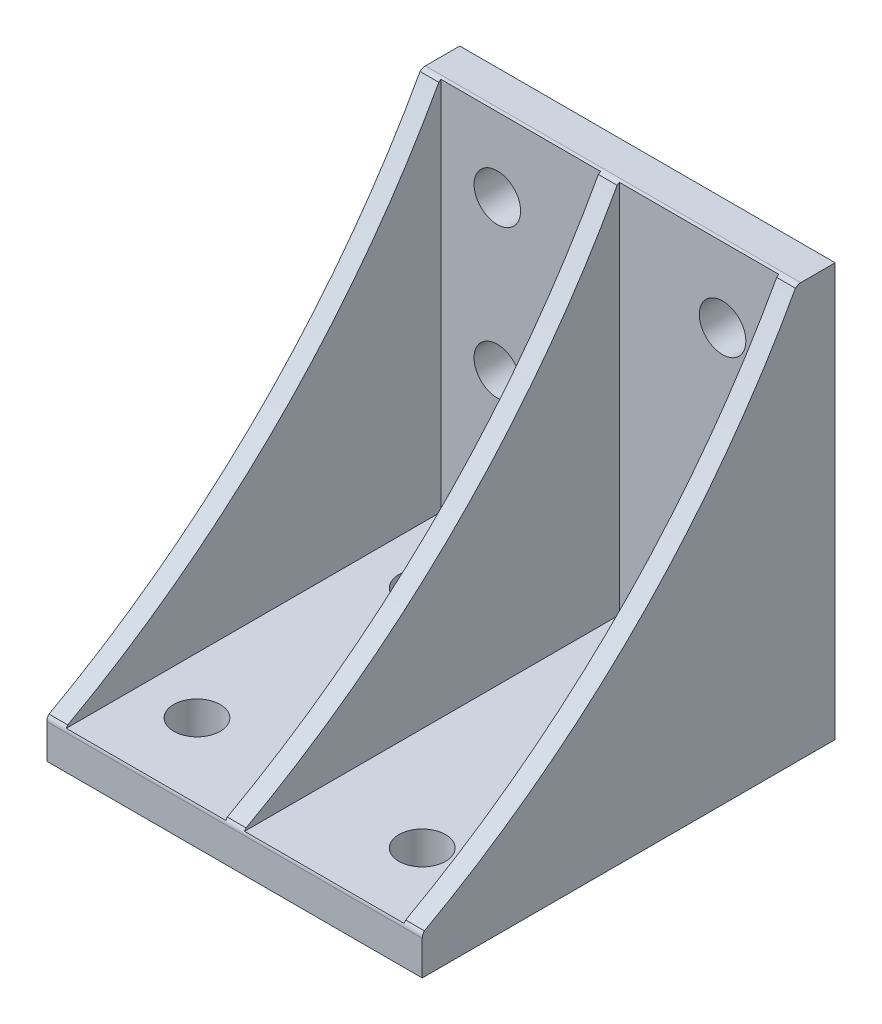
ISO-10303-21;
HEADER;
FILE_DESCRIPTION(('STEP AP214'),'2;1');
FILE_NAME('part.step','',(''),(''),'','','');
FILE_SCHEMA(('AUTOMOTIVE_DESIGN { 1 0 10303 214 1 1 1 1 }'));
ENDSEC;
DATA;
#1=APPLICATION_CONTEXT('core data for automotive mechanical design processes');
#2=APPLICATION_PROTOCOL_DEFINITION('international standard','automotive_design',2000,#1);
#3=PRODUCT_CONTEXT('',#1,'mechanical');
#4=PRODUCT('Part','Part','',(#3));
#5=PRODUCT_RELATED_PRODUCT_CATEGORY('part','',(#4));
#6=PRODUCT_DEFINITION_FORMATION('','',#4);
#7=PRODUCT_DEFINITION_CONTEXT('part definition',#1,'design');
#8=PRODUCT_DEFINITION('design','',#6,#7);
#9=PRODUCT_DEFINITION_SHAPE('','',#8);
#10=(LENGTH_UNIT() NAMED_UNIT(*) SI_UNIT(.MILLI.,.METRE.));
#11=(NAMED_UNIT(*) PLANE_ANGLE_UNIT() SI_UNIT($,.RADIAN.));
#12=(NAMED_UNIT(*) SI_UNIT($,.STERADIAN.) SOLID_ANGLE_UNIT());
#13=UNCERTAINTY_MEASURE_WITH_UNIT(LENGTH_MEASURE(1.E-05),#10,'distance_accuracy_value','');
#14=(GEOMETRIC_REPRESENTATION_CONTEXT(3) GLOBAL_UNCERTAINTY_ASSIGNED_CONTEXT((#13)) GLOBAL_UNIT_ASSIGNED_CONTEXT((#10,
#11,#12)) REPRESENTATION_CONTEXT('',''));
#15=CARTESIAN_POINT('',(0.,0.,0.));
#16=DIRECTION('',(0.,0.,1.));
#17=DIRECTION('',(1.,0.,0.));
#18=AXIS2_PLACEMENT_3D('',#15,#16,#17);
#19=CARTESIAN_POINT('',(-22.5,5.,5.));
#20=DIRECTION('',(0.,0.,-1.));
#21=DIRECTION('',(-1.,0.,0.));
#22=AXIS2_PLACEMENT_3D('',#19,#20,#21);
#23=PLANE('',#22);
#24=CARTESIAN_POINT('',(-15.,45.,5.));
#25=DIRECTION('',(0.,0.,1.));
#26=DIRECTION('',(1.,0.,0.));
#27=AXIS2_PLACEMENT_3D('',#24,#25,#26);
#28=CIRCLE('',#27,3.1);
#29=CARTESIAN_POINT('',(-11.9,45.,5.));
#30=VERTEX_POINT('',#29);
#31=EDGE_CURVE('E1829',#30,#30,#28,.T.);
#32=ORIENTED_EDGE('',*,*,#31,.F.);
#33=EDGE_LOOP('',(#32));
#34=FACE_BOUND('',#33,.T.);
#35=CARTESIAN_POINT('',(-15.,25.,5.));
#36=DIRECTION('',(0.,0.,1.));
#37=DIRECTION('',(1.,0.,0.));
#38=AXIS2_PLACEMENT_3D('',#35,#36,#37);
#39=CIRCLE('',#38,3.1);
#40=CARTESIAN_POINT('',(-11.9,25.,5.));
#41=VERTEX_POINT('',#40);
#42=EDGE_CURVE('E1832',#41,#41,#39,.T.);
#43=ORIENTED_EDGE('',*,*,#42,.F.);
#44=EDGE_LOOP('',(#43));
#45=FACE_BOUND('',#44,.T.);
#46=DIRECTION('',(0.,-1.,0.));
#47=VECTOR('',#46,1.);
#48=CARTESIAN_POINT('',(-1.25,5.,5.));
#49=LINE('',#48,#47);
#50=CARTESIAN_POINT('',(-1.25,54.9101797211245,5.));
#51=VERTEX_POINT('',#50);
#52=CARTESIAN_POINT('',(-1.25,5.,5.));
#53=VERTEX_POINT('',#52);
#54=EDGE_CURVE('E1895',#51,#53,#49,.T.);
#55=ORIENTED_EDGE('',*,*,#54,.F.);
#56=DIRECTION('',(-1.,0.,0.));
#57=VECTOR('',#56,1.);
#58=CARTESIAN_POINT('',(25.,54.9101797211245,5.));
#59=LINE('',#58,#57);
#60=CARTESIAN_POINT('',(-22.5,54.9101797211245,5.));
#61=VERTEX_POINT('',#60);
#62=EDGE_CURVE('E1965',#61,#51,#59,.F.);
#63=ORIENTED_EDGE('',*,*,#62,.F.);
#64=DIRECTION('',(0.,1.,0.));
#65=VECTOR('',#64,1.);
#66=CARTESIAN_POINT('',(-22.5,5.,5.));
#67=LINE('',#66,#65);
#68=CARTESIAN_POINT('',(-22.5,5.,5.));
#69=VERTEX_POINT('',#68);
#70=EDGE_CURVE('E1908',#69,#61,#67,.T.);
#71=ORIENTED_EDGE('',*,*,#70,.F.);
#72=DIRECTION('',(1.,0.,0.));
#73=VECTOR('',#72,1.);
#74=CARTESIAN_POINT('',(-22.5,5.,5.));
#75=LINE('',#74,#73);
#76=EDGE_CURVE('E1912',#69,#53,#75,.T.);
#77=ORIENTED_EDGE('',*,*,#76,.T.);
#78=EDGE_LOOP('',(#55,#63,#71,#77));
#79=FACE_BOUND('',#78,.T.);
#80=ADVANCED_FACE('F16',(#34,#45,#79),#23,.F.);
#81=CARTESIAN_POINT('',(-22.5,5.,60.));
#82=DIRECTION('',(0.,-1.,0.));
#83=DIRECTION('',(0.,0.,-1.));
#84=AXIS2_PLACEMENT_3D('',#81,#82,#83);
#85=PLANE('',#84);
#86=CARTESIAN_POINT('',(-15.,5.,45.));
#87=DIRECTION('',(0.,1.,0.));
#88=DIRECTION('',(0.,0.,1.));
#89=AXIS2_PLACEMENT_3D('',#86,#87,#88);
#90=CIRCLE('',#89,3.1);
#91=CARTESIAN_POINT('',(-15.,5.,48.1));
#92=VERTEX_POINT('',#91);
#93=EDGE_CURVE('E1850',#92,#92,#90,.T.);
#94=ORIENTED_EDGE('',*,*,#93,.F.);
#95=EDGE_LOOP('',(#94));
#96=FACE_BOUND('',#95,.T.);
#97=CARTESIAN_POINT('',(-15.,5.,15.));
#98=DIRECTION('',(0.,1.,0.));
#99=DIRECTION('',(0.,0.,1.));
#100=AXIS2_PLACEMENT_3D('',#97,#98,#99);
#101=CIRCLE('',#100,3.1);
#102=CARTESIAN_POINT('',(-15.,5.,18.1));
#103=VERTEX_POINT('',#102);
#104=EDGE_CURVE('E1857',#103,#103,#101,.T.);
#105=ORIENTED_EDGE('',*,*,#104,.F.);
#106=EDGE_LOOP('',(#105));
#107=FACE_BOUND('',#106,.T.);
#108=DIRECTION('',(0.,0.,1.));
#109=VECTOR('',#108,1.);
#110=CARTESIAN_POINT('',(-1.25,5.,60.));
#111=LINE('',#110,#109);
#112=CARTESIAN_POINT('',(-1.25,5.,54.9101797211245));
#113=VERTEX_POINT('',#112);
#114=EDGE_CURVE('E1968',#53,#113,#111,.T.);
#115=ORIENTED_EDGE('',*,*,#114,.F.);
#116=ORIENTED_EDGE('',*,*,#76,.F.);
#117=DIRECTION('',(0.,0.,-1.));
#118=VECTOR('',#117,1.);
#119=CARTESIAN_POINT('',(-22.5,5.,60.));
#120=LINE('',#119,#118);
#121=CARTESIAN_POINT('',(-22.5,5.,54.9101797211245));
#122=VERTEX_POINT('',#121);
#123=EDGE_CURVE('E1906',#122,#69,#120,.T.);
#124=ORIENTED_EDGE('',*,*,#123,.F.);
#125=DIRECTION('',(-1.,0.,0.));
#126=VECTOR('',#125,1.);
#127=CARTESIAN_POINT('',(25.,5.,54.9101797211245));
#128=LINE('',#127,#126);
#129=EDGE_CURVE('E1957',#113,#122,#128,.T.);
#130=ORIENTED_EDGE('',*,*,#129,.F.);
#131=EDGE_LOOP('',(#115,#116,#124,#130));
#132=FACE_BOUND('',#131,.T.);
#133=ADVANCED_FACE('F2091',(#96,#107,#132),#85,.F.);
#134=CARTESIAN_POINT('',(25.,54.,4.58578643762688));
#135=DIRECTION('',(-1.,0.,0.));
#136=DIRECTION('',(0.,0.,1.));
#137=AXIS2_PLACEMENT_3D('',#134,#135,#136);
#138=CYLINDRICAL_SURFACE('',#137,1.00000000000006);
#139=DIRECTION('',(-1.,0.,0.));
#140=VECTOR('',#139,1.);
#141=CARTESIAN_POINT('',(25.,55.,4.5857864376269));
#142=LINE('',#141,#140);
#143=CARTESIAN_POINT('',(25.,55.,4.5857864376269));
#144=VERTEX_POINT('',#143);
#145=CARTESIAN_POINT('',(-25.,55.,4.5857864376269));
#146=VERTEX_POINT('',#145);
#147=EDGE_CURVE('E1951',#144,#146,#142,.T.);
#148=ORIENTED_EDGE('',*,*,#147,.T.);
#149=CARTESIAN_POINT('',(-25.,54.,4.58578643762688));
#150=DIRECTION('',(1.,0.,0.));
#151=DIRECTION('',(0.,0.,-1.));
#152=AXIS2_PLACEMENT_3D('',#149,#150,#151);
#153=CIRCLE('',#152,1.00000000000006);
#154=CARTESIAN_POINT('',(-25.,54.7071067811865,5.29289321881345));
#155=VERTEX_POINT('',#154);
#156=EDGE_CURVE('E1926',#146,#155,#153,.T.);
#157=ORIENTED_EDGE('',*,*,#156,.T.);
#158=DIRECTION('',(-1.,0.,0.));
#159=VECTOR('',#158,1.);
#160=CARTESIAN_POINT('',(25.,54.7071067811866,5.29289321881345));
#161=LINE('',#160,#159);
#162=CARTESIAN_POINT('',(-22.5,54.7071067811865,5.29289321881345));
#163=VERTEX_POINT('',#162);
#164=EDGE_CURVE('E1948',#163,#155,#161,.T.);
#165=ORIENTED_EDGE('',*,*,#164,.F.);
#166=CARTESIAN_POINT('',(-22.5,54.,4.58578643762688));
#167=DIRECTION('',(1.,0.,0.));
#168=DIRECTION('',(0.,0.,-1.));
#169=AXIS2_PLACEMENT_3D('',#166,#167,#168);
#170=CIRCLE('',#169,1.00000000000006);
#171=EDGE_CURVE('E1918',#61,#163,#170,.T.);
#172=ORIENTED_EDGE('',*,*,#171,.F.);
#173=ORIENTED_EDGE('',*,*,#62,.T.);
#174=CARTESIAN_POINT('',(-1.25,54.,4.58578643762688));
#175=DIRECTION('',(1.,0.,0.));
#176=DIRECTION('',(0.,0.,-1.));
#177=AXIS2_PLACEMENT_3D('',#174,#175,#176);
#178=CIRCLE('',#177,1.00000000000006);
#179=CARTESIAN_POINT('',(-1.25,54.7071067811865,5.29289321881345));
#180=VERTEX_POINT('',#179);
#181=EDGE_CURVE('E1878',#51,#180,#178,.T.);
#182=ORIENTED_EDGE('',*,*,#181,.T.);
#183=DIRECTION('',(-1.,0.,0.));
#184=VECTOR('',#183,1.);
#185=CARTESIAN_POINT('',(1.25,54.7071067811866,5.29289321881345));
#186=LINE('',#185,#184);
#187=CARTESIAN_POINT('',(1.25,54.7071067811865,5.29289321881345));
#188=VERTEX_POINT('',#187);
#189=EDGE_CURVE('E1893',#188,#180,#186,.T.);
#190=ORIENTED_EDGE('',*,*,#189,.F.);
#191=CARTESIAN_POINT('',(1.25,54.,4.58578643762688));
#192=DIRECTION('',(1.,0.,0.));
#193=DIRECTION('',(0.,0.,-1.));
#194=AXIS2_PLACEMENT_3D('',#191,#192,#193);
#195=CIRCLE('',#194,1.00000000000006);
#196=CARTESIAN_POINT('',(1.25,54.9101797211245,5.));
#197=VERTEX_POINT('',#196);
#198=EDGE_CURVE('E1884',#197,#188,#195,.T.);
#199=ORIENTED_EDGE('',*,*,#198,.F.);
#200=CARTESIAN_POINT('',(22.5,54.9101797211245,5.));
#201=VERTEX_POINT('',#200);
#202=EDGE_CURVE('E1964',#197,#201,#59,.F.);
#203=ORIENTED_EDGE('',*,*,#202,.T.);
#204=CARTESIAN_POINT('',(22.5,54.,4.58578643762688));
#205=DIRECTION('',(1.,0.,0.));
#206=DIRECTION('',(0.,0.,-1.));
#207=AXIS2_PLACEMENT_3D('',#204,#205,#206);
#208=CIRCLE('',#207,1.00000000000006);
#209=CARTESIAN_POINT('',(22.5,54.7071067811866,5.29289321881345));
#210=VERTEX_POINT('',#209);
#211=EDGE_CURVE('E1915',#201,#210,#208,.T.);
#212=ORIENTED_EDGE('',*,*,#211,.T.);
#213=CARTESIAN_POINT('',(25.,54.7071067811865,5.29289321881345));
#214=VERTEX_POINT('',#213);
#215=EDGE_CURVE('E1949',#214,#210,#161,.T.);
#216=ORIENTED_EDGE('',*,*,#215,.F.);
#217=CARTESIAN_POINT('',(25.,54.,4.58578643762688));
#218=DIRECTION('',(1.,0.,0.));
#219=DIRECTION('',(0.,0.,-1.));
#220=AXIS2_PLACEMENT_3D('',#217,#218,#219);
#221=CIRCLE('',#220,1.00000000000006);
#222=EDGE_CURVE('E1937',#144,#214,#221,.T.);
#223=ORIENTED_EDGE('',*,*,#222,.F.);
#224=EDGE_LOOP('',(#148,#157,#165,#172,#173,#182,#190,#199,#203,#212,#216,#223));
#225=FACE_BOUND('',#224,.T.);
#226=ADVANCED_FACE('F2099',(#225),#138,.T.);
#227=CARTESIAN_POINT('',(25.,4.58578643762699,54.));
#228=DIRECTION('',(-1.,0.,0.));
#229=DIRECTION('',(0.,0.,1.));
#230=AXIS2_PLACEMENT_3D('',#227,#228,#229);
#231=CYLINDRICAL_SURFACE('',#230,0.999999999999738);
#232=CARTESIAN_POINT('',(22.5,5.,54.9101797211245));
#233=VERTEX_POINT('',#232);
#234=CARTESIAN_POINT('',(1.25,5.,54.9101797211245));
#235=VERTEX_POINT('',#234);
#236=EDGE_CURVE('E1958',#233,#235,#128,.T.);
#237=ORIENTED_EDGE('',*,*,#236,.T.);
#238=CARTESIAN_POINT('',(1.25,4.58578643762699,54.));
#239=DIRECTION('',(1.,0.,0.));
#240=DIRECTION('',(0.,0.,-1.));
#241=AXIS2_PLACEMENT_3D('',#238,#239,#240);
#242=CIRCLE('',#241,0.999999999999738);
#243=CARTESIAN_POINT('',(1.25,5.29289321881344,54.7071067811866));
#244=VERTEX_POINT('',#243);
#245=EDGE_CURVE('E1887',#244,#235,#242,.T.);
#246=ORIENTED_EDGE('',*,*,#245,.F.);
#247=DIRECTION('',(-1.,0.,0.));
#248=VECTOR('',#247,1.);
#249=CARTESIAN_POINT('',(1.25,5.29289321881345,54.7071067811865));
#250=LINE('',#249,#248);
#251=CARTESIAN_POINT('',(-1.25,5.29289321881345,54.7071067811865));
#252=VERTEX_POINT('',#251);
#253=EDGE_CURVE('E1890',#244,#252,#250,.T.);
#254=ORIENTED_EDGE('',*,*,#253,.T.);
#255=CARTESIAN_POINT('',(-1.25,4.58578643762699,54.));
#256=DIRECTION('',(1.,0.,0.));
#257=DIRECTION('',(0.,0.,-1.));
#258=AXIS2_PLACEMENT_3D('',#255,#256,#257);
#259=CIRCLE('',#258,0.999999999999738);
#260=EDGE_CURVE('E1881',#252,#113,#259,.T.);
#261=ORIENTED_EDGE('',*,*,#260,.T.);
#262=ORIENTED_EDGE('',*,*,#129,.T.);
#263=CARTESIAN_POINT('',(-22.5,4.58578643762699,54.));
#264=DIRECTION('',(1.,0.,0.));
#265=DIRECTION('',(0.,0.,-1.));
#266=AXIS2_PLACEMENT_3D('',#263,#264,#265);
#267=CIRCLE('',#266,0.999999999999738);
#268=CARTESIAN_POINT('',(-22.5,5.29289321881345,54.7071067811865));
#269=VERTEX_POINT('',#268);
#270=EDGE_CURVE('E1961',#269,#122,#267,.T.);
#271=ORIENTED_EDGE('',*,*,#270,.F.);
#272=DIRECTION('',(-1.,0.,0.));
#273=VECTOR('',#272,1.);
#274=CARTESIAN_POINT('',(25.,5.29289321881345,54.7071067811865));
#275=LINE('',#274,#273);
#276=CARTESIAN_POINT('',(-25.,5.29289321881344,54.7071067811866));
#277=VERTEX_POINT('',#276);
#278=EDGE_CURVE('E1944',#269,#277,#275,.T.);
#279=ORIENTED_EDGE('',*,*,#278,.T.);
#280=CARTESIAN_POINT('',(-25.,4.58578643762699,54.));
#281=DIRECTION('',(1.,0.,0.));
#282=DIRECTION('',(0.,0.,-1.));
#283=AXIS2_PLACEMENT_3D('',#280,#281,#282);
#284=CIRCLE('',#283,0.999999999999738);
#285=CARTESIAN_POINT('',(-25.,4.58578643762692,55.));
#286=VERTEX_POINT('',#285);
#287=EDGE_CURVE('E1929',#277,#286,#284,.T.);
#288=ORIENTED_EDGE('',*,*,#287,.T.);
#289=DIRECTION('',(-1.,0.,0.));
#290=VECTOR('',#289,1.);
#291=CARTESIAN_POINT('',(25.,4.58578643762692,55.));
#292=LINE('',#291,#290);
#293=CARTESIAN_POINT('',(25.,4.58578643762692,55.));
#294=VERTEX_POINT('',#293);
#295=EDGE_CURVE('E1942',#294,#286,#292,.T.);
#296=ORIENTED_EDGE('',*,*,#295,.F.);
#297=CARTESIAN_POINT('',(25.,4.58578643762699,54.));
#298=DIRECTION('',(1.,0.,0.));
#299=DIRECTION('',(0.,0.,-1.));
#300=AXIS2_PLACEMENT_3D('',#297,#298,#299);
#301=CIRCLE('',#300,0.999999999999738);
#302=CARTESIAN_POINT('',(25.,5.29289321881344,54.7071067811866));
#303=VERTEX_POINT('',#302);
#304=EDGE_CURVE('E1940',#303,#294,#301,.T.);
#305=ORIENTED_EDGE('',*,*,#304,.F.);
#306=CARTESIAN_POINT('',(22.5,5.29289321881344,54.7071067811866));
#307=VERTEX_POINT('',#306);
#308=EDGE_CURVE('E1945',#303,#307,#275,.T.);
#309=ORIENTED_EDGE('',*,*,#308,.T.);
#310=CARTESIAN_POINT('',(22.5,4.58578643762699,54.));
#311=DIRECTION('',(1.,0.,0.));
#312=DIRECTION('',(0.,0.,-1.));
#313=AXIS2_PLACEMENT_3D('',#310,#311,#312);
#314=CIRCLE('',#313,0.999999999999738);
#315=EDGE_CURVE('E1954',#307,#233,#314,.T.);
#316=ORIENTED_EDGE('',*,*,#315,.T.);
#317=EDGE_LOOP('',(#237,#246,#254,#261,#262,#271,#279,#288,#296,#305,#309,#316));
#318=FACE_BOUND('',#317,.T.);
#319=ADVANCED_FACE('F2141',(#318),#231,.T.);
#320=CARTESIAN_POINT('',(25.,4.58578643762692,55.));
#321=DIRECTION('',(0.,0.,-1.));
#322=DIRECTION('',(-1.,0.,0.));
#323=AXIS2_PLACEMENT_3D('',#320,#321,#322);
#324=PLANE('',#323);
#325=DIRECTION('',(0.,-1.,0.));
#326=VECTOR('',#325,1.);
#327=CARTESIAN_POINT('',(-25.,4.58578643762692,55.));
#328=LINE('',#327,#326);
#329=CARTESIAN_POINT('',(-25.,0.,55.));
#330=VERTEX_POINT('',#329);
#331=EDGE_CURVE('E1921',#286,#330,#328,.T.);
#332=ORIENTED_EDGE('',*,*,#331,.T.);
#333=DIRECTION('',(1.,0.,0.));
#334=VECTOR('',#333,1.);
#335=CARTESIAN_POINT('',(-25.,0.,55.));
#336=LINE('',#335,#334);
#337=CARTESIAN_POINT('',(25.,0.,55.));
#338=VERTEX_POINT('',#337);
#339=EDGE_CURVE('E1808',#330,#338,#336,.T.);
#340=ORIENTED_EDGE('',*,*,#339,.T.);
#341=DIRECTION('',(0.,-1.,0.));
#342=VECTOR('',#341,1.);
#343=CARTESIAN_POINT('',(25.,4.58578643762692,55.));
#344=LINE('',#343,#342);
#345=EDGE_CURVE('E1932',#294,#338,#344,.T.);
#346=ORIENTED_EDGE('',*,*,#345,.F.);
#347=ORIENTED_EDGE('',*,*,#295,.T.);
#348=EDGE_LOOP('',(#332,#340,#346,#347));
#349=FACE_BOUND('',#348,.T.);
#350=ADVANCED_FACE('F18',(#349),#324,.F.);
#351=CARTESIAN_POINT('',(25.,55.,0.));
#352=DIRECTION('',(0.,-1.,0.));
#353=DIRECTION('',(0.,0.,-1.));
#354=AXIS2_PLACEMENT_3D('',#351,#352,#353);
#355=PLANE('',#354);
#356=DIRECTION('',(0.,0.,1.));
#357=VECTOR('',#356,1.);
#358=CARTESIAN_POINT('',(25.,55.,0.));
#359=LINE('',#358,#357);
#360=CARTESIAN_POINT('',(25.,55.,0.));
#361=VERTEX_POINT('',#360);
#362=EDGE_CURVE('E1935',#361,#144,#359,.T.);
#363=ORIENTED_EDGE('',*,*,#362,.F.);
#364=DIRECTION('',(-1.,0.,0.));
#365=VECTOR('',#364,1.);
#366=CARTESIAN_POINT('',(25.,55.,0.));
#367=LINE('',#366,#365);
#368=CARTESIAN_POINT('',(-25.,55.,0.));
#369=VERTEX_POINT('',#368);
#370=EDGE_CURVE('E1061',#361,#369,#367,.T.);
#371=ORIENTED_EDGE('',*,*,#370,.T.);
#372=DIRECTION('',(0.,0.,1.));
#373=VECTOR('',#372,1.);
#374=CARTESIAN_POINT('',(-25.,55.,0.));
#375=LINE('',#374,#373);
#376=EDGE_CURVE('E1924',#369,#146,#375,.T.);
#377=ORIENTED_EDGE('',*,*,#376,.T.);
#378=ORIENTED_EDGE('',*,*,#147,.F.);
#379=EDGE_LOOP('',(#363,#371,#377,#378));
#380=FACE_BOUND('',#379,.T.);
#381=ADVANCED_FACE('F2160',(#380),#355,.F.);
#382=CARTESIAN_POINT('',(25.,54.,4.58578643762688));
#383=DIRECTION('',(1.,0.,0.));
#384=DIRECTION('',(0.,0.,-1.));
#385=AXIS2_PLACEMENT_3D('',#382,#383,#384);
#386=PLANE('',#385);
#387=DIRECTION('',(0.,1.,0.));
#388=VECTOR('',#387,1.);
#389=CARTESIAN_POINT('',(25.,0.,0.));
#390=LINE('',#389,#388);
#391=CARTESIAN_POINT('',(25.,0.,0.));
#392=VERTEX_POINT('',#391);
#393=EDGE_CURVE('E1083',#392,#361,#390,.T.);
#394=ORIENTED_EDGE('',*,*,#393,.T.);
#395=ORIENTED_EDGE('',*,*,#362,.T.);
#396=ORIENTED_EDGE('',*,*,#222,.T.);
#397=CARTESIAN_POINT('',(25.,114.561644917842,114.561644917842));
#398=DIRECTION('',(1.,0.,0.));
#399=DIRECTION('',(0.,0.,-1.));
#400=AXIS2_PLACEMENT_3D('',#397,#398,#399);
#401=CIRCLE('',#400,124.588225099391);
#402=EDGE_CURVE('E1860',#303,#214,#401,.T.);
#403=ORIENTED_EDGE('',*,*,#402,.F.);
#404=ORIENTED_EDGE('',*,*,#304,.T.);
#405=ORIENTED_EDGE('',*,*,#345,.T.);
#406=DIRECTION('',(0.,0.,1.));
#407=VECTOR('',#406,1.);
#408=CARTESIAN_POINT('',(25.,0.,-0.8));
#409=LINE('',#408,#407);
#410=EDGE_CURVE('E1826',#392,#338,#409,.T.);
#411=ORIENTED_EDGE('',*,*,#410,.F.);
#412=EDGE_LOOP('',(#394,#395,#396,#403,#404,#405,#411));
#413=FACE_BOUND('',#412,.T.);
#414=ADVANCED_FACE('F2116',(#413),#386,.T.);
#415=CARTESIAN_POINT('',(-25.,54.,4.58578643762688));
#416=DIRECTION('',(1.,0.,0.));
#417=DIRECTION('',(0.,0.,-1.));
#418=AXIS2_PLACEMENT_3D('',#415,#416,#417);
#419=PLANE('',#418);
#420=ORIENTED_EDGE('',*,*,#376,.F.);
#421=DIRECTION('',(0.,-1.,0.));
#422=VECTOR('',#421,1.);
#423=CARTESIAN_POINT('',(-25.,55.,0.));
#424=LINE('',#423,#422);
#425=CARTESIAN_POINT('',(-25.,0.,0.));
#426=VERTEX_POINT('',#425);
#427=EDGE_CURVE('E1077',#369,#426,#424,.T.);
#428=ORIENTED_EDGE('',*,*,#427,.T.);
#429=DIRECTION('',(0.,0.,1.));
#430=VECTOR('',#429,1.);
#431=CARTESIAN_POINT('',(-25.,0.,-0.8));
#432=LINE('',#431,#430);
#433=EDGE_CURVE('E1821',#426,#330,#432,.T.);
#434=ORIENTED_EDGE('',*,*,#433,.T.);
#435=ORIENTED_EDGE('',*,*,#331,.F.);
#436=ORIENTED_EDGE('',*,*,#287,.F.);
#437=CARTESIAN_POINT('',(-25.,114.561644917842,114.561644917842));
#438=DIRECTION('',(1.,0.,0.));
#439=DIRECTION('',(0.,0.,-1.));
#440=AXIS2_PLACEMENT_3D('',#437,#438,#439);
#441=CIRCLE('',#440,124.588225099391);
#442=EDGE_CURVE('E1865',#277,#155,#441,.T.);
#443=ORIENTED_EDGE('',*,*,#442,.T.);
#444=ORIENTED_EDGE('',*,*,#156,.F.);
#445=EDGE_LOOP('',(#420,#428,#434,#435,#436,#443,#444));
#446=FACE_BOUND('',#445,.T.);
#447=ADVANCED_FACE('F2107',(#446),#419,.F.);
#448=CARTESIAN_POINT('',(15.,45.,5.));
#449=DIRECTION('',(0.,0.,1.));
#450=DIRECTION('',(1.,0.,0.));
#451=AXIS2_PLACEMENT_3D('',#448,#449,#450);
#452=CIRCLE('',#451,3.1);
#453=CARTESIAN_POINT('',(18.1,45.,5.));
#454=VERTEX_POINT('',#453);
#455=EDGE_CURVE('E1822',#454,#454,#452,.T.);
#456=ORIENTED_EDGE('',*,*,#455,.F.);
#457=EDGE_LOOP('',(#456));
#458=FACE_BOUND('',#457,.T.);
#459=CARTESIAN_POINT('',(15.,25.,5.));
#460=DIRECTION('',(0.,0.,1.));
#461=DIRECTION('',(1.,0.,0.));
#462=AXIS2_PLACEMENT_3D('',#459,#460,#461);
#463=CIRCLE('',#462,3.1);
#464=CARTESIAN_POINT('',(18.1,25.,5.));
#465=VERTEX_POINT('',#464);
#466=EDGE_CURVE('E1825',#465,#465,#463,.T.);
#467=ORIENTED_EDGE('',*,*,#466,.F.);
#468=EDGE_LOOP('',(#467));
#469=FACE_BOUND('',#468,.T.);
#470=ORIENTED_EDGE('',*,*,#202,.F.);
#471=DIRECTION('',(0.,-1.,0.));
#472=VECTOR('',#471,1.);
#473=CARTESIAN_POINT('',(1.25,5.,5.));
#474=LINE('',#473,#472);
#475=CARTESIAN_POINT('',(1.25,5.,5.));
#476=VERTEX_POINT('',#475);
#477=EDGE_CURVE('E1898',#197,#476,#474,.T.);
#478=ORIENTED_EDGE('',*,*,#477,.T.);
#479=CARTESIAN_POINT('',(22.5,5.,5.));
#480=VERTEX_POINT('',#479);
#481=EDGE_CURVE('E1911',#476,#480,#75,.T.);
#482=ORIENTED_EDGE('',*,*,#481,.T.);
#483=DIRECTION('',(0.,1.,0.));
#484=VECTOR('',#483,1.);
#485=CARTESIAN_POINT('',(22.5,5.,5.));
#486=LINE('',#485,#484);
#487=EDGE_CURVE('E1903',#480,#201,#486,.T.);
#488=ORIENTED_EDGE('',*,*,#487,.T.);
#489=EDGE_LOOP('',(#470,#478,#482,#488));
#490=FACE_BOUND('',#489,.T.);
#491=ADVANCED_FACE('F2094',(#458,#469,#490),#23,.F.);
#492=CARTESIAN_POINT('',(15.,5.,45.));
#493=DIRECTION('',(0.,1.,0.));
#494=DIRECTION('',(0.,0.,1.));
#495=AXIS2_PLACEMENT_3D('',#492,#493,#494);
#496=CIRCLE('',#495,3.1);
#497=CARTESIAN_POINT('',(15.,5.,48.1));
#498=VERTEX_POINT('',#497);
#499=EDGE_CURVE('E1836',#498,#498,#496,.T.);
#500=ORIENTED_EDGE('',*,*,#499,.F.);
#501=EDGE_LOOP('',(#500));
#502=FACE_BOUND('',#501,.T.);
#503=CARTESIAN_POINT('',(15.,5.,15.));
#504=DIRECTION('',(0.,1.,0.));
#505=DIRECTION('',(0.,0.,1.));
#506=AXIS2_PLACEMENT_3D('',#503,#504,#505);
#507=CIRCLE('',#506,3.1);
#508=CARTESIAN_POINT('',(15.,5.,18.1));
#509=VERTEX_POINT('',#508);
#510=EDGE_CURVE('E1843',#509,#509,#507,.T.);
#511=ORIENTED_EDGE('',*,*,#510,.F.);
#512=EDGE_LOOP('',(#511));
#513=FACE_BOUND('',#512,.T.);
#514=ORIENTED_EDGE('',*,*,#481,.F.);
#515=DIRECTION('',(0.,0.,1.));
#516=VECTOR('',#515,1.);
#517=CARTESIAN_POINT('',(1.25,5.,60.));
#518=LINE('',#517,#516);
#519=EDGE_CURVE('E1971',#476,#235,#518,.T.);
#520=ORIENTED_EDGE('',*,*,#519,.T.);
#521=ORIENTED_EDGE('',*,*,#236,.F.);
#522=DIRECTION('',(0.,0.,-1.));
#523=VECTOR('',#522,1.);
#524=CARTESIAN_POINT('',(22.5,5.,60.));
#525=LINE('',#524,#523);
#526=EDGE_CURVE('E1900',#233,#480,#525,.T.);
#527=ORIENTED_EDGE('',*,*,#526,.T.);
#528=EDGE_LOOP('',(#514,#520,#521,#527));
#529=FACE_BOUND('',#528,.T.);
#530=ADVANCED_FACE('F2102',(#502,#513,#529),#85,.F.);
#531=CARTESIAN_POINT('',(-22.5,0.,0.));
#532=DIRECTION('',(1.,0.,0.));
#533=DIRECTION('',(0.,0.,-1.));
#534=AXIS2_PLACEMENT_3D('',#531,#532,#533);
#535=PLANE('',#534);
#536=CARTESIAN_POINT('',(-22.5,114.561644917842,114.561644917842));
#537=DIRECTION('',(1.,0.,0.));
#538=DIRECTION('',(0.,0.,-1.));
#539=AXIS2_PLACEMENT_3D('',#536,#537,#538);
#540=CIRCLE('',#539,124.588225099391);
#541=EDGE_CURVE('E1876',#269,#163,#540,.T.);
#542=ORIENTED_EDGE('',*,*,#541,.F.);
#543=ORIENTED_EDGE('',*,*,#270,.T.);
#544=ORIENTED_EDGE('',*,*,#123,.T.);
#545=ORIENTED_EDGE('',*,*,#70,.T.);
#546=ORIENTED_EDGE('',*,*,#171,.T.);
#547=EDGE_LOOP('',(#542,#543,#544,#545,#546));
#548=FACE_BOUND('',#547,.T.);
#549=ADVANCED_FACE('F2114',(#548),#535,.T.);
#550=CARTESIAN_POINT('',(22.5,0.,0.));
#551=DIRECTION('',(1.,0.,0.));
#552=DIRECTION('',(0.,0.,-1.));
#553=AXIS2_PLACEMENT_3D('',#550,#551,#552);
#554=PLANE('',#553);
#555=ORIENTED_EDGE('',*,*,#315,.F.);
#556=CARTESIAN_POINT('',(22.5,114.561644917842,114.561644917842));
#557=DIRECTION('',(1.,0.,0.));
#558=DIRECTION('',(0.,0.,-1.));
#559=AXIS2_PLACEMENT_3D('',#556,#557,#558);
#560=CIRCLE('',#559,124.588225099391);
#561=EDGE_CURVE('E1873',#307,#210,#560,.T.);
#562=ORIENTED_EDGE('',*,*,#561,.T.);
#563=ORIENTED_EDGE('',*,*,#211,.F.);
#564=ORIENTED_EDGE('',*,*,#487,.F.);
#565=ORIENTED_EDGE('',*,*,#526,.F.);
#566=EDGE_LOOP('',(#555,#562,#563,#564,#565));
#567=FACE_BOUND('',#566,.T.);
#568=ADVANCED_FACE('F2148',(#567),#554,.F.);
#569=CARTESIAN_POINT('',(1.25,54.,4.58578643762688));
#570=DIRECTION('',(1.,0.,0.));
#571=DIRECTION('',(0.,0.,-1.));
#572=AXIS2_PLACEMENT_3D('',#569,#570,#571);
#573=PLANE('',#572);
#574=CARTESIAN_POINT('',(1.25,114.561644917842,114.561644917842));
#575=DIRECTION('',(1.,0.,0.));
#576=DIRECTION('',(0.,0.,-1.));
#577=AXIS2_PLACEMENT_3D('',#574,#575,#576);
#578=CIRCLE('',#577,124.588225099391);
#579=EDGE_CURVE('E1871',#244,#188,#578,.T.);
#580=ORIENTED_EDGE('',*,*,#579,.F.);
#581=ORIENTED_EDGE('',*,*,#245,.T.);
#582=ORIENTED_EDGE('',*,*,#519,.F.);
#583=ORIENTED_EDGE('',*,*,#477,.F.);
#584=ORIENTED_EDGE('',*,*,#198,.T.);
#585=EDGE_LOOP('',(#580,#581,#582,#583,#584));
#586=FACE_BOUND('',#585,.T.);
#587=ADVANCED_FACE('F2132',(#586),#573,.T.);
#588=CARTESIAN_POINT('',(-1.25,54.,4.58578643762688));
#589=DIRECTION('',(1.,0.,0.));
#590=DIRECTION('',(0.,0.,-1.));
#591=AXIS2_PLACEMENT_3D('',#588,#589,#590);
#592=PLANE('',#591);
#593=ORIENTED_EDGE('',*,*,#260,.F.);
#594=CARTESIAN_POINT('',(-1.25,114.561644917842,114.561644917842));
#595=DIRECTION('',(1.,0.,0.));
#596=DIRECTION('',(0.,0.,-1.));
#597=AXIS2_PLACEMENT_3D('',#594,#595,#596);
#598=CIRCLE('',#597,124.588225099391);
#599=EDGE_CURVE('E1868',#252,#180,#598,.T.);
#600=ORIENTED_EDGE('',*,*,#599,.T.);
#601=ORIENTED_EDGE('',*,*,#181,.F.);
#602=ORIENTED_EDGE('',*,*,#54,.T.);
#603=ORIENTED_EDGE('',*,*,#114,.T.);
#604=EDGE_LOOP('',(#593,#600,#601,#602,#603));
#605=FACE_BOUND('',#604,.T.);
#606=ADVANCED_FACE('F2139',(#605),#592,.F.);
#607=CARTESIAN_POINT('',(-25.,114.561644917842,114.561644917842));
#608=DIRECTION('',(1.,0.,0.));
#609=DIRECTION('',(0.,0.,-1.));
#610=AXIS2_PLACEMENT_3D('',#607,#608,#609);
#611=CYLINDRICAL_SURFACE('',#610,124.588225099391);
#612=ORIENTED_EDGE('',*,*,#579,.T.);
#613=ORIENTED_EDGE('',*,*,#189,.T.);
#614=ORIENTED_EDGE('',*,*,#599,.F.);
#615=ORIENTED_EDGE('',*,*,#253,.F.);
#616=EDGE_LOOP('',(#612,#613,#614,#615));
#617=FACE_BOUND('',#616,.T.);
#618=ADVANCED_FACE('F2136',(#617),#611,.F.);
#619=ORIENTED_EDGE('',*,*,#308,.F.);
#620=ORIENTED_EDGE('',*,*,#402,.T.);
#621=ORIENTED_EDGE('',*,*,#215,.T.);
#622=ORIENTED_EDGE('',*,*,#561,.F.);
#623=EDGE_LOOP('',(#619,#620,#621,#622));
#624=FACE_BOUND('',#623,.T.);
#625=ADVANCED_FACE('F2152',(#624),#611,.F.);
#626=ORIENTED_EDGE('',*,*,#541,.T.);
#627=ORIENTED_EDGE('',*,*,#164,.T.);
#628=ORIENTED_EDGE('',*,*,#442,.F.);
#629=ORIENTED_EDGE('',*,*,#278,.F.);
#630=EDGE_LOOP('',(#626,#627,#628,#629));
#631=FACE_BOUND('',#630,.T.);
#632=ADVANCED_FACE('F2168',(#631),#611,.F.);
#633=CARTESIAN_POINT('',(-15.,5.,15.));
#634=DIRECTION('',(0.,-1.,0.));
#635=DIRECTION('',(0.,0.,-1.));
#636=AXIS2_PLACEMENT_3D('',#633,#634,#635);
#637=CYLINDRICAL_SURFACE('',#636,3.1);
#638=ORIENTED_EDGE('',*,*,#104,.T.);
#639=EDGE_LOOP('',(#638));
#640=FACE_BOUND('',#639,.T.);
#641=CARTESIAN_POINT('',(-15.,0.,15.));
#642=DIRECTION('',(0.,1.,0.));
#643=DIRECTION('',(0.,0.,1.));
#644=AXIS2_PLACEMENT_3D('',#641,#642,#643);
#645=CIRCLE('',#644,3.1);
#646=CARTESIAN_POINT('',(-11.9405882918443,0.,15.5));
#647=VERTEX_POINT('',#646);
#648=CARTESIAN_POINT('',(-11.9405882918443,0.,14.5));
#649=VERTEX_POINT('',#648);
#650=EDGE_CURVE('E1861',#647,#649,#645,.T.);
#651=ORIENTED_EDGE('',*,*,#650,.F.);
#652=DIRECTION('',(0.,1.,0.));
#653=VECTOR('',#652,1.);
#654=CARTESIAN_POINT('',(-11.9405882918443,-0.8,15.5));
#655=LINE('',#654,#653);
#656=CARTESIAN_POINT('',(-11.9405882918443,-0.8,15.5));
#657=VERTEX_POINT('',#656);
#658=EDGE_CURVE('E1404',#657,#647,#655,.T.);
#659=ORIENTED_EDGE('',*,*,#658,.F.);
#660=CARTESIAN_POINT('',(-15.,-0.8,15.));
#661=DIRECTION('',(0.,-1.,0.));
#662=DIRECTION('',(0.,0.,-1.));
#663=AXIS2_PLACEMENT_3D('',#660,#661,#662);
#664=CIRCLE('',#663,3.1);
#665=CARTESIAN_POINT('',(-14.5,-0.8,18.0594117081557));
#666=VERTEX_POINT('',#665);
#667=EDGE_CURVE('E1384',#657,#666,#664,.T.);
#668=ORIENTED_EDGE('',*,*,#667,.T.);
#669=DIRECTION('',(0.,1.,0.));
#670=VECTOR('',#669,1.);
#671=CARTESIAN_POINT('',(-14.5,-0.8,18.0594117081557));
#672=LINE('',#671,#670);
#673=CARTESIAN_POINT('',(-14.5,0.,18.0594117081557));
#674=VERTEX_POINT('',#673);
#675=EDGE_CURVE('E1400',#666,#674,#672,.T.);
#676=ORIENTED_EDGE('',*,*,#675,.T.);
#677=CARTESIAN_POINT('',(-15.5,0.,18.0594117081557));
#678=VERTEX_POINT('',#677);
#679=EDGE_CURVE('E1853',#678,#674,#645,.T.);
#680=ORIENTED_EDGE('',*,*,#679,.F.);
#681=DIRECTION('',(0.,1.,0.));
#682=VECTOR('',#681,1.);
#683=CARTESIAN_POINT('',(-15.5,-0.8,18.0594117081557));
#684=LINE('',#683,#682);
#685=CARTESIAN_POINT('',(-15.5,-0.8,18.0594117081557));
#686=VERTEX_POINT('',#685);
#687=EDGE_CURVE('E1183',#686,#678,#684,.T.);
#688=ORIENTED_EDGE('',*,*,#687,.F.);
#689=CARTESIAN_POINT('',(-15.,-0.8,15.));
#690=DIRECTION('',(0.,-1.,0.));
#691=DIRECTION('',(0.,0.,-1.));
#692=AXIS2_PLACEMENT_3D('',#689,#690,#691);
#693=CIRCLE('',#692,3.1);
#694=CARTESIAN_POINT('',(-18.0594117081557,-0.8,15.5));
#695=VERTEX_POINT('',#694);
#696=EDGE_CURVE('E1153',#686,#695,#693,.T.);
#697=ORIENTED_EDGE('',*,*,#696,.T.);
#698=DIRECTION('',(0.,1.,0.));
#699=VECTOR('',#698,1.);
#700=CARTESIAN_POINT('',(-18.0594117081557,-0.8,15.5));
#701=LINE('',#700,#699);
#702=CARTESIAN_POINT('',(-18.0594117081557,0.,15.5));
#703=VERTEX_POINT('',#702);
#704=EDGE_CURVE('E1180',#695,#703,#701,.T.);
#705=ORIENTED_EDGE('',*,*,#704,.T.);
#706=CARTESIAN_POINT('',(-18.0594117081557,0.,14.5));
#707=VERTEX_POINT('',#706);
#708=EDGE_CURVE('E1863',#707,#703,#645,.T.);
#709=ORIENTED_EDGE('',*,*,#708,.F.);
#710=DIRECTION('',(0.,1.,0.));
#711=VECTOR('',#710,1.);
#712=CARTESIAN_POINT('',(-18.0594117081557,-0.8,14.5));
#713=LINE('',#712,#711);
#714=CARTESIAN_POINT('',(-18.0594117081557,-0.8,14.5));
#715=VERTEX_POINT('',#714);
#716=EDGE_CURVE('E1140',#715,#707,#713,.T.);
#717=ORIENTED_EDGE('',*,*,#716,.F.);
#718=CARTESIAN_POINT('',(-15.,-0.8,15.));
#719=DIRECTION('',(0.,-1.,0.));
#720=DIRECTION('',(0.,0.,-1.));
#721=AXIS2_PLACEMENT_3D('',#718,#719,#720);
#722=CIRCLE('',#721,3.1);
#723=CARTESIAN_POINT('',(-15.5,-0.8,11.9405882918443));
#724=VERTEX_POINT('',#723);
#725=EDGE_CURVE('E1105',#715,#724,#722,.T.);
#726=ORIENTED_EDGE('',*,*,#725,.T.);
#727=DIRECTION('',(0.,1.,0.));
#728=VECTOR('',#727,1.);
#729=CARTESIAN_POINT('',(-15.5,-0.8,11.9405882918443));
#730=LINE('',#729,#728);
#731=CARTESIAN_POINT('',(-15.5,0.,11.9405882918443));
#732=VERTEX_POINT('',#731);
#733=EDGE_CURVE('E1137',#724,#732,#730,.T.);
#734=ORIENTED_EDGE('',*,*,#733,.T.);
#735=CARTESIAN_POINT('',(-14.5,0.,11.9405882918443));
#736=VERTEX_POINT('',#735);
#737=EDGE_CURVE('E4166',#736,#732,#645,.T.);
#738=ORIENTED_EDGE('',*,*,#737,.F.);
#739=DIRECTION('',(0.,1.,0.));
#740=VECTOR('',#739,1.);
#741=CARTESIAN_POINT('',(-14.5,-0.8,11.9405882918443));
#742=LINE('',#741,#740);
#743=CARTESIAN_POINT('',(-14.5,-0.8,11.9405882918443));
#744=VERTEX_POINT('',#743);
#745=EDGE_CURVE('E1320',#744,#736,#742,.T.);
#746=ORIENTED_EDGE('',*,*,#745,.F.);
#747=CARTESIAN_POINT('',(-15.,-0.8,15.));
#748=DIRECTION('',(0.,-1.,0.));
#749=DIRECTION('',(0.,0.,-1.));
#750=AXIS2_PLACEMENT_3D('',#747,#748,#749);
#751=CIRCLE('',#750,3.1);
#752=CARTESIAN_POINT('',(-11.9405882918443,-0.8,14.5));
#753=VERTEX_POINT('',#752);
#754=EDGE_CURVE('E1285',#744,#753,#751,.T.);
#755=ORIENTED_EDGE('',*,*,#754,.T.);
#756=DIRECTION('',(0.,1.,0.));
#757=VECTOR('',#756,1.);
#758=CARTESIAN_POINT('',(-11.9405882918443,-0.8,14.5));
#759=LINE('',#758,#757);
#760=EDGE_CURVE('E1317',#753,#649,#759,.T.);
#761=ORIENTED_EDGE('',*,*,#760,.T.);
#762=EDGE_LOOP('',(#651,#659,#668,#676,#680,#688,#697,#705,#709,#717,#726,#734,#738,#746,#755,#761));
#763=FACE_BOUND('',#762,.T.);
#764=ADVANCED_FACE('F2191',(#640,#763),#637,.F.);
#765=CARTESIAN_POINT('',(-15.,5.,45.));
#766=DIRECTION('',(0.,-1.,0.));
#767=DIRECTION('',(0.,0.,-1.));
#768=AXIS2_PLACEMENT_3D('',#765,#766,#767);
#769=CYLINDRICAL_SURFACE('',#768,3.1);
#770=ORIENTED_EDGE('',*,*,#93,.T.);
#771=EDGE_LOOP('',(#770));
#772=FACE_BOUND('',#771,.T.);
#773=CARTESIAN_POINT('',(-15.,0.,45.));
#774=DIRECTION('',(0.,1.,0.));
#775=DIRECTION('',(0.,0.,1.));
#776=AXIS2_PLACEMENT_3D('',#773,#774,#775);
#777=CIRCLE('',#776,3.1);
#778=CARTESIAN_POINT('',(-11.9405882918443,0.,45.5));
#779=VERTEX_POINT('',#778);
#780=CARTESIAN_POINT('',(-11.9405882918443,0.,44.5));
#781=VERTEX_POINT('',#780);
#782=EDGE_CURVE('E1854',#779,#781,#777,.T.);
#783=ORIENTED_EDGE('',*,*,#782,.F.);
#784=DIRECTION('',(0.,1.,0.));
#785=VECTOR('',#784,1.);
#786=CARTESIAN_POINT('',(-11.9405882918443,-0.8,45.5));
#787=LINE('',#786,#785);
#788=CARTESIAN_POINT('',(-11.9405882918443,-0.8,45.5));
#789=VERTEX_POINT('',#788);
#790=EDGE_CURVE('E1449',#789,#779,#787,.T.);
#791=ORIENTED_EDGE('',*,*,#790,.F.);
#792=CARTESIAN_POINT('',(-15.,-0.8,45.));
#793=DIRECTION('',(0.,-1.,0.));
#794=DIRECTION('',(0.,0.,-1.));
#795=AXIS2_PLACEMENT_3D('',#792,#793,#794);
#796=CIRCLE('',#795,3.1);
#797=CARTESIAN_POINT('',(-14.5,-0.8,48.0594117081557));
#798=VERTEX_POINT('',#797);
#799=EDGE_CURVE('E1429',#789,#798,#796,.T.);
#800=ORIENTED_EDGE('',*,*,#799,.T.);
#801=DIRECTION('',(0.,1.,0.));
#802=VECTOR('',#801,1.);
#803=CARTESIAN_POINT('',(-14.5,-0.8,48.0594117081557));
#804=LINE('',#803,#802);
#805=CARTESIAN_POINT('',(-14.5,0.,48.0594117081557));
#806=VERTEX_POINT('',#805);
#807=EDGE_CURVE('E1445',#798,#806,#804,.T.);
#808=ORIENTED_EDGE('',*,*,#807,.T.);
#809=CARTESIAN_POINT('',(-15.5,0.,48.0594117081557));
#810=VERTEX_POINT('',#809);
#811=EDGE_CURVE('E1846',#810,#806,#777,.T.);
#812=ORIENTED_EDGE('',*,*,#811,.F.);
#813=DIRECTION('',(0.,1.,0.));
#814=VECTOR('',#813,1.);
#815=CARTESIAN_POINT('',(-15.5,-0.8,48.0594117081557));
#816=LINE('',#815,#814);
#817=CARTESIAN_POINT('',(-15.5,-0.8,48.0594117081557));
#818=VERTEX_POINT('',#817);
#819=EDGE_CURVE('E1273',#818,#810,#816,.T.);
#820=ORIENTED_EDGE('',*,*,#819,.F.);
#821=CARTESIAN_POINT('',(-15.,-0.8,45.));
#822=DIRECTION('',(0.,-1.,0.));
#823=DIRECTION('',(0.,0.,-1.));
#824=AXIS2_PLACEMENT_3D('',#821,#822,#823);
#825=CIRCLE('',#824,3.1);
#826=CARTESIAN_POINT('',(-18.0594117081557,-0.8,45.5));
#827=VERTEX_POINT('',#826);
#828=EDGE_CURVE('E1243',#818,#827,#825,.T.);
#829=ORIENTED_EDGE('',*,*,#828,.T.);
#830=DIRECTION('',(0.,1.,0.));
#831=VECTOR('',#830,1.);
#832=CARTESIAN_POINT('',(-18.0594117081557,-0.8,45.5));
#833=LINE('',#832,#831);
#834=CARTESIAN_POINT('',(-18.0594117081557,0.,45.5));
#835=VERTEX_POINT('',#834);
#836=EDGE_CURVE('E1270',#827,#835,#833,.T.);
#837=ORIENTED_EDGE('',*,*,#836,.T.);
#838=CARTESIAN_POINT('',(-18.0594117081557,0.,44.5));
#839=VERTEX_POINT('',#838);
#840=EDGE_CURVE('E1856',#839,#835,#777,.T.);
#841=ORIENTED_EDGE('',*,*,#840,.F.);
#842=DIRECTION('',(0.,1.,0.));
#843=VECTOR('',#842,1.);
#844=CARTESIAN_POINT('',(-18.0594117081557,-0.8,44.5));
#845=LINE('',#844,#843);
#846=CARTESIAN_POINT('',(-18.0594117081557,-0.8,44.5));
#847=VERTEX_POINT('',#846);
#848=EDGE_CURVE('E1230',#847,#839,#845,.T.);
#849=ORIENTED_EDGE('',*,*,#848,.F.);
#850=CARTESIAN_POINT('',(-15.,-0.8,45.));
#851=DIRECTION('',(0.,-1.,0.));
#852=DIRECTION('',(0.,0.,-1.));
#853=AXIS2_PLACEMENT_3D('',#850,#851,#852);
#854=CIRCLE('',#853,3.1);
#855=CARTESIAN_POINT('',(-15.5,-0.8,41.9405882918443));
#856=VERTEX_POINT('',#855);
#857=EDGE_CURVE('E1195',#847,#856,#854,.T.);
#858=ORIENTED_EDGE('',*,*,#857,.T.);
#859=DIRECTION('',(0.,1.,0.));
#860=VECTOR('',#859,1.);
#861=CARTESIAN_POINT('',(-15.5,-0.8,41.9405882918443));
#862=LINE('',#861,#860);
#863=CARTESIAN_POINT('',(-15.5,0.,41.9405882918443));
#864=VERTEX_POINT('',#863);
#865=EDGE_CURVE('E1227',#856,#864,#862,.T.);
#866=ORIENTED_EDGE('',*,*,#865,.T.);
#867=CARTESIAN_POINT('',(-14.5,0.,41.9405882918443));
#868=VERTEX_POINT('',#867);
#869=EDGE_CURVE('E4078',#868,#864,#777,.T.);
#870=ORIENTED_EDGE('',*,*,#869,.F.);
#871=DIRECTION('',(0.,1.,0.));
#872=VECTOR('',#871,1.);
#873=CARTESIAN_POINT('',(-14.5,-0.8,41.9405882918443));
#874=LINE('',#873,#872);
#875=CARTESIAN_POINT('',(-14.5,-0.8,41.9405882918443));
#876=VERTEX_POINT('',#875);
#877=EDGE_CURVE('E1365',#876,#868,#874,.T.);
#878=ORIENTED_EDGE('',*,*,#877,.F.);
#879=CARTESIAN_POINT('',(-15.,-0.8,45.));
#880=DIRECTION('',(0.,-1.,0.));
#881=DIRECTION('',(0.,0.,-1.));
#882=AXIS2_PLACEMENT_3D('',#879,#880,#881);
#883=CIRCLE('',#882,3.1);
#884=CARTESIAN_POINT('',(-11.9405882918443,-0.8,44.5));
#885=VERTEX_POINT('',#884);
#886=EDGE_CURVE('E1330',#876,#885,#883,.T.);
#887=ORIENTED_EDGE('',*,*,#886,.T.);
#888=DIRECTION('',(0.,1.,0.));
#889=VECTOR('',#888,1.);
#890=CARTESIAN_POINT('',(-11.9405882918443,-0.8,44.5));
#891=LINE('',#890,#889);
#892=EDGE_CURVE('E1362',#885,#781,#891,.T.);
#893=ORIENTED_EDGE('',*,*,#892,.T.);
#894=EDGE_LOOP('',(#783,#791,#800,#808,#812,#820,#829,#837,#841,#849,#858,#866,#870,#878,#887,#893));
#895=FACE_BOUND('',#894,.T.);
#896=ADVANCED_FACE('F2194',(#772,#895),#769,.F.);
#897=CARTESIAN_POINT('',(15.,5.,15.));
#898=DIRECTION('',(0.,-1.,0.));
#899=DIRECTION('',(0.,0.,-1.));
#900=AXIS2_PLACEMENT_3D('',#897,#898,#899);
#901=CYLINDRICAL_SURFACE('',#900,3.1);
#902=ORIENTED_EDGE('',*,*,#510,.T.);
#903=EDGE_LOOP('',(#902));
#904=FACE_BOUND('',#903,.T.);
#905=CARTESIAN_POINT('',(15.,0.,15.));
#906=DIRECTION('',(0.,1.,0.));
#907=DIRECTION('',(0.,0.,1.));
#908=AXIS2_PLACEMENT_3D('',#905,#906,#907);
#909=CIRCLE('',#908,3.1);
#910=CARTESIAN_POINT('',(18.0594117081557,0.,15.5));
#911=VERTEX_POINT('',#910);
#912=CARTESIAN_POINT('',(18.0594117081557,0.,14.5));
#913=VERTEX_POINT('',#912);
#914=EDGE_CURVE('E1847',#911,#913,#909,.T.);
#915=ORIENTED_EDGE('',*,*,#914,.F.);
#916=DIRECTION('',(0.,1.,0.));
#917=VECTOR('',#916,1.);
#918=CARTESIAN_POINT('',(18.0594117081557,-0.8,15.5));
#919=LINE('',#918,#917);
#920=CARTESIAN_POINT('',(18.0594117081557,-0.8,15.5));
#921=VERTEX_POINT('',#920);
#922=EDGE_CURVE('E1764',#921,#911,#919,.T.);
#923=ORIENTED_EDGE('',*,*,#922,.F.);
#924=CARTESIAN_POINT('',(15.,-0.8,15.));
#925=DIRECTION('',(0.,-1.,0.));
#926=DIRECTION('',(0.,0.,-1.));
#927=AXIS2_PLACEMENT_3D('',#924,#925,#926);
#928=CIRCLE('',#927,3.1);
#929=CARTESIAN_POINT('',(15.5,-0.8,18.0594117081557));
#930=VERTEX_POINT('',#929);
#931=EDGE_CURVE('E1744',#921,#930,#928,.T.);
#932=ORIENTED_EDGE('',*,*,#931,.T.);
#933=DIRECTION('',(0.,1.,0.));
#934=VECTOR('',#933,1.);
#935=CARTESIAN_POINT('',(15.5,-0.8,18.0594117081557));
#936=LINE('',#935,#934);
#937=CARTESIAN_POINT('',(15.5,0.,18.0594117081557));
#938=VERTEX_POINT('',#937);
#939=EDGE_CURVE('E1760',#930,#938,#936,.T.);
#940=ORIENTED_EDGE('',*,*,#939,.T.);
#941=CARTESIAN_POINT('',(14.5,0.,18.0594117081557));
#942=VERTEX_POINT('',#941);
#943=EDGE_CURVE('E1839',#942,#938,#909,.T.);
#944=ORIENTED_EDGE('',*,*,#943,.F.);
#945=DIRECTION('',(0.,1.,0.));
#946=VECTOR('',#945,1.);
#947=CARTESIAN_POINT('',(14.5,-0.8,18.0594117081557));
#948=LINE('',#947,#946);
#949=CARTESIAN_POINT('',(14.5,-0.8,18.0594117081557));
#950=VERTEX_POINT('',#949);
#951=EDGE_CURVE('E1543',#950,#942,#948,.T.);
#952=ORIENTED_EDGE('',*,*,#951,.F.);
#953=CARTESIAN_POINT('',(15.,-0.8,15.));
#954=DIRECTION('',(0.,-1.,0.));
#955=DIRECTION('',(0.,0.,-1.));
#956=AXIS2_PLACEMENT_3D('',#953,#954,#955);
#957=CIRCLE('',#956,3.1);
#958=CARTESIAN_POINT('',(11.9405882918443,-0.8,15.5));
#959=VERTEX_POINT('',#958);
#960=EDGE_CURVE('E1513',#950,#959,#957,.T.);
#961=ORIENTED_EDGE('',*,*,#960,.T.);
#962=DIRECTION('',(0.,1.,0.));
#963=VECTOR('',#962,1.);
#964=CARTESIAN_POINT('',(11.9405882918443,-0.8,15.5));
#965=LINE('',#964,#963);
#966=CARTESIAN_POINT('',(11.9405882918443,0.,15.5));
#967=VERTEX_POINT('',#966);
#968=EDGE_CURVE('E1540',#959,#967,#965,.T.);
#969=ORIENTED_EDGE('',*,*,#968,.T.);
#970=CARTESIAN_POINT('',(11.9405882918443,0.,14.5));
#971=VERTEX_POINT('',#970);
#972=EDGE_CURVE('E1849',#971,#967,#909,.T.);
#973=ORIENTED_EDGE('',*,*,#972,.F.);
#974=DIRECTION('',(0.,1.,0.));
#975=VECTOR('',#974,1.);
#976=CARTESIAN_POINT('',(11.9405882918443,-0.8,14.5));
#977=LINE('',#976,#975);
#978=CARTESIAN_POINT('',(11.9405882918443,-0.8,14.5));
#979=VERTEX_POINT('',#978);
#980=EDGE_CURVE('E1500',#979,#971,#977,.T.);
#981=ORIENTED_EDGE('',*,*,#980,.F.);
#982=CARTESIAN_POINT('',(15.,-0.8,15.));
#983=DIRECTION('',(0.,-1.,0.));
#984=DIRECTION('',(0.,0.,-1.));
#985=AXIS2_PLACEMENT_3D('',#982,#983,#984);
#986=CIRCLE('',#985,3.1);
#987=CARTESIAN_POINT('',(14.5,-0.8,11.9405882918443));
#988=VERTEX_POINT('',#987);
#989=EDGE_CURVE('E1465',#979,#988,#986,.T.);
#990=ORIENTED_EDGE('',*,*,#989,.T.);
#991=DIRECTION('',(0.,1.,0.));
#992=VECTOR('',#991,1.);
#993=CARTESIAN_POINT('',(14.5,-0.8,11.9405882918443));
#994=LINE('',#993,#992);
#995=CARTESIAN_POINT('',(14.5,0.,11.9405882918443));
#996=VERTEX_POINT('',#995);
#997=EDGE_CURVE('E1497',#988,#996,#994,.T.);
#998=ORIENTED_EDGE('',*,*,#997,.T.);
#999=CARTESIAN_POINT('',(15.5,0.,11.9405882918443));
#1000=VERTEX_POINT('',#999);
#1001=EDGE_CURVE('E3980',#1000,#996,#909,.T.);
#1002=ORIENTED_EDGE('',*,*,#1001,.F.);
#1003=DIRECTION('',(0.,1.,0.));
#1004=VECTOR('',#1003,1.);
#1005=CARTESIAN_POINT('',(15.5,-0.8,11.9405882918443));
#1006=LINE('',#1005,#1004);
#1007=CARTESIAN_POINT('',(15.5,-0.8,11.9405882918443));
#1008=VERTEX_POINT('',#1007);
#1009=EDGE_CURVE('E1680',#1008,#1000,#1006,.T.);
#1010=ORIENTED_EDGE('',*,*,#1009,.F.);
#1011=CARTESIAN_POINT('',(15.,-0.8,15.));
#1012=DIRECTION('',(0.,-1.,0.));
#1013=DIRECTION('',(0.,0.,-1.));
#1014=AXIS2_PLACEMENT_3D('',#1011,#1012,#1013);
#1015=CIRCLE('',#1014,3.1);
#1016=CARTESIAN_POINT('',(18.0594117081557,-0.8,14.5));
#1017=VERTEX_POINT('',#1016);
#1018=EDGE_CURVE('E1645',#1008,#1017,#1015,.T.);
#1019=ORIENTED_EDGE('',*,*,#1018,.T.);
#1020=DIRECTION('',(0.,1.,0.));
#1021=VECTOR('',#1020,1.);
#1022=CARTESIAN_POINT('',(18.0594117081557,-0.8,14.5));
#1023=LINE('',#1022,#1021);
#1024=EDGE_CURVE('E1677',#1017,#913,#1023,.T.);
#1025=ORIENTED_EDGE('',*,*,#1024,.T.);
#1026=EDGE_LOOP('',(#915,#923,#932,#940,#944,#952,#961,#969,#973,#981,#990,#998,#1002,#1010,
#1019,#1025));
#1027=FACE_BOUND('',#1026,.T.);
#1028=ADVANCED_FACE('F2198',(#904,#1027),#901,.F.);
#1029=CARTESIAN_POINT('',(15.,5.,45.));
#1030=DIRECTION('',(0.,-1.,0.));
#1031=DIRECTION('',(0.,0.,-1.));
#1032=AXIS2_PLACEMENT_3D('',#1029,#1030,#1031);
#1033=CYLINDRICAL_SURFACE('',#1032,3.1);
#1034=ORIENTED_EDGE('',*,*,#499,.T.);
#1035=EDGE_LOOP('',(#1034));
#1036=FACE_BOUND('',#1035,.T.);
#1037=CARTESIAN_POINT('',(15.,0.,45.));
#1038=DIRECTION('',(0.,1.,0.));
#1039=DIRECTION('',(0.,0.,1.));
#1040=AXIS2_PLACEMENT_3D('',#1037,#1038,#1039);
#1041=CIRCLE('',#1040,3.1);
#1042=CARTESIAN_POINT('',(18.0594117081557,0.,45.5));
#1043=VERTEX_POINT('',#1042);
#1044=CARTESIAN_POINT('',(18.0594117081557,0.,44.5));
#1045=VERTEX_POINT('',#1044);
#1046=EDGE_CURVE('E1840',#1043,#1045,#1041,.T.);
#1047=ORIENTED_EDGE('',*,*,#1046,.F.);
#1048=DIRECTION('',(0.,1.,0.));
#1049=VECTOR('',#1048,1.);
#1050=CARTESIAN_POINT('',(18.0594117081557,-0.8,45.5));
#1051=LINE('',#1050,#1049);
#1052=CARTESIAN_POINT('',(18.0594117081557,-0.8,45.5));
#1053=VERTEX_POINT('',#1052);
#1054=EDGE_CURVE('E1809',#1053,#1043,#1051,.T.);
#1055=ORIENTED_EDGE('',*,*,#1054,.F.);
#1056=CARTESIAN_POINT('',(15.,-0.8,45.));
#1057=DIRECTION('',(0.,-1.,0.));
#1058=DIRECTION('',(0.,0.,-1.));
#1059=AXIS2_PLACEMENT_3D('',#1056,#1057,#1058);
#1060=CIRCLE('',#1059,3.1);
#1061=CARTESIAN_POINT('',(15.5,-0.8,48.0594117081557));
#1062=VERTEX_POINT('',#1061);
#1063=EDGE_CURVE('E1789',#1053,#1062,#1060,.T.);
#1064=ORIENTED_EDGE('',*,*,#1063,.T.);
#1065=DIRECTION('',(0.,1.,0.));
#1066=VECTOR('',#1065,1.);
#1067=CARTESIAN_POINT('',(15.5,-0.8,48.0594117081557));
#1068=LINE('',#1067,#1066);
#1069=CARTESIAN_POINT('',(15.5,0.,48.0594117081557));
#1070=VERTEX_POINT('',#1069);
#1071=EDGE_CURVE('E1805',#1062,#1070,#1068,.T.);
#1072=ORIENTED_EDGE('',*,*,#1071,.T.);
#1073=CARTESIAN_POINT('',(14.5,0.,48.0594117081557));
#1074=VERTEX_POINT('',#1073);
#1075=EDGE_CURVE('E1835',#1074,#1070,#1041,.T.);
#1076=ORIENTED_EDGE('',*,*,#1075,.F.);
#1077=DIRECTION('',(0.,1.,0.));
#1078=VECTOR('',#1077,1.);
#1079=CARTESIAN_POINT('',(14.5,-0.8,48.0594117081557));
#1080=LINE('',#1079,#1078);
#1081=CARTESIAN_POINT('',(14.5,-0.8,48.0594117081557));
#1082=VERTEX_POINT('',#1081);
#1083=EDGE_CURVE('E1633',#1082,#1074,#1080,.T.);
#1084=ORIENTED_EDGE('',*,*,#1083,.F.);
#1085=CARTESIAN_POINT('',(15.,-0.8,45.));
#1086=DIRECTION('',(0.,-1.,0.));
#1087=DIRECTION('',(0.,0.,-1.));
#1088=AXIS2_PLACEMENT_3D('',#1085,#1086,#1087);
#1089=CIRCLE('',#1088,3.1);
#1090=CARTESIAN_POINT('',(11.9405882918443,-0.8,45.5));
#1091=VERTEX_POINT('',#1090);
#1092=EDGE_CURVE('E1603',#1082,#1091,#1089,.T.);
#1093=ORIENTED_EDGE('',*,*,#1092,.T.);
#1094=DIRECTION('',(0.,1.,0.));
#1095=VECTOR('',#1094,1.);
#1096=CARTESIAN_POINT('',(11.9405882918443,-0.8,45.5));
#1097=LINE('',#1096,#1095);
#1098=CARTESIAN_POINT('',(11.9405882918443,0.,45.5));
#1099=VERTEX_POINT('',#1098);
#1100=EDGE_CURVE('E1630',#1091,#1099,#1097,.T.);
#1101=ORIENTED_EDGE('',*,*,#1100,.T.);
#1102=CARTESIAN_POINT('',(11.9405882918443,0.,44.5));
#1103=VERTEX_POINT('',#1102);
#1104=EDGE_CURVE('E1842',#1103,#1099,#1041,.T.);
#1105=ORIENTED_EDGE('',*,*,#1104,.F.);
#1106=DIRECTION('',(0.,1.,0.));
#1107=VECTOR('',#1106,1.);
#1108=CARTESIAN_POINT('',(11.9405882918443,-0.8,44.5));
#1109=LINE('',#1108,#1107);
#1110=CARTESIAN_POINT('',(11.9405882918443,-0.8,44.5));
#1111=VERTEX_POINT('',#1110);
#1112=EDGE_CURVE('E1590',#1111,#1103,#1109,.T.);
#1113=ORIENTED_EDGE('',*,*,#1112,.F.);
#1114=CARTESIAN_POINT('',(15.,-0.8,45.));
#1115=DIRECTION('',(0.,-1.,0.));
#1116=DIRECTION('',(0.,0.,-1.));
#1117=AXIS2_PLACEMENT_3D('',#1114,#1115,#1116);
#1118=CIRCLE('',#1117,3.1);
#1119=CARTESIAN_POINT('',(14.5,-0.8,41.9405882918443));
#1120=VERTEX_POINT('',#1119);
#1121=EDGE_CURVE('E1555',#1111,#1120,#1118,.T.);
#1122=ORIENTED_EDGE('',*,*,#1121,.T.);
#1123=DIRECTION('',(0.,1.,0.));
#1124=VECTOR('',#1123,1.);
#1125=CARTESIAN_POINT('',(14.5,-0.8,41.9405882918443));
#1126=LINE('',#1125,#1124);
#1127=CARTESIAN_POINT('',(14.5,0.,41.9405882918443));
#1128=VERTEX_POINT('',#1127);
#1129=EDGE_CURVE('E1587',#1120,#1128,#1126,.T.);
#1130=ORIENTED_EDGE('',*,*,#1129,.T.);
#1131=CARTESIAN_POINT('',(15.5,0.,41.9405882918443));
#1132=VERTEX_POINT('',#1131);
#1133=EDGE_CURVE('E4013',#1132,#1128,#1041,.T.);
#1134=ORIENTED_EDGE('',*,*,#1133,.F.);
#1135=DIRECTION('',(0.,1.,0.));
#1136=VECTOR('',#1135,1.);
#1137=CARTESIAN_POINT('',(15.5,-0.8,41.9405882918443));
#1138=LINE('',#1137,#1136);
#1139=CARTESIAN_POINT('',(15.5,-0.8,41.9405882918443));
#1140=VERTEX_POINT('',#1139);
#1141=EDGE_CURVE('E1725',#1140,#1132,#1138,.T.);
#1142=ORIENTED_EDGE('',*,*,#1141,.F.);
#1143=CARTESIAN_POINT('',(15.,-0.8,45.));
#1144=DIRECTION('',(0.,-1.,0.));
#1145=DIRECTION('',(0.,0.,-1.));
#1146=AXIS2_PLACEMENT_3D('',#1143,#1144,#1145);
#1147=CIRCLE('',#1146,3.1);
#1148=CARTESIAN_POINT('',(18.0594117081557,-0.8,44.5));
#1149=VERTEX_POINT('',#1148);
#1150=EDGE_CURVE('E1690',#1140,#1149,#1147,.T.);
#1151=ORIENTED_EDGE('',*,*,#1150,.T.);
#1152=DIRECTION('',(0.,1.,0.));
#1153=VECTOR('',#1152,1.);
#1154=CARTESIAN_POINT('',(18.0594117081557,-0.8,44.5));
#1155=LINE('',#1154,#1153);
#1156=EDGE_CURVE('E1722',#1149,#1045,#1155,.T.);
#1157=ORIENTED_EDGE('',*,*,#1156,.T.);
#1158=EDGE_LOOP('',(#1047,#1055,#1064,#1072,#1076,#1084,#1093,#1101,#1105,#1113,#1122,#1130,
#1134,#1142,#1151,#1157));
#1159=FACE_BOUND('',#1158,.T.);
#1160=ADVANCED_FACE('F2202',(#1036,#1159),#1033,.F.);
#1161=CARTESIAN_POINT('',(-15.,25.,5.));
#1162=DIRECTION('',(0.,0.,-1.));
#1163=DIRECTION('',(-1.,0.,0.));
#1164=AXIS2_PLACEMENT_3D('',#1161,#1162,#1163);
#1165=CYLINDRICAL_SURFACE('',#1164,3.1);
#1166=ORIENTED_EDGE('',*,*,#42,.T.);
#1167=EDGE_LOOP('',(#1166));
#1168=FACE_BOUND('',#1167,.T.);
#1169=CARTESIAN_POINT('',(-15.,25.,0.));
#1170=DIRECTION('',(0.,0.,1.));
#1171=DIRECTION('',(1.,0.,0.));
#1172=AXIS2_PLACEMENT_3D('',#1169,#1170,#1171);
#1173=CIRCLE('',#1172,3.1);
#1174=CARTESIAN_POINT('',(-11.9,25.,0.));
#1175=VERTEX_POINT('',#1174);
#1176=EDGE_CURVE('E1095',#1175,#1175,#1173,.T.);
#1177=ORIENTED_EDGE('',*,*,#1176,.F.);
#1178=EDGE_LOOP('',(#1177));
#1179=FACE_BOUND('',#1178,.T.);
#1180=ADVANCED_FACE('F2206',(#1168,#1179),#1165,.F.);
#1181=CARTESIAN_POINT('',(-15.,45.,5.));
#1182=DIRECTION('',(0.,0.,-1.));
#1183=DIRECTION('',(-1.,0.,0.));
#1184=AXIS2_PLACEMENT_3D('',#1181,#1182,#1183);
#1185=CYLINDRICAL_SURFACE('',#1184,3.1);
#1186=ORIENTED_EDGE('',*,*,#31,.T.);
#1187=EDGE_LOOP('',(#1186));
#1188=FACE_BOUND('',#1187,.T.);
#1189=CARTESIAN_POINT('',(-15.,45.,0.));
#1190=DIRECTION('',(0.,0.,1.));
#1191=DIRECTION('',(1.,0.,0.));
#1192=AXIS2_PLACEMENT_3D('',#1189,#1190,#1191);
#1193=CIRCLE('',#1192,3.1);
#1194=CARTESIAN_POINT('',(-11.9,45.,0.));
#1195=VERTEX_POINT('',#1194);
#1196=EDGE_CURVE('E1092',#1195,#1195,#1193,.T.);
#1197=ORIENTED_EDGE('',*,*,#1196,.F.);
#1198=EDGE_LOOP('',(#1197));
#1199=FACE_BOUND('',#1198,.T.);
#1200=ADVANCED_FACE('F2210',(#1188,#1199),#1185,.F.);
#1201=CARTESIAN_POINT('',(15.,25.,5.));
#1202=DIRECTION('',(0.,0.,-1.));
#1203=DIRECTION('',(-1.,0.,0.));
#1204=AXIS2_PLACEMENT_3D('',#1201,#1202,#1203);
#1205=CYLINDRICAL_SURFACE('',#1204,3.1);
#1206=ORIENTED_EDGE('',*,*,#466,.T.);
#1207=EDGE_LOOP('',(#1206));
#1208=FACE_BOUND('',#1207,.T.);
#1209=CARTESIAN_POINT('',(15.,25.,0.));
#1210=DIRECTION('',(0.,0.,1.));
#1211=DIRECTION('',(1.,0.,0.));
#1212=AXIS2_PLACEMENT_3D('',#1209,#1210,#1211);
#1213=CIRCLE('',#1212,3.1);
#1214=CARTESIAN_POINT('',(18.1,25.,0.));
#1215=VERTEX_POINT('',#1214);
#1216=EDGE_CURVE('E1089',#1215,#1215,#1213,.T.);
#1217=ORIENTED_EDGE('',*,*,#1216,.F.);
#1218=EDGE_LOOP('',(#1217));
#1219=FACE_BOUND('',#1218,.T.);
#1220=ADVANCED_FACE('F2214',(#1208,#1219),#1205,.F.);
#1221=CARTESIAN_POINT('',(15.,45.,5.));
#1222=DIRECTION('',(0.,0.,-1.));
#1223=DIRECTION('',(-1.,0.,0.));
#1224=AXIS2_PLACEMENT_3D('',#1221,#1222,#1223);
#1225=CYLINDRICAL_SURFACE('',#1224,3.1);
#1226=ORIENTED_EDGE('',*,*,#455,.T.);
#1227=EDGE_LOOP('',(#1226));
#1228=FACE_BOUND('',#1227,.T.);
#1229=CARTESIAN_POINT('',(15.,45.,0.));
#1230=DIRECTION('',(0.,0.,1.));
#1231=DIRECTION('',(1.,0.,0.));
#1232=AXIS2_PLACEMENT_3D('',#1229,#1230,#1231);
#1233=CIRCLE('',#1232,3.1);
#1234=CARTESIAN_POINT('',(18.1,45.,0.));
#1235=VERTEX_POINT('',#1234);
#1236=EDGE_CURVE('E1086',#1235,#1235,#1233,.T.);
#1237=ORIENTED_EDGE('',*,*,#1236,.F.);
#1238=EDGE_LOOP('',(#1237));
#1239=FACE_BOUND('',#1238,.T.);
#1240=ADVANCED_FACE('F2218',(#1228,#1239),#1225,.F.);
#1241=CARTESIAN_POINT('',(-25.,0.,-0.8));
#1242=DIRECTION('',(0.,-1.,0.));
#1243=DIRECTION('',(0.,0.,-1.));
#1244=AXIS2_PLACEMENT_3D('',#1241,#1242,#1243);
#1245=PLANE('',#1244);
#1246=DIRECTION('',(1.,0.,0.));
#1247=VECTOR('',#1246,1.);
#1248=CARTESIAN_POINT('',(-25.,0.,0.));
#1249=LINE('',#1248,#1247);
#1250=EDGE_CURVE('E1080',#426,#392,#1249,.T.);
#1251=ORIENTED_EDGE('',*,*,#1250,.T.);
#1252=ORIENTED_EDGE('',*,*,#410,.T.);
#1253=ORIENTED_EDGE('',*,*,#339,.F.);
#1254=ORIENTED_EDGE('',*,*,#433,.F.);
#1255=EDGE_LOOP('',(#1251,#1252,#1253,#1254));
#1256=FACE_BOUND('',#1255,.T.);
#1257=ORIENTED_EDGE('',*,*,#650,.T.);
#1258=DIRECTION('',(1.,0.,0.));
#1259=VECTOR('',#1258,1.);
#1260=CARTESIAN_POINT('',(-11.9405882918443,0.,14.5));
#1261=LINE('',#1260,#1259);
#1262=CARTESIAN_POINT('',(-11.,0.,14.5));
#1263=VERTEX_POINT('',#1262);
#1264=EDGE_CURVE('E1302',#649,#1263,#1261,.T.);
#1265=ORIENTED_EDGE('',*,*,#1264,.T.);
#1266=DIRECTION('',(0.,0.,-1.));
#1267=VECTOR('',#1266,1.);
#1268=CARTESIAN_POINT('',(-11.,0.,14.5));
#1269=LINE('',#1268,#1267);
#1270=CARTESIAN_POINT('',(-11.,0.,12.));
#1271=VERTEX_POINT('',#1270);
#1272=EDGE_CURVE('E1305',#1263,#1271,#1269,.T.);
#1273=ORIENTED_EDGE('',*,*,#1272,.T.);
#1274=CARTESIAN_POINT('',(-12.,0.,12.));
#1275=DIRECTION('',(0.,1.,0.));
#1276=DIRECTION('',(0.,0.,1.));
#1277=AXIS2_PLACEMENT_3D('',#1274,#1275,#1276);
#1278=CIRCLE('',#1277,1.);
#1279=CARTESIAN_POINT('',(-12.,0.,11.));
#1280=VERTEX_POINT('',#1279);
#1281=EDGE_CURVE('E1282',#1271,#1280,#1278,.T.);
#1282=ORIENTED_EDGE('',*,*,#1281,.T.);
#1283=DIRECTION('',(-1.,0.,0.));
#1284=VECTOR('',#1283,1.);
#1285=CARTESIAN_POINT('',(-12.,0.,11.));
#1286=LINE('',#1285,#1284);
#1287=CARTESIAN_POINT('',(-14.5,0.,11.));
#1288=VERTEX_POINT('',#1287);
#1289=EDGE_CURVE('E1267',#1280,#1288,#1286,.T.);
#1290=ORIENTED_EDGE('',*,*,#1289,.T.);
#1291=DIRECTION('',(0.,0.,1.));
#1292=VECTOR('',#1291,1.);
#1293=CARTESIAN_POINT('',(-14.5,0.,11.));
#1294=LINE('',#1293,#1292);
#1295=EDGE_CURVE('E1299',#1288,#736,#1294,.T.);
#1296=ORIENTED_EDGE('',*,*,#1295,.T.);
#1297=ORIENTED_EDGE('',*,*,#737,.T.);
#1298=DIRECTION('',(0.,0.,-1.));
#1299=VECTOR('',#1298,1.);
#1300=CARTESIAN_POINT('',(-15.5,0.,11.9405882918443));
#1301=LINE('',#1300,#1299);
#1302=CARTESIAN_POINT('',(-15.5,0.,11.));
#1303=VERTEX_POINT('',#1302);
#1304=EDGE_CURVE('E1122',#732,#1303,#1301,.T.);
#1305=ORIENTED_EDGE('',*,*,#1304,.T.);
#1306=DIRECTION('',(-1.,0.,0.));
#1307=VECTOR('',#1306,1.);
#1308=CARTESIAN_POINT('',(-15.5,0.,11.));
#1309=LINE('',#1308,#1307);
#1310=CARTESIAN_POINT('',(-18.,0.,11.));
#1311=VERTEX_POINT('',#1310);
#1312=EDGE_CURVE('E1125',#1303,#1311,#1309,.T.);
#1313=ORIENTED_EDGE('',*,*,#1312,.T.);
#1314=CARTESIAN_POINT('',(-18.,0.,12.));
#1315=DIRECTION('',(0.,1.,0.));
#1316=DIRECTION('',(0.,0.,1.));
#1317=AXIS2_PLACEMENT_3D('',#1314,#1315,#1316);
#1318=CIRCLE('',#1317,1.);
#1319=CARTESIAN_POINT('',(-19.,0.,12.));
#1320=VERTEX_POINT('',#1319);
#1321=EDGE_CURVE('E1102',#1311,#1320,#1318,.T.);
#1322=ORIENTED_EDGE('',*,*,#1321,.T.);
#1323=DIRECTION('',(0.,0.,1.));
#1324=VECTOR('',#1323,1.);
#1325=CARTESIAN_POINT('',(-19.,0.,12.));
#1326=LINE('',#1325,#1324);
#1327=CARTESIAN_POINT('',(-19.,0.,14.5));
#1328=VERTEX_POINT('',#1327);
#1329=EDGE_CURVE('E1098',#1320,#1328,#1326,.T.);
#1330=ORIENTED_EDGE('',*,*,#1329,.T.);
#1331=DIRECTION('',(1.,0.,0.));
#1332=VECTOR('',#1331,1.);
#1333=CARTESIAN_POINT('',(-19.,0.,14.5));
#1334=LINE('',#1333,#1332);
#1335=EDGE_CURVE('E1119',#1328,#707,#1334,.T.);
#1336=ORIENTED_EDGE('',*,*,#1335,.T.);
#1337=ORIENTED_EDGE('',*,*,#708,.T.);
#1338=DIRECTION('',(-1.,0.,0.));
#1339=VECTOR('',#1338,1.);
#1340=CARTESIAN_POINT('',(-18.0594117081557,0.,15.5));
#1341=LINE('',#1340,#1339);
#1342=CARTESIAN_POINT('',(-19.,0.,15.5));
#1343=VERTEX_POINT('',#1342);
#1344=EDGE_CURVE('E1170',#703,#1343,#1341,.T.);
#1345=ORIENTED_EDGE('',*,*,#1344,.T.);
#1346=DIRECTION('',(0.,0.,1.));
#1347=VECTOR('',#1346,1.);
#1348=CARTESIAN_POINT('',(-19.,0.,15.5));
#1349=LINE('',#1348,#1347);
#1350=CARTESIAN_POINT('',(-19.,0.,18.));
#1351=VERTEX_POINT('',#1350);
#1352=EDGE_CURVE('E1147',#1343,#1351,#1349,.T.);
#1353=ORIENTED_EDGE('',*,*,#1352,.T.);
#1354=CARTESIAN_POINT('',(-18.,0.,18.));
#1355=DIRECTION('',(0.,1.,0.));
#1356=DIRECTION('',(0.,0.,1.));
#1357=AXIS2_PLACEMENT_3D('',#1354,#1355,#1356);
#1358=CIRCLE('',#1357,1.);
#1359=CARTESIAN_POINT('',(-18.,0.,19.));
#1360=VERTEX_POINT('',#1359);
#1361=EDGE_CURVE('E1132',#1351,#1360,#1358,.T.);
#1362=ORIENTED_EDGE('',*,*,#1361,.T.);
#1363=DIRECTION('',(1.,0.,0.));
#1364=VECTOR('',#1363,1.);
#1365=CARTESIAN_POINT('',(-18.,0.,19.));
#1366=LINE('',#1365,#1364);
#1367=CARTESIAN_POINT('',(-15.5,0.,19.));
#1368=VERTEX_POINT('',#1367);
#1369=EDGE_CURVE('E1164',#1360,#1368,#1366,.T.);
#1370=ORIENTED_EDGE('',*,*,#1369,.T.);
#1371=DIRECTION('',(0.,0.,-1.));
#1372=VECTOR('',#1371,1.);
#1373=CARTESIAN_POINT('',(-15.5,0.,19.));
#1374=LINE('',#1373,#1372);
#1375=EDGE_CURVE('E1167',#1368,#678,#1374,.T.);
#1376=ORIENTED_EDGE('',*,*,#1375,.T.);
#1377=ORIENTED_EDGE('',*,*,#679,.T.);
#1378=DIRECTION('',(0.,0.,1.));
#1379=VECTOR('',#1378,1.);
#1380=CARTESIAN_POINT('',(-14.5,0.,18.0594117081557));
#1381=LINE('',#1380,#1379);
#1382=CARTESIAN_POINT('',(-14.5,0.,19.));
#1383=VERTEX_POINT('',#1382);
#1384=EDGE_CURVE('E1357',#674,#1383,#1381,.T.);
#1385=ORIENTED_EDGE('',*,*,#1384,.T.);
#1386=DIRECTION('',(1.,0.,0.));
#1387=VECTOR('',#1386,1.);
#1388=CARTESIAN_POINT('',(-14.5,0.,19.));
#1389=LINE('',#1388,#1387);
#1390=CARTESIAN_POINT('',(-12.,0.,19.));
#1391=VERTEX_POINT('',#1390);
#1392=EDGE_CURVE('E1389',#1383,#1391,#1389,.T.);
#1393=ORIENTED_EDGE('',*,*,#1392,.T.);
#1394=CARTESIAN_POINT('',(-12.,0.,18.));
#1395=DIRECTION('',(0.,1.,0.));
#1396=DIRECTION('',(0.,0.,1.));
#1397=AXIS2_PLACEMENT_3D('',#1394,#1395,#1396);
#1398=CIRCLE('',#1397,1.);
#1399=CARTESIAN_POINT('',(-11.,0.,18.));
#1400=VERTEX_POINT('',#1399);
#1401=EDGE_CURVE('E1392',#1391,#1400,#1398,.T.);
#1402=ORIENTED_EDGE('',*,*,#1401,.T.);
#1403=DIRECTION('',(0.,0.,-1.));
#1404=VECTOR('',#1403,1.);
#1405=CARTESIAN_POINT('',(-11.,0.,18.));
#1406=LINE('',#1405,#1404);
#1407=CARTESIAN_POINT('',(-11.,0.,15.5));
#1408=VERTEX_POINT('',#1407);
#1409=EDGE_CURVE('E1395',#1400,#1408,#1406,.T.);
#1410=ORIENTED_EDGE('',*,*,#1409,.T.);
#1411=DIRECTION('',(-1.,0.,0.));
#1412=VECTOR('',#1411,1.);
#1413=CARTESIAN_POINT('',(-11.,0.,15.5));
#1414=LINE('',#1413,#1412);
#1415=EDGE_CURVE('E1372',#1408,#647,#1414,.T.);
#1416=ORIENTED_EDGE('',*,*,#1415,.T.);
#1417=EDGE_LOOP('',(#1257,#1265,#1273,#1282,#1290,#1296,#1297,#1305,#1313,#1322,#1330,#1336,
#1337,#1345,#1353,#1362,#1370,#1376,#1377,#1385,#1393,#1402,#1410,#1416));
#1418=FACE_BOUND('',#1417,.T.);
#1419=ORIENTED_EDGE('',*,*,#782,.T.);
#1420=DIRECTION('',(1.,0.,0.));
#1421=VECTOR('',#1420,1.);
#1422=CARTESIAN_POINT('',(-11.9405882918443,0.,44.5));
#1423=LINE('',#1422,#1421);
#1424=CARTESIAN_POINT('',(-11.,0.,44.5));
#1425=VERTEX_POINT('',#1424);
#1426=EDGE_CURVE('E1347',#781,#1425,#1423,.T.);
#1427=ORIENTED_EDGE('',*,*,#1426,.T.);
#1428=DIRECTION('',(0.,0.,-1.));
#1429=VECTOR('',#1428,1.);
#1430=CARTESIAN_POINT('',(-11.,0.,44.5));
#1431=LINE('',#1430,#1429);
#1432=CARTESIAN_POINT('',(-11.,0.,42.));
#1433=VERTEX_POINT('',#1432);
#1434=EDGE_CURVE('E1350',#1425,#1433,#1431,.T.);
#1435=ORIENTED_EDGE('',*,*,#1434,.T.);
#1436=CARTESIAN_POINT('',(-12.,0.,42.));
#1437=DIRECTION('',(0.,1.,0.));
#1438=DIRECTION('',(0.,0.,1.));
#1439=AXIS2_PLACEMENT_3D('',#1436,#1437,#1438);
#1440=CIRCLE('',#1439,1.);
#1441=CARTESIAN_POINT('',(-12.,0.,41.));
#1442=VERTEX_POINT('',#1441);
#1443=EDGE_CURVE('E1327',#1433,#1442,#1440,.T.);
#1444=ORIENTED_EDGE('',*,*,#1443,.T.);
#1445=DIRECTION('',(-1.,0.,0.));
#1446=VECTOR('',#1445,1.);
#1447=CARTESIAN_POINT('',(-12.,0.,41.));
#1448=LINE('',#1447,#1446);
#1449=CARTESIAN_POINT('',(-14.5,0.,41.));
#1450=VERTEX_POINT('',#1449);
#1451=EDGE_CURVE('E1312',#1442,#1450,#1448,.T.);
#1452=ORIENTED_EDGE('',*,*,#1451,.T.);
#1453=DIRECTION('',(0.,0.,1.));
#1454=VECTOR('',#1453,1.);
#1455=CARTESIAN_POINT('',(-14.5,0.,41.));
#1456=LINE('',#1455,#1454);
#1457=EDGE_CURVE('E1344',#1450,#868,#1456,.T.);
#1458=ORIENTED_EDGE('',*,*,#1457,.T.);
#1459=ORIENTED_EDGE('',*,*,#869,.T.);
#1460=DIRECTION('',(0.,0.,-1.));
#1461=VECTOR('',#1460,1.);
#1462=CARTESIAN_POINT('',(-15.5,0.,41.9405882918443));
#1463=LINE('',#1462,#1461);
#1464=CARTESIAN_POINT('',(-15.5,0.,41.));
#1465=VERTEX_POINT('',#1464);
#1466=EDGE_CURVE('E1212',#864,#1465,#1463,.T.);
#1467=ORIENTED_EDGE('',*,*,#1466,.T.);
#1468=DIRECTION('',(-1.,0.,0.));
#1469=VECTOR('',#1468,1.);
#1470=CARTESIAN_POINT('',(-15.5,0.,41.));
#1471=LINE('',#1470,#1469);
#1472=CARTESIAN_POINT('',(-18.,0.,41.));
#1473=VERTEX_POINT('',#1472);
#1474=EDGE_CURVE('E1215',#1465,#1473,#1471,.T.);
#1475=ORIENTED_EDGE('',*,*,#1474,.T.);
#1476=CARTESIAN_POINT('',(-18.,0.,42.));
#1477=DIRECTION('',(0.,1.,0.));
#1478=DIRECTION('',(0.,0.,1.));
#1479=AXIS2_PLACEMENT_3D('',#1476,#1477,#1478);
#1480=CIRCLE('',#1479,1.);
#1481=CARTESIAN_POINT('',(-19.,0.,42.));
#1482=VERTEX_POINT('',#1481);
#1483=EDGE_CURVE('E1192',#1473,#1482,#1480,.T.);
#1484=ORIENTED_EDGE('',*,*,#1483,.T.);
#1485=DIRECTION('',(0.,0.,1.));
#1486=VECTOR('',#1485,1.);
#1487=CARTESIAN_POINT('',(-19.,0.,42.));
#1488=LINE('',#1487,#1486);
#1489=CARTESIAN_POINT('',(-19.,0.,44.5));
#1490=VERTEX_POINT('',#1489);
#1491=EDGE_CURVE('E1177',#1482,#1490,#1488,.T.);
#1492=ORIENTED_EDGE('',*,*,#1491,.T.);
#1493=DIRECTION('',(1.,0.,0.));
#1494=VECTOR('',#1493,1.);
#1495=CARTESIAN_POINT('',(-19.,0.,44.5));
#1496=LINE('',#1495,#1494);
#1497=EDGE_CURVE('E1209',#1490,#839,#1496,.T.);
#1498=ORIENTED_EDGE('',*,*,#1497,.T.);
#1499=ORIENTED_EDGE('',*,*,#840,.T.);
#1500=DIRECTION('',(-1.,0.,0.));
#1501=VECTOR('',#1500,1.);
#1502=CARTESIAN_POINT('',(-18.0594117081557,0.,45.5));
#1503=LINE('',#1502,#1501);
#1504=CARTESIAN_POINT('',(-19.,0.,45.5));
#1505=VERTEX_POINT('',#1504);
#1506=EDGE_CURVE('E1260',#835,#1505,#1503,.T.);
#1507=ORIENTED_EDGE('',*,*,#1506,.T.);
#1508=DIRECTION('',(0.,0.,1.));
#1509=VECTOR('',#1508,1.);
#1510=CARTESIAN_POINT('',(-19.,0.,45.5));
#1511=LINE('',#1510,#1509);
#1512=CARTESIAN_POINT('',(-19.,0.,48.));
#1513=VERTEX_POINT('',#1512);
#1514=EDGE_CURVE('E1237',#1505,#1513,#1511,.T.);
#1515=ORIENTED_EDGE('',*,*,#1514,.T.);
#1516=CARTESIAN_POINT('',(-18.,0.,48.));
#1517=DIRECTION('',(0.,1.,0.));
#1518=DIRECTION('',(0.,0.,1.));
#1519=AXIS2_PLACEMENT_3D('',#1516,#1517,#1518);
#1520=CIRCLE('',#1519,1.);
#1521=CARTESIAN_POINT('',(-18.,0.,49.));
#1522=VERTEX_POINT('',#1521);
#1523=EDGE_CURVE('E1222',#1513,#1522,#1520,.T.);
#1524=ORIENTED_EDGE('',*,*,#1523,.T.);
#1525=DIRECTION('',(1.,0.,0.));
#1526=VECTOR('',#1525,1.);
#1527=CARTESIAN_POINT('',(-18.,0.,49.));
#1528=LINE('',#1527,#1526);
#1529=CARTESIAN_POINT('',(-15.5,0.,49.));
#1530=VERTEX_POINT('',#1529);
#1531=EDGE_CURVE('E1254',#1522,#1530,#1528,.T.);
#1532=ORIENTED_EDGE('',*,*,#1531,.T.);
#1533=DIRECTION('',(0.,0.,-1.));
#1534=VECTOR('',#1533,1.);
#1535=CARTESIAN_POINT('',(-15.5,0.,49.));
#1536=LINE('',#1535,#1534);
#1537=EDGE_CURVE('E1257',#1530,#810,#1536,.T.);
#1538=ORIENTED_EDGE('',*,*,#1537,.T.);
#1539=ORIENTED_EDGE('',*,*,#811,.T.);
#1540=DIRECTION('',(0.,0.,1.));
#1541=VECTOR('',#1540,1.);
#1542=CARTESIAN_POINT('',(-14.5,0.,48.0594117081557));
#1543=LINE('',#1542,#1541);
#1544=CARTESIAN_POINT('',(-14.5,0.,49.));
#1545=VERTEX_POINT('',#1544);
#1546=EDGE_CURVE('E1403',#806,#1545,#1543,.T.);
#1547=ORIENTED_EDGE('',*,*,#1546,.T.);
#1548=DIRECTION('',(1.,0.,0.));
#1549=VECTOR('',#1548,1.);
#1550=CARTESIAN_POINT('',(-14.5,0.,49.));
#1551=LINE('',#1550,#1549);
#1552=CARTESIAN_POINT('',(-12.,0.,49.));
#1553=VERTEX_POINT('',#1552);
#1554=EDGE_CURVE('E1434',#1545,#1553,#1551,.T.);
#1555=ORIENTED_EDGE('',*,*,#1554,.T.);
#1556=CARTESIAN_POINT('',(-12.,0.,48.));
#1557=DIRECTION('',(0.,1.,0.));
#1558=DIRECTION('',(0.,0.,1.));
#1559=AXIS2_PLACEMENT_3D('',#1556,#1557,#1558);
#1560=CIRCLE('',#1559,1.);
#1561=CARTESIAN_POINT('',(-11.,0.,48.));
#1562=VERTEX_POINT('',#1561);
#1563=EDGE_CURVE('E1437',#1553,#1562,#1560,.T.);
#1564=ORIENTED_EDGE('',*,*,#1563,.T.);
#1565=DIRECTION('',(0.,0.,-1.));
#1566=VECTOR('',#1565,1.);
#1567=CARTESIAN_POINT('',(-11.,0.,48.));
#1568=LINE('',#1567,#1566);
#1569=CARTESIAN_POINT('',(-11.,0.,45.5));
#1570=VERTEX_POINT('',#1569);
#1571=EDGE_CURVE('E1440',#1562,#1570,#1568,.T.);
#1572=ORIENTED_EDGE('',*,*,#1571,.T.);
#1573=DIRECTION('',(-1.,0.,0.));
#1574=VECTOR('',#1573,1.);
#1575=CARTESIAN_POINT('',(-11.,0.,45.5));
#1576=LINE('',#1575,#1574);
#1577=EDGE_CURVE('E1417',#1570,#779,#1576,.T.);
#1578=ORIENTED_EDGE('',*,*,#1577,.T.);
#1579=EDGE_LOOP('',(#1419,#1427,#1435,#1444,#1452,#1458,#1459,#1467,#1475,#1484,#1492,#1498,
#1499,#1507,#1515,#1524,#1532,#1538,#1539,#1547,#1555,#1564,#1572,#1578));
#1580=FACE_BOUND('',#1579,.T.);
#1581=ORIENTED_EDGE('',*,*,#914,.T.);
#1582=DIRECTION('',(1.,0.,0.));
#1583=VECTOR('',#1582,1.);
#1584=CARTESIAN_POINT('',(18.0594117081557,0.,14.5));
#1585=LINE('',#1584,#1583);
#1586=CARTESIAN_POINT('',(19.,0.,14.5));
#1587=VERTEX_POINT('',#1586);
#1588=EDGE_CURVE('E1662',#913,#1587,#1585,.T.);
#1589=ORIENTED_EDGE('',*,*,#1588,.T.);
#1590=DIRECTION('',(0.,0.,-1.));
#1591=VECTOR('',#1590,1.);
#1592=CARTESIAN_POINT('',(19.,0.,14.5));
#1593=LINE('',#1592,#1591);
#1594=CARTESIAN_POINT('',(19.,0.,12.));
#1595=VERTEX_POINT('',#1594);
#1596=EDGE_CURVE('E1665',#1587,#1595,#1593,.T.);
#1597=ORIENTED_EDGE('',*,*,#1596,.T.);
#1598=CARTESIAN_POINT('',(18.,0.,12.));
#1599=DIRECTION('',(0.,1.,0.));
#1600=DIRECTION('',(0.,0.,1.));
#1601=AXIS2_PLACEMENT_3D('',#1598,#1599,#1600);
#1602=CIRCLE('',#1601,1.);
#1603=CARTESIAN_POINT('',(18.,0.,11.));
#1604=VERTEX_POINT('',#1603);
#1605=EDGE_CURVE('E1642',#1595,#1604,#1602,.T.);
#1606=ORIENTED_EDGE('',*,*,#1605,.T.);
#1607=DIRECTION('',(-1.,0.,0.));
#1608=VECTOR('',#1607,1.);
#1609=CARTESIAN_POINT('',(18.,0.,11.));
#1610=LINE('',#1609,#1608);
#1611=CARTESIAN_POINT('',(15.5,0.,11.));
#1612=VERTEX_POINT('',#1611);
#1613=EDGE_CURVE('E1627',#1604,#1612,#1610,.T.);
#1614=ORIENTED_EDGE('',*,*,#1613,.T.);
#1615=DIRECTION('',(0.,0.,1.));
#1616=VECTOR('',#1615,1.);
#1617=CARTESIAN_POINT('',(15.5,0.,11.));
#1618=LINE('',#1617,#1616);
#1619=EDGE_CURVE('E1659',#1612,#1000,#1618,.T.);
#1620=ORIENTED_EDGE('',*,*,#1619,.T.);
#1621=ORIENTED_EDGE('',*,*,#1001,.T.);
#1622=DIRECTION('',(0.,0.,-1.));
#1623=VECTOR('',#1622,1.);
#1624=CARTESIAN_POINT('',(14.5,0.,11.9405882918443));
#1625=LINE('',#1624,#1623);
#1626=CARTESIAN_POINT('',(14.5,0.,11.));
#1627=VERTEX_POINT('',#1626);
#1628=EDGE_CURVE('E1482',#996,#1627,#1625,.T.);
#1629=ORIENTED_EDGE('',*,*,#1628,.T.);
#1630=DIRECTION('',(-1.,0.,0.));
#1631=VECTOR('',#1630,1.);
#1632=CARTESIAN_POINT('',(14.5,0.,11.));
#1633=LINE('',#1632,#1631);
#1634=CARTESIAN_POINT('',(12.,0.,11.));
#1635=VERTEX_POINT('',#1634);
#1636=EDGE_CURVE('E1485',#1627,#1635,#1633,.T.);
#1637=ORIENTED_EDGE('',*,*,#1636,.T.);
#1638=CARTESIAN_POINT('',(12.,0.,12.));
#1639=DIRECTION('',(0.,1.,0.));
#1640=DIRECTION('',(0.,0.,1.));
#1641=AXIS2_PLACEMENT_3D('',#1638,#1639,#1640);
#1642=CIRCLE('',#1641,1.);
#1643=CARTESIAN_POINT('',(11.,0.,12.));
#1644=VERTEX_POINT('',#1643);
#1645=EDGE_CURVE('E1462',#1635,#1644,#1642,.T.);
#1646=ORIENTED_EDGE('',*,*,#1645,.T.);
#1647=DIRECTION('',(0.,0.,1.));
#1648=VECTOR('',#1647,1.);
#1649=CARTESIAN_POINT('',(11.,0.,12.));
#1650=LINE('',#1649,#1648);
#1651=CARTESIAN_POINT('',(11.,0.,14.5));
#1652=VERTEX_POINT('',#1651);
#1653=EDGE_CURVE('E1448',#1644,#1652,#1650,.T.);
#1654=ORIENTED_EDGE('',*,*,#1653,.T.);
#1655=DIRECTION('',(1.,0.,0.));
#1656=VECTOR('',#1655,1.);
#1657=CARTESIAN_POINT('',(11.,0.,14.5));
#1658=LINE('',#1657,#1656);
#1659=EDGE_CURVE('E1479',#1652,#971,#1658,.T.);
#1660=ORIENTED_EDGE('',*,*,#1659,.T.);
#1661=ORIENTED_EDGE('',*,*,#972,.T.);
#1662=DIRECTION('',(-1.,0.,0.));
#1663=VECTOR('',#1662,1.);
#1664=CARTESIAN_POINT('',(11.9405882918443,0.,15.5));
#1665=LINE('',#1664,#1663);
#1666=CARTESIAN_POINT('',(11.,0.,15.5));
#1667=VERTEX_POINT('',#1666);
#1668=EDGE_CURVE('E1530',#967,#1667,#1665,.T.);
#1669=ORIENTED_EDGE('',*,*,#1668,.T.);
#1670=DIRECTION('',(0.,0.,1.));
#1671=VECTOR('',#1670,1.);
#1672=CARTESIAN_POINT('',(11.,0.,15.5));
#1673=LINE('',#1672,#1671);
#1674=CARTESIAN_POINT('',(11.,0.,18.));
#1675=VERTEX_POINT('',#1674);
#1676=EDGE_CURVE('E1507',#1667,#1675,#1673,.T.);
#1677=ORIENTED_EDGE('',*,*,#1676,.T.);
#1678=CARTESIAN_POINT('',(12.,0.,18.));
#1679=DIRECTION('',(0.,1.,0.));
#1680=DIRECTION('',(0.,0.,1.));
#1681=AXIS2_PLACEMENT_3D('',#1678,#1679,#1680);
#1682=CIRCLE('',#1681,1.);
#1683=CARTESIAN_POINT('',(12.,0.,19.));
#1684=VERTEX_POINT('',#1683);
#1685=EDGE_CURVE('E1492',#1675,#1684,#1682,.T.);
#1686=ORIENTED_EDGE('',*,*,#1685,.T.);
#1687=DIRECTION('',(1.,0.,0.));
#1688=VECTOR('',#1687,1.);
#1689=CARTESIAN_POINT('',(12.,0.,19.));
#1690=LINE('',#1689,#1688);
#1691=CARTESIAN_POINT('',(14.5,0.,19.));
#1692=VERTEX_POINT('',#1691);
#1693=EDGE_CURVE('E1524',#1684,#1692,#1690,.T.);
#1694=ORIENTED_EDGE('',*,*,#1693,.T.);
#1695=DIRECTION('',(0.,0.,-1.));
#1696=VECTOR('',#1695,1.);
#1697=CARTESIAN_POINT('',(14.5,0.,19.));
#1698=LINE('',#1697,#1696);
#1699=EDGE_CURVE('E1527',#1692,#942,#1698,.T.);
#1700=ORIENTED_EDGE('',*,*,#1699,.T.);
#1701=ORIENTED_EDGE('',*,*,#943,.T.);
#1702=DIRECTION('',(0.,0.,1.));
#1703=VECTOR('',#1702,1.);
#1704=CARTESIAN_POINT('',(15.5,0.,18.0594117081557));
#1705=LINE('',#1704,#1703);
#1706=CARTESIAN_POINT('',(15.5,0.,19.));
#1707=VERTEX_POINT('',#1706);
#1708=EDGE_CURVE('E1717',#938,#1707,#1705,.T.);
#1709=ORIENTED_EDGE('',*,*,#1708,.T.);
#1710=DIRECTION('',(1.,0.,0.));
#1711=VECTOR('',#1710,1.);
#1712=CARTESIAN_POINT('',(15.5,0.,19.));
#1713=LINE('',#1712,#1711);
#1714=CARTESIAN_POINT('',(18.,0.,19.));
#1715=VERTEX_POINT('',#1714);
#1716=EDGE_CURVE('E1749',#1707,#1715,#1713,.T.);
#1717=ORIENTED_EDGE('',*,*,#1716,.T.);
#1718=CARTESIAN_POINT('',(18.,0.,18.));
#1719=DIRECTION('',(0.,1.,0.));
#1720=DIRECTION('',(0.,0.,1.));
#1721=AXIS2_PLACEMENT_3D('',#1718,#1719,#1720);
#1722=CIRCLE('',#1721,1.);
#1723=CARTESIAN_POINT('',(19.,0.,18.));
#1724=VERTEX_POINT('',#1723);
#1725=EDGE_CURVE('E1752',#1715,#1724,#1722,.T.);
#1726=ORIENTED_EDGE('',*,*,#1725,.T.);
#1727=DIRECTION('',(0.,0.,-1.));
#1728=VECTOR('',#1727,1.);
#1729=CARTESIAN_POINT('',(19.,0.,18.));
#1730=LINE('',#1729,#1728);
#1731=CARTESIAN_POINT('',(19.,0.,15.5));
#1732=VERTEX_POINT('',#1731);
#1733=EDGE_CURVE('E1755',#1724,#1732,#1730,.T.);
#1734=ORIENTED_EDGE('',*,*,#1733,.T.);
#1735=DIRECTION('',(-1.,0.,0.));
#1736=VECTOR('',#1735,1.);
#1737=CARTESIAN_POINT('',(19.,0.,15.5));
#1738=LINE('',#1737,#1736);
#1739=EDGE_CURVE('E1732',#1732,#911,#1738,.T.);
#1740=ORIENTED_EDGE('',*,*,#1739,.T.);
#1741=EDGE_LOOP('',(#1581,#1589,#1597,#1606,#1614,#1620,#1621,#1629,#1637,#1646,#1654,#1660,
#1661,#1669,#1677,#1686,#1694,#1700,#1701,#1709,#1717,#1726,#1734,#1740));
#1742=FACE_BOUND('',#1741,.T.);
#1743=ORIENTED_EDGE('',*,*,#1046,.T.);
#1744=DIRECTION('',(1.,0.,0.));
#1745=VECTOR('',#1744,1.);
#1746=CARTESIAN_POINT('',(18.0594117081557,0.,44.5));
#1747=LINE('',#1746,#1745);
#1748=CARTESIAN_POINT('',(19.,0.,44.5));
#1749=VERTEX_POINT('',#1748);
#1750=EDGE_CURVE('E1707',#1045,#1749,#1747,.T.);
#1751=ORIENTED_EDGE('',*,*,#1750,.T.);
#1752=DIRECTION('',(0.,0.,-1.));
#1753=VECTOR('',#1752,1.);
#1754=CARTESIAN_POINT('',(19.,0.,44.5));
#1755=LINE('',#1754,#1753);
#1756=CARTESIAN_POINT('',(19.,0.,42.));
#1757=VERTEX_POINT('',#1756);
#1758=EDGE_CURVE('E1710',#1749,#1757,#1755,.T.);
#1759=ORIENTED_EDGE('',*,*,#1758,.T.);
#1760=CARTESIAN_POINT('',(18.,0.,42.));
#1761=DIRECTION('',(0.,1.,0.));
#1762=DIRECTION('',(0.,0.,1.));
#1763=AXIS2_PLACEMENT_3D('',#1760,#1761,#1762);
#1764=CIRCLE('',#1763,1.);
#1765=CARTESIAN_POINT('',(18.,0.,41.));
#1766=VERTEX_POINT('',#1765);
#1767=EDGE_CURVE('E1687',#1757,#1766,#1764,.T.);
#1768=ORIENTED_EDGE('',*,*,#1767,.T.);
#1769=DIRECTION('',(-1.,0.,0.));
#1770=VECTOR('',#1769,1.);
#1771=CARTESIAN_POINT('',(18.,0.,41.));
#1772=LINE('',#1771,#1770);
#1773=CARTESIAN_POINT('',(15.5,0.,41.));
#1774=VERTEX_POINT('',#1773);
#1775=EDGE_CURVE('E1672',#1766,#1774,#1772,.T.);
#1776=ORIENTED_EDGE('',*,*,#1775,.T.);
#1777=DIRECTION('',(0.,0.,1.));
#1778=VECTOR('',#1777,1.);
#1779=CARTESIAN_POINT('',(15.5,0.,41.));
#1780=LINE('',#1779,#1778);
#1781=EDGE_CURVE('E1704',#1774,#1132,#1780,.T.);
#1782=ORIENTED_EDGE('',*,*,#1781,.T.);
#1783=ORIENTED_EDGE('',*,*,#1133,.T.);
#1784=DIRECTION('',(0.,0.,-1.));
#1785=VECTOR('',#1784,1.);
#1786=CARTESIAN_POINT('',(14.5,0.,41.9405882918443));
#1787=LINE('',#1786,#1785);
#1788=CARTESIAN_POINT('',(14.5,0.,41.));
#1789=VERTEX_POINT('',#1788);
#1790=EDGE_CURVE('E1572',#1128,#1789,#1787,.T.);
#1791=ORIENTED_EDGE('',*,*,#1790,.T.);
#1792=DIRECTION('',(-1.,0.,0.));
#1793=VECTOR('',#1792,1.);
#1794=CARTESIAN_POINT('',(14.5,0.,41.));
#1795=LINE('',#1794,#1793);
#1796=CARTESIAN_POINT('',(12.,0.,41.));
#1797=VERTEX_POINT('',#1796);
#1798=EDGE_CURVE('E1575',#1789,#1797,#1795,.T.);
#1799=ORIENTED_EDGE('',*,*,#1798,.T.);
#1800=CARTESIAN_POINT('',(12.,0.,42.));
#1801=DIRECTION('',(0.,1.,0.));
#1802=DIRECTION('',(0.,0.,1.));
#1803=AXIS2_PLACEMENT_3D('',#1800,#1801,#1802);
#1804=CIRCLE('',#1803,1.);
#1805=CARTESIAN_POINT('',(11.,0.,42.));
#1806=VERTEX_POINT('',#1805);
#1807=EDGE_CURVE('E1552',#1797,#1806,#1804,.T.);
#1808=ORIENTED_EDGE('',*,*,#1807,.T.);
#1809=DIRECTION('',(0.,0.,1.));
#1810=VECTOR('',#1809,1.);
#1811=CARTESIAN_POINT('',(11.,0.,42.));
#1812=LINE('',#1811,#1810);
#1813=CARTESIAN_POINT('',(11.,0.,44.5));
#1814=VERTEX_POINT('',#1813);
#1815=EDGE_CURVE('E1537',#1806,#1814,#1812,.T.);
#1816=ORIENTED_EDGE('',*,*,#1815,.T.);
#1817=DIRECTION('',(1.,0.,0.));
#1818=VECTOR('',#1817,1.);
#1819=CARTESIAN_POINT('',(11.,0.,44.5));
#1820=LINE('',#1819,#1818);
#1821=EDGE_CURVE('E1569',#1814,#1103,#1820,.T.);
#1822=ORIENTED_EDGE('',*,*,#1821,.T.);
#1823=ORIENTED_EDGE('',*,*,#1104,.T.);
#1824=DIRECTION('',(-1.,0.,0.));
#1825=VECTOR('',#1824,1.);
#1826=CARTESIAN_POINT('',(11.9405882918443,0.,45.5));
#1827=LINE('',#1826,#1825);
#1828=CARTESIAN_POINT('',(11.,0.,45.5));
#1829=VERTEX_POINT('',#1828);
#1830=EDGE_CURVE('E1620',#1099,#1829,#1827,.T.);
#1831=ORIENTED_EDGE('',*,*,#1830,.T.);
#1832=DIRECTION('',(0.,0.,1.));
#1833=VECTOR('',#1832,1.);
#1834=CARTESIAN_POINT('',(11.,0.,45.5));
#1835=LINE('',#1834,#1833);
#1836=CARTESIAN_POINT('',(11.,0.,48.));
#1837=VERTEX_POINT('',#1836);
#1838=EDGE_CURVE('E1597',#1829,#1837,#1835,.T.);
#1839=ORIENTED_EDGE('',*,*,#1838,.T.);
#1840=CARTESIAN_POINT('',(12.,0.,48.));
#1841=DIRECTION('',(0.,1.,0.));
#1842=DIRECTION('',(0.,0.,1.));
#1843=AXIS2_PLACEMENT_3D('',#1840,#1841,#1842);
#1844=CIRCLE('',#1843,1.);
#1845=CARTESIAN_POINT('',(12.,0.,49.));
#1846=VERTEX_POINT('',#1845);
#1847=EDGE_CURVE('E1582',#1837,#1846,#1844,.T.);
#1848=ORIENTED_EDGE('',*,*,#1847,.T.);
#1849=DIRECTION('',(1.,0.,0.));
#1850=VECTOR('',#1849,1.);
#1851=CARTESIAN_POINT('',(12.,0.,49.));
#1852=LINE('',#1851,#1850);
#1853=CARTESIAN_POINT('',(14.5,0.,49.));
#1854=VERTEX_POINT('',#1853);
#1855=EDGE_CURVE('E1614',#1846,#1854,#1852,.T.);
#1856=ORIENTED_EDGE('',*,*,#1855,.T.);
#1857=DIRECTION('',(0.,0.,-1.));
#1858=VECTOR('',#1857,1.);
#1859=CARTESIAN_POINT('',(14.5,0.,49.));
#1860=LINE('',#1859,#1858);
#1861=EDGE_CURVE('E1617',#1854,#1074,#1860,.T.);
#1862=ORIENTED_EDGE('',*,*,#1861,.T.);
#1863=ORIENTED_EDGE('',*,*,#1075,.T.);
#1864=DIRECTION('',(0.,0.,1.));
#1865=VECTOR('',#1864,1.);
#1866=CARTESIAN_POINT('',(15.5,0.,48.0594117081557));
#1867=LINE('',#1866,#1865);
#1868=CARTESIAN_POINT('',(15.5,0.,49.));
#1869=VERTEX_POINT('',#1868);
#1870=EDGE_CURVE('E1763',#1070,#1869,#1867,.T.);
#1871=ORIENTED_EDGE('',*,*,#1870,.T.);
#1872=DIRECTION('',(1.,0.,0.));
#1873=VECTOR('',#1872,1.);
#1874=CARTESIAN_POINT('',(15.5,0.,49.));
#1875=LINE('',#1874,#1873);
#1876=CARTESIAN_POINT('',(18.,0.,49.));
#1877=VERTEX_POINT('',#1876);
#1878=EDGE_CURVE('E1794',#1869,#1877,#1875,.T.);
#1879=ORIENTED_EDGE('',*,*,#1878,.T.);
#1880=CARTESIAN_POINT('',(18.,0.,48.));
#1881=DIRECTION('',(0.,1.,0.));
#1882=DIRECTION('',(0.,0.,1.));
#1883=AXIS2_PLACEMENT_3D('',#1880,#1881,#1882);
#1884=CIRCLE('',#1883,1.);
#1885=CARTESIAN_POINT('',(19.,0.,48.));
#1886=VERTEX_POINT('',#1885);
#1887=EDGE_CURVE('E1797',#1877,#1886,#1884,.T.);
#1888=ORIENTED_EDGE('',*,*,#1887,.T.);
#1889=DIRECTION('',(0.,0.,-1.));
#1890=VECTOR('',#1889,1.);
#1891=CARTESIAN_POINT('',(19.,0.,48.));
#1892=LINE('',#1891,#1890);
#1893=CARTESIAN_POINT('',(19.,0.,45.5));
#1894=VERTEX_POINT('',#1893);
#1895=EDGE_CURVE('E1800',#1886,#1894,#1892,.T.);
#1896=ORIENTED_EDGE('',*,*,#1895,.T.);
#1897=DIRECTION('',(-1.,0.,0.));
#1898=VECTOR('',#1897,1.);
#1899=CARTESIAN_POINT('',(19.,0.,45.5));
#1900=LINE('',#1899,#1898);
#1901=EDGE_CURVE('E1777',#1894,#1043,#1900,.T.);
#1902=ORIENTED_EDGE('',*,*,#1901,.T.);
#1903=EDGE_LOOP('',(#1743,#1751,#1759,#1768,#1776,#1782,#1783,#1791,#1799,#1808,#1816,#1822,
#1823,#1831,#1839,#1848,#1856,#1862,#1863,#1871,#1879,#1888,#1896,#1902));
#1904=FACE_BOUND('',#1903,.T.);
#1905=ADVANCED_FACE('F2222',(#1256,#1418,#1580,#1742,#1904),#1245,.T.);
#1906=CARTESIAN_POINT('',(15.5,-0.8,48.0594117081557));
#1907=DIRECTION('',(-1.,0.,0.));
#1908=DIRECTION('',(0.,0.,1.));
#1909=AXIS2_PLACEMENT_3D('',#1906,#1907,#1908);
#1910=PLANE('',#1909);
#1911=ORIENTED_EDGE('',*,*,#1870,.F.);
#1912=ORIENTED_EDGE('',*,*,#1071,.F.);
#1913=DIRECTION('',(0.,0.,1.));
#1914=VECTOR('',#1913,1.);
#1915=CARTESIAN_POINT('',(15.5,-0.8,48.0594117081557));
#1916=LINE('',#1915,#1914);
#1917=CARTESIAN_POINT('',(15.5,-0.8,49.));
#1918=VERTEX_POINT('',#1917);
#1919=EDGE_CURVE('E1774',#1062,#1918,#1916,.T.);
#1920=ORIENTED_EDGE('',*,*,#1919,.T.);
#1921=DIRECTION('',(0.,1.,0.));
#1922=VECTOR('',#1921,1.);
#1923=CARTESIAN_POINT('',(15.5,-0.8,49.));
#1924=LINE('',#1923,#1922);
#1925=EDGE_CURVE('E1792',#1918,#1869,#1924,.T.);
#1926=ORIENTED_EDGE('',*,*,#1925,.T.);
#1927=EDGE_LOOP('',(#1911,#1912,#1920,#1926));
#1928=FACE_BOUND('',#1927,.T.);
#1929=ADVANCED_FACE('F2232',(#1928),#1910,.T.);
#1930=CARTESIAN_POINT('',(19.,-0.8,45.5));
#1931=DIRECTION('',(0.,0.,-1.));
#1932=DIRECTION('',(-1.,0.,0.));
#1933=AXIS2_PLACEMENT_3D('',#1930,#1931,#1932);
#1934=PLANE('',#1933);
#1935=ORIENTED_EDGE('',*,*,#1901,.F.);
#1936=DIRECTION('',(0.,1.,0.));
#1937=VECTOR('',#1936,1.);
#1938=CARTESIAN_POINT('',(19.,-0.8,45.5));
#1939=LINE('',#1938,#1937);
#1940=CARTESIAN_POINT('',(19.,-0.8,45.5));
#1941=VERTEX_POINT('',#1940);
#1942=EDGE_CURVE('E1811',#1941,#1894,#1939,.T.);
#1943=ORIENTED_EDGE('',*,*,#1942,.F.);
#1944=DIRECTION('',(-1.,0.,0.));
#1945=VECTOR('',#1944,1.);
#1946=CARTESIAN_POINT('',(19.,-0.8,45.5));
#1947=LINE('',#1946,#1945);
#1948=EDGE_CURVE('E1786',#1941,#1053,#1947,.T.);
#1949=ORIENTED_EDGE('',*,*,#1948,.T.);
#1950=ORIENTED_EDGE('',*,*,#1054,.T.);
#1951=EDGE_LOOP('',(#1935,#1943,#1949,#1950));
#1952=FACE_BOUND('',#1951,.T.);
#1953=ADVANCED_FACE('F2240',(#1952),#1934,.T.);
#1954=CARTESIAN_POINT('',(19.,-0.8,48.));
#1955=DIRECTION('',(1.,0.,0.));
#1956=DIRECTION('',(0.,0.,-1.));
#1957=AXIS2_PLACEMENT_3D('',#1954,#1955,#1956);
#1958=PLANE('',#1957);
#1959=ORIENTED_EDGE('',*,*,#1895,.F.);
#1960=DIRECTION('',(0.,1.,0.));
#1961=VECTOR('',#1960,1.);
#1962=CARTESIAN_POINT('',(19.,-0.8,48.));
#1963=LINE('',#1962,#1961);
#1964=CARTESIAN_POINT('',(19.,-0.8,48.));
#1965=VERTEX_POINT('',#1964);
#1966=EDGE_CURVE('E1813',#1965,#1886,#1963,.T.);
#1967=ORIENTED_EDGE('',*,*,#1966,.F.);
#1968=DIRECTION('',(0.,0.,-1.));
#1969=VECTOR('',#1968,1.);
#1970=CARTESIAN_POINT('',(19.,-0.8,48.));
#1971=LINE('',#1970,#1969);
#1972=EDGE_CURVE('E1783',#1965,#1941,#1971,.T.);
#1973=ORIENTED_EDGE('',*,*,#1972,.T.);
#1974=ORIENTED_EDGE('',*,*,#1942,.T.);
#1975=EDGE_LOOP('',(#1959,#1967,#1973,#1974));
#1976=FACE_BOUND('',#1975,.T.);
#1977=ADVANCED_FACE('F2250',(#1976),#1958,.T.);
#1978=CARTESIAN_POINT('',(18.,-0.8,48.));
#1979=DIRECTION('',(0.,1.,0.));
#1980=DIRECTION('',(0.,0.,1.));
#1981=AXIS2_PLACEMENT_3D('',#1978,#1979,#1980);
#1982=CYLINDRICAL_SURFACE('',#1981,1.);
#1983=ORIENTED_EDGE('',*,*,#1887,.F.);
#1984=DIRECTION('',(0.,1.,0.));
#1985=VECTOR('',#1984,1.);
#1986=CARTESIAN_POINT('',(18.,-0.8,49.));
#1987=LINE('',#1986,#1985);
#1988=CARTESIAN_POINT('',(18.,-0.8,49.));
#1989=VERTEX_POINT('',#1988);
#1990=EDGE_CURVE('E1815',#1989,#1877,#1987,.T.);
#1991=ORIENTED_EDGE('',*,*,#1990,.F.);
#1992=CARTESIAN_POINT('',(18.,-0.8,48.));
#1993=DIRECTION('',(0.,1.,0.));
#1994=DIRECTION('',(0.,0.,1.));
#1995=AXIS2_PLACEMENT_3D('',#1992,#1993,#1994);
#1996=CIRCLE('',#1995,1.);
#1997=EDGE_CURVE('E1780',#1989,#1965,#1996,.T.);
#1998=ORIENTED_EDGE('',*,*,#1997,.T.);
#1999=ORIENTED_EDGE('',*,*,#1966,.T.);
#2000=EDGE_LOOP('',(#1983,#1991,#1998,#1999));
#2001=FACE_BOUND('',#2000,.T.);
#2002=ADVANCED_FACE('F2246',(#2001),#1982,.T.);
#2003=CARTESIAN_POINT('',(15.5,-0.8,49.));
#2004=DIRECTION('',(0.,0.,1.));
#2005=DIRECTION('',(1.,0.,0.));
#2006=AXIS2_PLACEMENT_3D('',#2003,#2004,#2005);
#2007=PLANE('',#2006);
#2008=ORIENTED_EDGE('',*,*,#1878,.F.);
#2009=ORIENTED_EDGE('',*,*,#1925,.F.);
#2010=DIRECTION('',(1.,0.,0.));
#2011=VECTOR('',#2010,1.);
#2012=CARTESIAN_POINT('',(15.5,-0.8,49.));
#2013=LINE('',#2012,#2011);
#2014=EDGE_CURVE('E1776',#1918,#1989,#2013,.T.);
#2015=ORIENTED_EDGE('',*,*,#2014,.T.);
#2016=ORIENTED_EDGE('',*,*,#1990,.T.);
#2017=EDGE_LOOP('',(#2008,#2009,#2015,#2016));
#2018=FACE_BOUND('',#2017,.T.);
#2019=ADVANCED_FACE('F2242',(#2018),#2007,.T.);
#2020=CARTESIAN_POINT('',(15.5,-0.8,18.0594117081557));
#2021=DIRECTION('',(-1.,0.,0.));
#2022=DIRECTION('',(0.,0.,1.));
#2023=AXIS2_PLACEMENT_3D('',#2020,#2021,#2022);
#2024=PLANE('',#2023);
#2025=ORIENTED_EDGE('',*,*,#1708,.F.);
#2026=ORIENTED_EDGE('',*,*,#939,.F.);
#2027=DIRECTION('',(0.,0.,1.));
#2028=VECTOR('',#2027,1.);
#2029=CARTESIAN_POINT('',(15.5,-0.8,18.0594117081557));
#2030=LINE('',#2029,#2028);
#2031=CARTESIAN_POINT('',(15.5,-0.8,19.));
#2032=VERTEX_POINT('',#2031);
#2033=EDGE_CURVE('E1729',#930,#2032,#2030,.T.);
#2034=ORIENTED_EDGE('',*,*,#2033,.T.);
#2035=DIRECTION('',(0.,1.,0.));
#2036=VECTOR('',#2035,1.);
#2037=CARTESIAN_POINT('',(15.5,-0.8,19.));
#2038=LINE('',#2037,#2036);
#2039=EDGE_CURVE('E1747',#2032,#1707,#2038,.T.);
#2040=ORIENTED_EDGE('',*,*,#2039,.T.);
#2041=EDGE_LOOP('',(#2025,#2026,#2034,#2040));
#2042=FACE_BOUND('',#2041,.T.);
#2043=ADVANCED_FACE('F2245',(#2042),#2024,.T.);
#2044=CARTESIAN_POINT('',(19.,-0.8,15.5));
#2045=DIRECTION('',(0.,0.,-1.));
#2046=DIRECTION('',(-1.,0.,0.));
#2047=AXIS2_PLACEMENT_3D('',#2044,#2045,#2046);
#2048=PLANE('',#2047);
#2049=ORIENTED_EDGE('',*,*,#1739,.F.);
#2050=DIRECTION('',(0.,1.,0.));
#2051=VECTOR('',#2050,1.);
#2052=CARTESIAN_POINT('',(19.,-0.8,15.5));
#2053=LINE('',#2052,#2051);
#2054=CARTESIAN_POINT('',(19.,-0.8,15.5));
#2055=VERTEX_POINT('',#2054);
#2056=EDGE_CURVE('E1766',#2055,#1732,#2053,.T.);
#2057=ORIENTED_EDGE('',*,*,#2056,.F.);
#2058=DIRECTION('',(-1.,0.,0.));
#2059=VECTOR('',#2058,1.);
#2060=CARTESIAN_POINT('',(19.,-0.8,15.5));
#2061=LINE('',#2060,#2059);
#2062=EDGE_CURVE('E1741',#2055,#921,#2061,.T.);
#2063=ORIENTED_EDGE('',*,*,#2062,.T.);
#2064=ORIENTED_EDGE('',*,*,#922,.T.);
#2065=EDGE_LOOP('',(#2049,#2057,#2063,#2064));
#2066=FACE_BOUND('',#2065,.T.);
#2067=ADVANCED_FACE('F2260',(#2066),#2048,.T.);
#2068=CARTESIAN_POINT('',(19.,-0.8,18.));
#2069=DIRECTION('',(1.,0.,0.));
#2070=DIRECTION('',(0.,0.,-1.));
#2071=AXIS2_PLACEMENT_3D('',#2068,#2069,#2070);
#2072=PLANE('',#2071);
#2073=ORIENTED_EDGE('',*,*,#1733,.F.);
#2074=DIRECTION('',(0.,1.,0.));
#2075=VECTOR('',#2074,1.);
#2076=CARTESIAN_POINT('',(19.,-0.8,18.));
#2077=LINE('',#2076,#2075);
#2078=CARTESIAN_POINT('',(19.,-0.8,18.));
#2079=VERTEX_POINT('',#2078);
#2080=EDGE_CURVE('E1768',#2079,#1724,#2077,.T.);
#2081=ORIENTED_EDGE('',*,*,#2080,.F.);
#2082=DIRECTION('',(0.,0.,-1.));
#2083=VECTOR('',#2082,1.);
#2084=CARTESIAN_POINT('',(19.,-0.8,18.));
#2085=LINE('',#2084,#2083);
#2086=EDGE_CURVE('E1738',#2079,#2055,#2085,.T.);
#2087=ORIENTED_EDGE('',*,*,#2086,.T.);
#2088=ORIENTED_EDGE('',*,*,#2056,.T.);
#2089=EDGE_LOOP('',(#2073,#2081,#2087,#2088));
#2090=FACE_BOUND('',#2089,.T.);
#2091=ADVANCED_FACE('F2270',(#2090),#2072,.T.);
#2092=CARTESIAN_POINT('',(18.,-0.8,18.));
#2093=DIRECTION('',(0.,1.,0.));
#2094=DIRECTION('',(0.,0.,1.));
#2095=AXIS2_PLACEMENT_3D('',#2092,#2093,#2094);
#2096=CYLINDRICAL_SURFACE('',#2095,1.);
#2097=ORIENTED_EDGE('',*,*,#1725,.F.);
#2098=DIRECTION('',(0.,1.,0.));
#2099=VECTOR('',#2098,1.);
#2100=CARTESIAN_POINT('',(18.,-0.8,19.));
#2101=LINE('',#2100,#2099);
#2102=CARTESIAN_POINT('',(18.,-0.8,19.));
#2103=VERTEX_POINT('',#2102);
#2104=EDGE_CURVE('E1770',#2103,#1715,#2101,.T.);
#2105=ORIENTED_EDGE('',*,*,#2104,.F.);
#2106=CARTESIAN_POINT('',(18.,-0.8,18.));
#2107=DIRECTION('',(0.,1.,0.));
#2108=DIRECTION('',(0.,0.,1.));
#2109=AXIS2_PLACEMENT_3D('',#2106,#2107,#2108);
#2110=CIRCLE('',#2109,1.);
#2111=EDGE_CURVE('E1735',#2103,#2079,#2110,.T.);
#2112=ORIENTED_EDGE('',*,*,#2111,.T.);
#2113=ORIENTED_EDGE('',*,*,#2080,.T.);
#2114=EDGE_LOOP('',(#2097,#2105,#2112,#2113));
#2115=FACE_BOUND('',#2114,.T.);
#2116=ADVANCED_FACE('F2266',(#2115),#2096,.T.);
#2117=CARTESIAN_POINT('',(15.5,-0.8,19.));
#2118=DIRECTION('',(0.,0.,1.));
#2119=DIRECTION('',(1.,0.,0.));
#2120=AXIS2_PLACEMENT_3D('',#2117,#2118,#2119);
#2121=PLANE('',#2120);
#2122=ORIENTED_EDGE('',*,*,#1716,.F.);
#2123=ORIENTED_EDGE('',*,*,#2039,.F.);
#2124=DIRECTION('',(1.,0.,0.));
#2125=VECTOR('',#2124,1.);
#2126=CARTESIAN_POINT('',(15.5,-0.8,19.));
#2127=LINE('',#2126,#2125);
#2128=EDGE_CURVE('E1731',#2032,#2103,#2127,.T.);
#2129=ORIENTED_EDGE('',*,*,#2128,.T.);
#2130=ORIENTED_EDGE('',*,*,#2104,.T.);
#2131=EDGE_LOOP('',(#2122,#2123,#2129,#2130));
#2132=FACE_BOUND('',#2131,.T.);
#2133=ADVANCED_FACE('F2262',(#2132),#2121,.T.);
#2134=CARTESIAN_POINT('',(18.,-0.8,41.));
#2135=DIRECTION('',(0.,0.,-1.));
#2136=DIRECTION('',(-1.,0.,0.));
#2137=AXIS2_PLACEMENT_3D('',#2134,#2135,#2136);
#2138=PLANE('',#2137);
#2139=ORIENTED_EDGE('',*,*,#1775,.F.);
#2140=DIRECTION('',(0.,1.,0.));
#2141=VECTOR('',#2140,1.);
#2142=CARTESIAN_POINT('',(18.,-0.8,41.));
#2143=LINE('',#2142,#2141);
#2144=CARTESIAN_POINT('',(18.,-0.8,41.));
#2145=VERTEX_POINT('',#2144);
#2146=EDGE_CURVE('E1715',#2145,#1766,#2143,.T.);
#2147=ORIENTED_EDGE('',*,*,#2146,.F.);
#2148=DIRECTION('',(-1.,0.,0.));
#2149=VECTOR('',#2148,1.);
#2150=CARTESIAN_POINT('',(18.,-0.8,41.));
#2151=LINE('',#2150,#2149);
#2152=CARTESIAN_POINT('',(15.5,-0.8,41.));
#2153=VERTEX_POINT('',#2152);
#2154=EDGE_CURVE('E1684',#2145,#2153,#2151,.T.);
#2155=ORIENTED_EDGE('',*,*,#2154,.T.);
#2156=DIRECTION('',(0.,1.,0.));
#2157=VECTOR('',#2156,1.);
#2158=CARTESIAN_POINT('',(15.5,-0.8,41.));
#2159=LINE('',#2158,#2157);
#2160=EDGE_CURVE('E1702',#2153,#1774,#2159,.T.);
#2161=ORIENTED_EDGE('',*,*,#2160,.T.);
#2162=EDGE_LOOP('',(#2139,#2147,#2155,#2161));
#2163=FACE_BOUND('',#2162,.T.);
#2164=ADVANCED_FACE('F2265',(#2163),#2138,.T.);
#2165=CARTESIAN_POINT('',(18.,-0.8,42.));
#2166=DIRECTION('',(0.,1.,0.));
#2167=DIRECTION('',(0.,0.,1.));
#2168=AXIS2_PLACEMENT_3D('',#2165,#2166,#2167);
#2169=CYLINDRICAL_SURFACE('',#2168,1.);
#2170=ORIENTED_EDGE('',*,*,#1767,.F.);
#2171=DIRECTION('',(0.,1.,0.));
#2172=VECTOR('',#2171,1.);
#2173=CARTESIAN_POINT('',(19.,-0.8,42.));
#2174=LINE('',#2173,#2172);
#2175=CARTESIAN_POINT('',(19.,-0.8,42.));
#2176=VERTEX_POINT('',#2175);
#2177=EDGE_CURVE('E1718',#2176,#1757,#2174,.T.);
#2178=ORIENTED_EDGE('',*,*,#2177,.F.);
#2179=CARTESIAN_POINT('',(18.,-0.8,42.));
#2180=DIRECTION('',(0.,1.,0.));
#2181=DIRECTION('',(0.,0.,1.));
#2182=AXIS2_PLACEMENT_3D('',#2179,#2180,#2181);
#2183=CIRCLE('',#2182,1.);
#2184=EDGE_CURVE('E1699',#2176,#2145,#2183,.T.);
#2185=ORIENTED_EDGE('',*,*,#2184,.T.);
#2186=ORIENTED_EDGE('',*,*,#2146,.T.);
#2187=EDGE_LOOP('',(#2170,#2178,#2185,#2186));
#2188=FACE_BOUND('',#2187,.T.);
#2189=ADVANCED_FACE('F2280',(#2188),#2169,.T.);
#2190=CARTESIAN_POINT('',(19.,-0.8,44.5));
#2191=DIRECTION('',(1.,0.,0.));
#2192=DIRECTION('',(0.,0.,-1.));
#2193=AXIS2_PLACEMENT_3D('',#2190,#2191,#2192);
#2194=PLANE('',#2193);
#2195=ORIENTED_EDGE('',*,*,#1758,.F.);
#2196=DIRECTION('',(0.,1.,0.));
#2197=VECTOR('',#2196,1.);
#2198=CARTESIAN_POINT('',(19.,-0.8,44.5));
#2199=LINE('',#2198,#2197);
#2200=CARTESIAN_POINT('',(19.,-0.8,44.5));
#2201=VERTEX_POINT('',#2200);
#2202=EDGE_CURVE('E1720',#2201,#1749,#2199,.T.);
#2203=ORIENTED_EDGE('',*,*,#2202,.F.);
#2204=DIRECTION('',(0.,0.,-1.));
#2205=VECTOR('',#2204,1.);
#2206=CARTESIAN_POINT('',(19.,-0.8,44.5));
#2207=LINE('',#2206,#2205);
#2208=EDGE_CURVE('E1696',#2201,#2176,#2207,.T.);
#2209=ORIENTED_EDGE('',*,*,#2208,.T.);
#2210=ORIENTED_EDGE('',*,*,#2177,.T.);
#2211=EDGE_LOOP('',(#2195,#2203,#2209,#2210));
#2212=FACE_BOUND('',#2211,.T.);
#2213=ADVANCED_FACE('F2290',(#2212),#2194,.T.);
#2214=CARTESIAN_POINT('',(18.0594117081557,-0.8,44.5));
#2215=DIRECTION('',(0.,0.,1.));
#2216=DIRECTION('',(1.,0.,0.));
#2217=AXIS2_PLACEMENT_3D('',#2214,#2215,#2216);
#2218=PLANE('',#2217);
#2219=ORIENTED_EDGE('',*,*,#1750,.F.);
#2220=ORIENTED_EDGE('',*,*,#1156,.F.);
#2221=DIRECTION('',(1.,0.,0.));
#2222=VECTOR('',#2221,1.);
#2223=CARTESIAN_POINT('',(18.0594117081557,-0.8,44.5));
#2224=LINE('',#2223,#2222);
#2225=EDGE_CURVE('E1693',#1149,#2201,#2224,.T.);
#2226=ORIENTED_EDGE('',*,*,#2225,.T.);
#2227=ORIENTED_EDGE('',*,*,#2202,.T.);
#2228=EDGE_LOOP('',(#2219,#2220,#2226,#2227));
#2229=FACE_BOUND('',#2228,.T.);
#2230=ADVANCED_FACE('F2286',(#2229),#2218,.T.);
#2231=CARTESIAN_POINT('',(15.5,-0.8,41.));
#2232=DIRECTION('',(-1.,0.,0.));
#2233=DIRECTION('',(0.,0.,1.));
#2234=AXIS2_PLACEMENT_3D('',#2231,#2232,#2233);
#2235=PLANE('',#2234);
#2236=ORIENTED_EDGE('',*,*,#1781,.F.);
#2237=ORIENTED_EDGE('',*,*,#2160,.F.);
#2238=DIRECTION('',(0.,0.,1.));
#2239=VECTOR('',#2238,1.);
#2240=CARTESIAN_POINT('',(15.5,-0.8,41.));
#2241=LINE('',#2240,#2239);
#2242=EDGE_CURVE('E1686',#2153,#1140,#2241,.T.);
#2243=ORIENTED_EDGE('',*,*,#2242,.T.);
#2244=ORIENTED_EDGE('',*,*,#1141,.T.);
#2245=EDGE_LOOP('',(#2236,#2237,#2243,#2244));
#2246=FACE_BOUND('',#2245,.T.);
#2247=ADVANCED_FACE('F2282',(#2246),#2235,.T.);
#2248=CARTESIAN_POINT('',(18.,-0.8,11.));
#2249=DIRECTION('',(0.,0.,-1.));
#2250=DIRECTION('',(-1.,0.,0.));
#2251=AXIS2_PLACEMENT_3D('',#2248,#2249,#2250);
#2252=PLANE('',#2251);
#2253=ORIENTED_EDGE('',*,*,#1613,.F.);
#2254=DIRECTION('',(0.,1.,0.));
#2255=VECTOR('',#2254,1.);
#2256=CARTESIAN_POINT('',(18.,-0.8,11.));
#2257=LINE('',#2256,#2255);
#2258=CARTESIAN_POINT('',(18.,-0.8,11.));
#2259=VERTEX_POINT('',#2258);
#2260=EDGE_CURVE('E1670',#2259,#1604,#2257,.T.);
#2261=ORIENTED_EDGE('',*,*,#2260,.F.);
#2262=DIRECTION('',(-1.,0.,0.));
#2263=VECTOR('',#2262,1.);
#2264=CARTESIAN_POINT('',(18.,-0.8,11.));
#2265=LINE('',#2264,#2263);
#2266=CARTESIAN_POINT('',(15.5,-0.8,11.));
#2267=VERTEX_POINT('',#2266);
#2268=EDGE_CURVE('E1639',#2259,#2267,#2265,.T.);
#2269=ORIENTED_EDGE('',*,*,#2268,.T.);
#2270=DIRECTION('',(0.,1.,0.));
#2271=VECTOR('',#2270,1.);
#2272=CARTESIAN_POINT('',(15.5,-0.8,11.));
#2273=LINE('',#2272,#2271);
#2274=EDGE_CURVE('E1657',#2267,#1612,#2273,.T.);
#2275=ORIENTED_EDGE('',*,*,#2274,.T.);
#2276=EDGE_LOOP('',(#2253,#2261,#2269,#2275));
#2277=FACE_BOUND('',#2276,.T.);
#2278=ADVANCED_FACE('F2285',(#2277),#2252,.T.);
#2279=CARTESIAN_POINT('',(18.,-0.8,12.));
#2280=DIRECTION('',(0.,1.,0.));
#2281=DIRECTION('',(0.,0.,1.));
#2282=AXIS2_PLACEMENT_3D('',#2279,#2280,#2281);
#2283=CYLINDRICAL_SURFACE('',#2282,1.);
#2284=ORIENTED_EDGE('',*,*,#1605,.F.);
#2285=DIRECTION('',(0.,1.,0.));
#2286=VECTOR('',#2285,1.);
#2287=CARTESIAN_POINT('',(19.,-0.8,12.));
#2288=LINE('',#2287,#2286);
#2289=CARTESIAN_POINT('',(19.,-0.8,12.));
#2290=VERTEX_POINT('',#2289);
#2291=EDGE_CURVE('E1673',#2290,#1595,#2288,.T.);
#2292=ORIENTED_EDGE('',*,*,#2291,.F.);
#2293=CARTESIAN_POINT('',(18.,-0.8,12.));
#2294=DIRECTION('',(0.,1.,0.));
#2295=DIRECTION('',(0.,0.,1.));
#2296=AXIS2_PLACEMENT_3D('',#2293,#2294,#2295);
#2297=CIRCLE('',#2296,1.);
#2298=EDGE_CURVE('E1654',#2290,#2259,#2297,.T.);
#2299=ORIENTED_EDGE('',*,*,#2298,.T.);
#2300=ORIENTED_EDGE('',*,*,#2260,.T.);
#2301=EDGE_LOOP('',(#2284,#2292,#2299,#2300));
#2302=FACE_BOUND('',#2301,.T.);
#2303=ADVANCED_FACE('F2300',(#2302),#2283,.T.);
#2304=CARTESIAN_POINT('',(19.,-0.8,14.5));
#2305=DIRECTION('',(1.,0.,0.));
#2306=DIRECTION('',(0.,0.,-1.));
#2307=AXIS2_PLACEMENT_3D('',#2304,#2305,#2306);
#2308=PLANE('',#2307);
#2309=ORIENTED_EDGE('',*,*,#1596,.F.);
#2310=DIRECTION('',(0.,1.,0.));
#2311=VECTOR('',#2310,1.);
#2312=CARTESIAN_POINT('',(19.,-0.8,14.5));
#2313=LINE('',#2312,#2311);
#2314=CARTESIAN_POINT('',(19.,-0.8,14.5));
#2315=VERTEX_POINT('',#2314);
#2316=EDGE_CURVE('E1675',#2315,#1587,#2313,.T.);
#2317=ORIENTED_EDGE('',*,*,#2316,.F.);
#2318=DIRECTION('',(0.,0.,-1.));
#2319=VECTOR('',#2318,1.);
#2320=CARTESIAN_POINT('',(19.,-0.8,14.5));
#2321=LINE('',#2320,#2319);
#2322=EDGE_CURVE('E1651',#2315,#2290,#2321,.T.);
#2323=ORIENTED_EDGE('',*,*,#2322,.T.);
#2324=ORIENTED_EDGE('',*,*,#2291,.T.);
#2325=EDGE_LOOP('',(#2309,#2317,#2323,#2324));
#2326=FACE_BOUND('',#2325,.T.);
#2327=ADVANCED_FACE('F2310',(#2326),#2308,.T.);
#2328=CARTESIAN_POINT('',(18.0594117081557,-0.8,14.5));
#2329=DIRECTION('',(0.,0.,1.));
#2330=DIRECTION('',(1.,0.,0.));
#2331=AXIS2_PLACEMENT_3D('',#2328,#2329,#2330);
#2332=PLANE('',#2331);
#2333=ORIENTED_EDGE('',*,*,#1588,.F.);
#2334=ORIENTED_EDGE('',*,*,#1024,.F.);
#2335=DIRECTION('',(1.,0.,0.));
#2336=VECTOR('',#2335,1.);
#2337=CARTESIAN_POINT('',(18.0594117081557,-0.8,14.5));
#2338=LINE('',#2337,#2336);
#2339=EDGE_CURVE('E1648',#1017,#2315,#2338,.T.);
#2340=ORIENTED_EDGE('',*,*,#2339,.T.);
#2341=ORIENTED_EDGE('',*,*,#2316,.T.);
#2342=EDGE_LOOP('',(#2333,#2334,#2340,#2341));
#2343=FACE_BOUND('',#2342,.T.);
#2344=ADVANCED_FACE('F2306',(#2343),#2332,.T.);
#2345=CARTESIAN_POINT('',(15.5,-0.8,11.));
#2346=DIRECTION('',(-1.,0.,0.));
#2347=DIRECTION('',(0.,0.,1.));
#2348=AXIS2_PLACEMENT_3D('',#2345,#2346,#2347);
#2349=PLANE('',#2348);
#2350=ORIENTED_EDGE('',*,*,#1619,.F.);
#2351=ORIENTED_EDGE('',*,*,#2274,.F.);
#2352=DIRECTION('',(0.,0.,1.));
#2353=VECTOR('',#2352,1.);
#2354=CARTESIAN_POINT('',(15.5,-0.8,11.));
#2355=LINE('',#2354,#2353);
#2356=EDGE_CURVE('E1641',#2267,#1008,#2355,.T.);
#2357=ORIENTED_EDGE('',*,*,#2356,.T.);
#2358=ORIENTED_EDGE('',*,*,#1009,.T.);
#2359=EDGE_LOOP('',(#2350,#2351,#2357,#2358));
#2360=FACE_BOUND('',#2359,.T.);
#2361=ADVANCED_FACE('F2302',(#2360),#2349,.T.);
#2362=CARTESIAN_POINT('',(12.,-0.8,48.));
#2363=DIRECTION('',(0.,1.,0.));
#2364=DIRECTION('',(0.,0.,1.));
#2365=AXIS2_PLACEMENT_3D('',#2362,#2363,#2364);
#2366=CYLINDRICAL_SURFACE('',#2365,1.);
#2367=ORIENTED_EDGE('',*,*,#1847,.F.);
#2368=DIRECTION('',(0.,1.,0.));
#2369=VECTOR('',#2368,1.);
#2370=CARTESIAN_POINT('',(11.,-0.8,48.));
#2371=LINE('',#2370,#2369);
#2372=CARTESIAN_POINT('',(11.,-0.8,48.));
#2373=VERTEX_POINT('',#2372);
#2374=EDGE_CURVE('E1625',#2373,#1837,#2371,.T.);
#2375=ORIENTED_EDGE('',*,*,#2374,.F.);
#2376=CARTESIAN_POINT('',(12.,-0.8,48.));
#2377=DIRECTION('',(0.,1.,0.));
#2378=DIRECTION('',(0.,0.,1.));
#2379=AXIS2_PLACEMENT_3D('',#2376,#2377,#2378);
#2380=CIRCLE('',#2379,1.);
#2381=CARTESIAN_POINT('',(12.,-0.8,49.));
#2382=VERTEX_POINT('',#2381);
#2383=EDGE_CURVE('E1594',#2373,#2382,#2380,.T.);
#2384=ORIENTED_EDGE('',*,*,#2383,.T.);
#2385=DIRECTION('',(0.,1.,0.));
#2386=VECTOR('',#2385,1.);
#2387=CARTESIAN_POINT('',(12.,-0.8,49.));
#2388=LINE('',#2387,#2386);
#2389=EDGE_CURVE('E1612',#2382,#1846,#2388,.T.);
#2390=ORIENTED_EDGE('',*,*,#2389,.T.);
#2391=EDGE_LOOP('',(#2367,#2375,#2384,#2390));
#2392=FACE_BOUND('',#2391,.T.);
#2393=ADVANCED_FACE('F2305',(#2392),#2366,.T.);
#2394=CARTESIAN_POINT('',(11.,-0.8,45.5));
#2395=DIRECTION('',(-1.,0.,0.));
#2396=DIRECTION('',(0.,0.,1.));
#2397=AXIS2_PLACEMENT_3D('',#2394,#2395,#2396);
#2398=PLANE('',#2397);
#2399=ORIENTED_EDGE('',*,*,#1838,.F.);
#2400=DIRECTION('',(0.,1.,0.));
#2401=VECTOR('',#2400,1.);
#2402=CARTESIAN_POINT('',(11.,-0.8,45.5));
#2403=LINE('',#2402,#2401);
#2404=CARTESIAN_POINT('',(11.,-0.8,45.5));
#2405=VERTEX_POINT('',#2404);
#2406=EDGE_CURVE('E1628',#2405,#1829,#2403,.T.);
#2407=ORIENTED_EDGE('',*,*,#2406,.F.);
#2408=DIRECTION('',(0.,0.,1.));
#2409=VECTOR('',#2408,1.);
#2410=CARTESIAN_POINT('',(11.,-0.8,45.5));
#2411=LINE('',#2410,#2409);
#2412=EDGE_CURVE('E1609',#2405,#2373,#2411,.T.);
#2413=ORIENTED_EDGE('',*,*,#2412,.T.);
#2414=ORIENTED_EDGE('',*,*,#2374,.T.);
#2415=EDGE_LOOP('',(#2399,#2407,#2413,#2414));
#2416=FACE_BOUND('',#2415,.T.);
#2417=ADVANCED_FACE('F2320',(#2416),#2398,.T.);
#2418=CARTESIAN_POINT('',(11.9405882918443,-0.8,45.5));
#2419=DIRECTION('',(0.,0.,-1.));
#2420=DIRECTION('',(-1.,0.,0.));
#2421=AXIS2_PLACEMENT_3D('',#2418,#2419,#2420);
#2422=PLANE('',#2421);
#2423=ORIENTED_EDGE('',*,*,#1830,.F.);
#2424=ORIENTED_EDGE('',*,*,#1100,.F.);
#2425=DIRECTION('',(-1.,0.,0.));
#2426=VECTOR('',#2425,1.);
#2427=CARTESIAN_POINT('',(11.9405882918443,-0.8,45.5));
#2428=LINE('',#2427,#2426);
#2429=EDGE_CURVE('E1606',#1091,#2405,#2428,.T.);
#2430=ORIENTED_EDGE('',*,*,#2429,.T.);
#2431=ORIENTED_EDGE('',*,*,#2406,.T.);
#2432=EDGE_LOOP('',(#2423,#2424,#2430,#2431));
#2433=FACE_BOUND('',#2432,.T.);
#2434=ADVANCED_FACE('F2330',(#2433),#2422,.T.);
#2435=CARTESIAN_POINT('',(14.5,-0.8,49.));
#2436=DIRECTION('',(1.,0.,0.));
#2437=DIRECTION('',(0.,0.,-1.));
#2438=AXIS2_PLACEMENT_3D('',#2435,#2436,#2437);
#2439=PLANE('',#2438);
#2440=ORIENTED_EDGE('',*,*,#1861,.F.);
#2441=DIRECTION('',(0.,1.,0.));
#2442=VECTOR('',#2441,1.);
#2443=CARTESIAN_POINT('',(14.5,-0.8,49.));
#2444=LINE('',#2443,#2442);
#2445=CARTESIAN_POINT('',(14.5,-0.8,49.));
#2446=VERTEX_POINT('',#2445);
#2447=EDGE_CURVE('E1635',#2446,#1854,#2444,.T.);
#2448=ORIENTED_EDGE('',*,*,#2447,.F.);
#2449=DIRECTION('',(0.,0.,-1.));
#2450=VECTOR('',#2449,1.);
#2451=CARTESIAN_POINT('',(14.5,-0.8,49.));
#2452=LINE('',#2451,#2450);
#2453=EDGE_CURVE('E1600',#2446,#1082,#2452,.T.);
#2454=ORIENTED_EDGE('',*,*,#2453,.T.);
#2455=ORIENTED_EDGE('',*,*,#1083,.T.);
#2456=EDGE_LOOP('',(#2440,#2448,#2454,#2455));
#2457=FACE_BOUND('',#2456,.T.);
#2458=ADVANCED_FACE('F2326',(#2457),#2439,.T.);
#2459=CARTESIAN_POINT('',(12.,-0.8,49.));
#2460=DIRECTION('',(0.,0.,1.));
#2461=DIRECTION('',(1.,0.,0.));
#2462=AXIS2_PLACEMENT_3D('',#2459,#2460,#2461);
#2463=PLANE('',#2462);
#2464=ORIENTED_EDGE('',*,*,#1855,.F.);
#2465=ORIENTED_EDGE('',*,*,#2389,.F.);
#2466=DIRECTION('',(1.,0.,0.));
#2467=VECTOR('',#2466,1.);
#2468=CARTESIAN_POINT('',(12.,-0.8,49.));
#2469=LINE('',#2468,#2467);
#2470=EDGE_CURVE('E1596',#2382,#2446,#2469,.T.);
#2471=ORIENTED_EDGE('',*,*,#2470,.T.);
#2472=ORIENTED_EDGE('',*,*,#2447,.T.);
#2473=EDGE_LOOP('',(#2464,#2465,#2471,#2472));
#2474=FACE_BOUND('',#2473,.T.);
#2475=ADVANCED_FACE('F2322',(#2474),#2463,.T.);
#2476=CARTESIAN_POINT('',(11.,-0.8,42.));
#2477=DIRECTION('',(-1.,0.,0.));
#2478=DIRECTION('',(0.,0.,1.));
#2479=AXIS2_PLACEMENT_3D('',#2476,#2477,#2478);
#2480=PLANE('',#2479);
#2481=ORIENTED_EDGE('',*,*,#1815,.F.);
#2482=DIRECTION('',(0.,1.,0.));
#2483=VECTOR('',#2482,1.);
#2484=CARTESIAN_POINT('',(11.,-0.8,42.));
#2485=LINE('',#2484,#2483);
#2486=CARTESIAN_POINT('',(11.,-0.8,42.));
#2487=VERTEX_POINT('',#2486);
#2488=EDGE_CURVE('E1580',#2487,#1806,#2485,.T.);
#2489=ORIENTED_EDGE('',*,*,#2488,.F.);
#2490=DIRECTION('',(0.,0.,1.));
#2491=VECTOR('',#2490,1.);
#2492=CARTESIAN_POINT('',(11.,-0.8,42.));
#2493=LINE('',#2492,#2491);
#2494=CARTESIAN_POINT('',(11.,-0.8,44.5));
#2495=VERTEX_POINT('',#2494);
#2496=EDGE_CURVE('E1549',#2487,#2495,#2493,.T.);
#2497=ORIENTED_EDGE('',*,*,#2496,.T.);
#2498=DIRECTION('',(0.,1.,0.));
#2499=VECTOR('',#2498,1.);
#2500=CARTESIAN_POINT('',(11.,-0.8,44.5));
#2501=LINE('',#2500,#2499);
#2502=EDGE_CURVE('E1567',#2495,#1814,#2501,.T.);
#2503=ORIENTED_EDGE('',*,*,#2502,.T.);
#2504=EDGE_LOOP('',(#2481,#2489,#2497,#2503));
#2505=FACE_BOUND('',#2504,.T.);
#2506=ADVANCED_FACE('F2325',(#2505),#2480,.T.);
#2507=CARTESIAN_POINT('',(12.,-0.8,42.));
#2508=DIRECTION('',(0.,1.,0.));
#2509=DIRECTION('',(0.,0.,1.));
#2510=AXIS2_PLACEMENT_3D('',#2507,#2508,#2509);
#2511=CYLINDRICAL_SURFACE('',#2510,1.);
#2512=ORIENTED_EDGE('',*,*,#1807,.F.);
#2513=DIRECTION('',(0.,1.,0.));
#2514=VECTOR('',#2513,1.);
#2515=CARTESIAN_POINT('',(12.,-0.8,41.));
#2516=LINE('',#2515,#2514);
#2517=CARTESIAN_POINT('',(12.,-0.8,41.));
#2518=VERTEX_POINT('',#2517);
#2519=EDGE_CURVE('E1583',#2518,#1797,#2516,.T.);
#2520=ORIENTED_EDGE('',*,*,#2519,.F.);
#2521=CARTESIAN_POINT('',(12.,-0.8,42.));
#2522=DIRECTION('',(0.,1.,0.));
#2523=DIRECTION('',(0.,0.,1.));
#2524=AXIS2_PLACEMENT_3D('',#2521,#2522,#2523);
#2525=CIRCLE('',#2524,1.);
#2526=EDGE_CURVE('E1564',#2518,#2487,#2525,.T.);
#2527=ORIENTED_EDGE('',*,*,#2526,.T.);
#2528=ORIENTED_EDGE('',*,*,#2488,.T.);
#2529=EDGE_LOOP('',(#2512,#2520,#2527,#2528));
#2530=FACE_BOUND('',#2529,.T.);
#2531=ADVANCED_FACE('F2340',(#2530),#2511,.T.);
#2532=CARTESIAN_POINT('',(14.5,-0.8,41.));
#2533=DIRECTION('',(0.,0.,-1.));
#2534=DIRECTION('',(-1.,0.,0.));
#2535=AXIS2_PLACEMENT_3D('',#2532,#2533,#2534);
#2536=PLANE('',#2535);
#2537=ORIENTED_EDGE('',*,*,#1798,.F.);
#2538=DIRECTION('',(0.,1.,0.));
#2539=VECTOR('',#2538,1.);
#2540=CARTESIAN_POINT('',(14.5,-0.8,41.));
#2541=LINE('',#2540,#2539);
#2542=CARTESIAN_POINT('',(14.5,-0.8,41.));
#2543=VERTEX_POINT('',#2542);
#2544=EDGE_CURVE('E1585',#2543,#1789,#2541,.T.);
#2545=ORIENTED_EDGE('',*,*,#2544,.F.);
#2546=DIRECTION('',(-1.,0.,0.));
#2547=VECTOR('',#2546,1.);
#2548=CARTESIAN_POINT('',(14.5,-0.8,41.));
#2549=LINE('',#2548,#2547);
#2550=EDGE_CURVE('E1561',#2543,#2518,#2549,.T.);
#2551=ORIENTED_EDGE('',*,*,#2550,.T.);
#2552=ORIENTED_EDGE('',*,*,#2519,.T.);
#2553=EDGE_LOOP('',(#2537,#2545,#2551,#2552));
#2554=FACE_BOUND('',#2553,.T.);
#2555=ADVANCED_FACE('F2350',(#2554),#2536,.T.);
#2556=CARTESIAN_POINT('',(14.5,-0.8,41.9405882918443));
#2557=DIRECTION('',(1.,0.,0.));
#2558=DIRECTION('',(0.,0.,-1.));
#2559=AXIS2_PLACEMENT_3D('',#2556,#2557,#2558);
#2560=PLANE('',#2559);
#2561=ORIENTED_EDGE('',*,*,#1790,.F.);
#2562=ORIENTED_EDGE('',*,*,#1129,.F.);
#2563=DIRECTION('',(0.,0.,-1.));
#2564=VECTOR('',#2563,1.);
#2565=CARTESIAN_POINT('',(14.5,-0.8,41.9405882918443));
#2566=LINE('',#2565,#2564);
#2567=EDGE_CURVE('E1558',#1120,#2543,#2566,.T.);
#2568=ORIENTED_EDGE('',*,*,#2567,.T.);
#2569=ORIENTED_EDGE('',*,*,#2544,.T.);
#2570=EDGE_LOOP('',(#2561,#2562,#2568,#2569));
#2571=FACE_BOUND('',#2570,.T.);
#2572=ADVANCED_FACE('F2346',(#2571),#2560,.T.);
#2573=CARTESIAN_POINT('',(11.,-0.8,44.5));
#2574=DIRECTION('',(0.,0.,1.));
#2575=DIRECTION('',(1.,0.,0.));
#2576=AXIS2_PLACEMENT_3D('',#2573,#2574,#2575);
#2577=PLANE('',#2576);
#2578=ORIENTED_EDGE('',*,*,#1821,.F.);
#2579=ORIENTED_EDGE('',*,*,#2502,.F.);
#2580=DIRECTION('',(1.,0.,0.));
#2581=VECTOR('',#2580,1.);
#2582=CARTESIAN_POINT('',(11.,-0.8,44.5));
#2583=LINE('',#2582,#2581);
#2584=EDGE_CURVE('E1551',#2495,#1111,#2583,.T.);
#2585=ORIENTED_EDGE('',*,*,#2584,.T.);
#2586=ORIENTED_EDGE('',*,*,#1112,.T.);
#2587=EDGE_LOOP('',(#2578,#2579,#2585,#2586));
#2588=FACE_BOUND('',#2587,.T.);
#2589=ADVANCED_FACE('F2342',(#2588),#2577,.T.);
#2590=CARTESIAN_POINT('',(12.,-0.8,18.));
#2591=DIRECTION('',(0.,1.,0.));
#2592=DIRECTION('',(0.,0.,1.));
#2593=AXIS2_PLACEMENT_3D('',#2590,#2591,#2592);
#2594=CYLINDRICAL_SURFACE('',#2593,1.);
#2595=ORIENTED_EDGE('',*,*,#1685,.F.);
#2596=DIRECTION('',(0.,1.,0.));
#2597=VECTOR('',#2596,1.);
#2598=CARTESIAN_POINT('',(11.,-0.8,18.));
#2599=LINE('',#2598,#2597);
#2600=CARTESIAN_POINT('',(11.,-0.8,18.));
#2601=VERTEX_POINT('',#2600);
#2602=EDGE_CURVE('E1535',#2601,#1675,#2599,.T.);
#2603=ORIENTED_EDGE('',*,*,#2602,.F.);
#2604=CARTESIAN_POINT('',(12.,-0.8,18.));
#2605=DIRECTION('',(0.,1.,0.));
#2606=DIRECTION('',(0.,0.,1.));
#2607=AXIS2_PLACEMENT_3D('',#2604,#2605,#2606);
#2608=CIRCLE('',#2607,1.);
#2609=CARTESIAN_POINT('',(12.,-0.8,19.));
#2610=VERTEX_POINT('',#2609);
#2611=EDGE_CURVE('E1504',#2601,#2610,#2608,.T.);
#2612=ORIENTED_EDGE('',*,*,#2611,.T.);
#2613=DIRECTION('',(0.,1.,0.));
#2614=VECTOR('',#2613,1.);
#2615=CARTESIAN_POINT('',(12.,-0.8,19.));
#2616=LINE('',#2615,#2614);
#2617=EDGE_CURVE('E1522',#2610,#1684,#2616,.T.);
#2618=ORIENTED_EDGE('',*,*,#2617,.T.);
#2619=EDGE_LOOP('',(#2595,#2603,#2612,#2618));
#2620=FACE_BOUND('',#2619,.T.);
#2621=ADVANCED_FACE('F2345',(#2620),#2594,.T.);
#2622=CARTESIAN_POINT('',(11.,-0.8,15.5));
#2623=DIRECTION('',(-1.,0.,0.));
#2624=DIRECTION('',(0.,0.,1.));
#2625=AXIS2_PLACEMENT_3D('',#2622,#2623,#2624);
#2626=PLANE('',#2625);
#2627=ORIENTED_EDGE('',*,*,#1676,.F.);
#2628=DIRECTION('',(0.,1.,0.));
#2629=VECTOR('',#2628,1.);
#2630=CARTESIAN_POINT('',(11.,-0.8,15.5));
#2631=LINE('',#2630,#2629);
#2632=CARTESIAN_POINT('',(11.,-0.8,15.5));
#2633=VERTEX_POINT('',#2632);
#2634=EDGE_CURVE('E1538',#2633,#1667,#2631,.T.);
#2635=ORIENTED_EDGE('',*,*,#2634,.F.);
#2636=DIRECTION('',(0.,0.,1.));
#2637=VECTOR('',#2636,1.);
#2638=CARTESIAN_POINT('',(11.,-0.8,15.5));
#2639=LINE('',#2638,#2637);
#2640=EDGE_CURVE('E1519',#2633,#2601,#2639,.T.);
#2641=ORIENTED_EDGE('',*,*,#2640,.T.);
#2642=ORIENTED_EDGE('',*,*,#2602,.T.);
#2643=EDGE_LOOP('',(#2627,#2635,#2641,#2642));
#2644=FACE_BOUND('',#2643,.T.);
#2645=ADVANCED_FACE('F2360',(#2644),#2626,.T.);
#2646=CARTESIAN_POINT('',(11.9405882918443,-0.8,15.5));
#2647=DIRECTION('',(0.,0.,-1.));
#2648=DIRECTION('',(-1.,0.,0.));
#2649=AXIS2_PLACEMENT_3D('',#2646,#2647,#2648);
#2650=PLANE('',#2649);
#2651=ORIENTED_EDGE('',*,*,#1668,.F.);
#2652=ORIENTED_EDGE('',*,*,#968,.F.);
#2653=DIRECTION('',(-1.,0.,0.));
#2654=VECTOR('',#2653,1.);
#2655=CARTESIAN_POINT('',(11.9405882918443,-0.8,15.5));
#2656=LINE('',#2655,#2654);
#2657=EDGE_CURVE('E1516',#959,#2633,#2656,.T.);
#2658=ORIENTED_EDGE('',*,*,#2657,.T.);
#2659=ORIENTED_EDGE('',*,*,#2634,.T.);
#2660=EDGE_LOOP('',(#2651,#2652,#2658,#2659));
#2661=FACE_BOUND('',#2660,.T.);
#2662=ADVANCED_FACE('F2370',(#2661),#2650,.T.);
#2663=CARTESIAN_POINT('',(14.5,-0.8,19.));
#2664=DIRECTION('',(1.,0.,0.));
#2665=DIRECTION('',(0.,0.,-1.));
#2666=AXIS2_PLACEMENT_3D('',#2663,#2664,#2665);
#2667=PLANE('',#2666);
#2668=ORIENTED_EDGE('',*,*,#1699,.F.);
#2669=DIRECTION('',(0.,1.,0.));
#2670=VECTOR('',#2669,1.);
#2671=CARTESIAN_POINT('',(14.5,-0.8,19.));
#2672=LINE('',#2671,#2670);
#2673=CARTESIAN_POINT('',(14.5,-0.8,19.));
#2674=VERTEX_POINT('',#2673);
#2675=EDGE_CURVE('E1545',#2674,#1692,#2672,.T.);
#2676=ORIENTED_EDGE('',*,*,#2675,.F.);
#2677=DIRECTION('',(0.,0.,-1.));
#2678=VECTOR('',#2677,1.);
#2679=CARTESIAN_POINT('',(14.5,-0.8,19.));
#2680=LINE('',#2679,#2678);
#2681=EDGE_CURVE('E1510',#2674,#950,#2680,.T.);
#2682=ORIENTED_EDGE('',*,*,#2681,.T.);
#2683=ORIENTED_EDGE('',*,*,#951,.T.);
#2684=EDGE_LOOP('',(#2668,#2676,#2682,#2683));
#2685=FACE_BOUND('',#2684,.T.);
#2686=ADVANCED_FACE('F2366',(#2685),#2667,.T.);
#2687=CARTESIAN_POINT('',(12.,-0.8,19.));
#2688=DIRECTION('',(0.,0.,1.));
#2689=DIRECTION('',(1.,0.,0.));
#2690=AXIS2_PLACEMENT_3D('',#2687,#2688,#2689);
#2691=PLANE('',#2690);
#2692=ORIENTED_EDGE('',*,*,#1693,.F.);
#2693=ORIENTED_EDGE('',*,*,#2617,.F.);
#2694=DIRECTION('',(1.,0.,0.));
#2695=VECTOR('',#2694,1.);
#2696=CARTESIAN_POINT('',(12.,-0.8,19.));
#2697=LINE('',#2696,#2695);
#2698=EDGE_CURVE('E1506',#2610,#2674,#2697,.T.);
#2699=ORIENTED_EDGE('',*,*,#2698,.T.);
#2700=ORIENTED_EDGE('',*,*,#2675,.T.);
#2701=EDGE_LOOP('',(#2692,#2693,#2699,#2700));
#2702=FACE_BOUND('',#2701,.T.);
#2703=ADVANCED_FACE('F2362',(#2702),#2691,.T.);
#2704=CARTESIAN_POINT('',(11.,-0.8,12.));
#2705=DIRECTION('',(-1.,0.,0.));
#2706=DIRECTION('',(0.,0.,1.));
#2707=AXIS2_PLACEMENT_3D('',#2704,#2705,#2706);
#2708=PLANE('',#2707);
#2709=ORIENTED_EDGE('',*,*,#1653,.F.);
#2710=DIRECTION('',(0.,1.,0.));
#2711=VECTOR('',#2710,1.);
#2712=CARTESIAN_POINT('',(11.,-0.8,12.));
#2713=LINE('',#2712,#2711);
#2714=CARTESIAN_POINT('',(11.,-0.8,12.));
#2715=VERTEX_POINT('',#2714);
#2716=EDGE_CURVE('E1490',#2715,#1644,#2713,.T.);
#2717=ORIENTED_EDGE('',*,*,#2716,.F.);
#2718=DIRECTION('',(0.,0.,1.));
#2719=VECTOR('',#2718,1.);
#2720=CARTESIAN_POINT('',(11.,-0.8,12.));
#2721=LINE('',#2720,#2719);
#2722=CARTESIAN_POINT('',(11.,-0.8,14.5));
#2723=VERTEX_POINT('',#2722);
#2724=EDGE_CURVE('E1459',#2715,#2723,#2721,.T.);
#2725=ORIENTED_EDGE('',*,*,#2724,.T.);
#2726=DIRECTION('',(0.,1.,0.));
#2727=VECTOR('',#2726,1.);
#2728=CARTESIAN_POINT('',(11.,-0.8,14.5));
#2729=LINE('',#2728,#2727);
#2730=EDGE_CURVE('E1477',#2723,#1652,#2729,.T.);
#2731=ORIENTED_EDGE('',*,*,#2730,.T.);
#2732=EDGE_LOOP('',(#2709,#2717,#2725,#2731));
#2733=FACE_BOUND('',#2732,.T.);
#2734=ADVANCED_FACE('F2365',(#2733),#2708,.T.);
#2735=CARTESIAN_POINT('',(12.,-0.8,12.));
#2736=DIRECTION('',(0.,1.,0.));
#2737=DIRECTION('',(0.,0.,1.));
#2738=AXIS2_PLACEMENT_3D('',#2735,#2736,#2737);
#2739=CYLINDRICAL_SURFACE('',#2738,1.);
#2740=ORIENTED_EDGE('',*,*,#1645,.F.);
#2741=DIRECTION('',(0.,1.,0.));
#2742=VECTOR('',#2741,1.);
#2743=CARTESIAN_POINT('',(12.,-0.8,11.));
#2744=LINE('',#2743,#2742);
#2745=CARTESIAN_POINT('',(12.,-0.8,11.));
#2746=VERTEX_POINT('',#2745);
#2747=EDGE_CURVE('E1493',#2746,#1635,#2744,.T.);
#2748=ORIENTED_EDGE('',*,*,#2747,.F.);
#2749=CARTESIAN_POINT('',(12.,-0.8,12.));
#2750=DIRECTION('',(0.,1.,0.));
#2751=DIRECTION('',(0.,0.,1.));
#2752=AXIS2_PLACEMENT_3D('',#2749,#2750,#2751);
#2753=CIRCLE('',#2752,1.);
#2754=EDGE_CURVE('E1474',#2746,#2715,#2753,.T.);
#2755=ORIENTED_EDGE('',*,*,#2754,.T.);
#2756=ORIENTED_EDGE('',*,*,#2716,.T.);
#2757=EDGE_LOOP('',(#2740,#2748,#2755,#2756));
#2758=FACE_BOUND('',#2757,.T.);
#2759=ADVANCED_FACE('F2380',(#2758),#2739,.T.);
#2760=CARTESIAN_POINT('',(14.5,-0.8,11.));
#2761=DIRECTION('',(0.,0.,-1.));
#2762=DIRECTION('',(-1.,0.,0.));
#2763=AXIS2_PLACEMENT_3D('',#2760,#2761,#2762);
#2764=PLANE('',#2763);
#2765=ORIENTED_EDGE('',*,*,#1636,.F.);
#2766=DIRECTION('',(0.,1.,0.));
#2767=VECTOR('',#2766,1.);
#2768=CARTESIAN_POINT('',(14.5,-0.8,11.));
#2769=LINE('',#2768,#2767);
#2770=CARTESIAN_POINT('',(14.5,-0.8,11.));
#2771=VERTEX_POINT('',#2770);
#2772=EDGE_CURVE('E1495',#2771,#1627,#2769,.T.);
#2773=ORIENTED_EDGE('',*,*,#2772,.F.);
#2774=DIRECTION('',(-1.,0.,0.));
#2775=VECTOR('',#2774,1.);
#2776=CARTESIAN_POINT('',(14.5,-0.8,11.));
#2777=LINE('',#2776,#2775);
#2778=EDGE_CURVE('E1471',#2771,#2746,#2777,.T.);
#2779=ORIENTED_EDGE('',*,*,#2778,.T.);
#2780=ORIENTED_EDGE('',*,*,#2747,.T.);
#2781=EDGE_LOOP('',(#2765,#2773,#2779,#2780));
#2782=FACE_BOUND('',#2781,.T.);
#2783=ADVANCED_FACE('F2390',(#2782),#2764,.T.);
#2784=CARTESIAN_POINT('',(14.5,-0.8,11.9405882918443));
#2785=DIRECTION('',(1.,0.,0.));
#2786=DIRECTION('',(0.,0.,-1.));
#2787=AXIS2_PLACEMENT_3D('',#2784,#2785,#2786);
#2788=PLANE('',#2787);
#2789=ORIENTED_EDGE('',*,*,#1628,.F.);
#2790=ORIENTED_EDGE('',*,*,#997,.F.);
#2791=DIRECTION('',(0.,0.,-1.));
#2792=VECTOR('',#2791,1.);
#2793=CARTESIAN_POINT('',(14.5,-0.8,11.9405882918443));
#2794=LINE('',#2793,#2792);
#2795=EDGE_CURVE('E1468',#988,#2771,#2794,.T.);
#2796=ORIENTED_EDGE('',*,*,#2795,.T.);
#2797=ORIENTED_EDGE('',*,*,#2772,.T.);
#2798=EDGE_LOOP('',(#2789,#2790,#2796,#2797));
#2799=FACE_BOUND('',#2798,.T.);
#2800=ADVANCED_FACE('F2386',(#2799),#2788,.T.);
#2801=CARTESIAN_POINT('',(11.,-0.8,14.5));
#2802=DIRECTION('',(0.,0.,1.));
#2803=DIRECTION('',(1.,0.,0.));
#2804=AXIS2_PLACEMENT_3D('',#2801,#2802,#2803);
#2805=PLANE('',#2804);
#2806=ORIENTED_EDGE('',*,*,#1659,.F.);
#2807=ORIENTED_EDGE('',*,*,#2730,.F.);
#2808=DIRECTION('',(1.,0.,0.));
#2809=VECTOR('',#2808,1.);
#2810=CARTESIAN_POINT('',(11.,-0.8,14.5));
#2811=LINE('',#2810,#2809);
#2812=EDGE_CURVE('E1461',#2723,#979,#2811,.T.);
#2813=ORIENTED_EDGE('',*,*,#2812,.T.);
#2814=ORIENTED_EDGE('',*,*,#980,.T.);
#2815=EDGE_LOOP('',(#2806,#2807,#2813,#2814));
#2816=FACE_BOUND('',#2815,.T.);
#2817=ADVANCED_FACE('F2382',(#2816),#2805,.T.);
#2818=CARTESIAN_POINT('',(-14.5,-0.8,48.0594117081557));
#2819=DIRECTION('',(-1.,0.,0.));
#2820=DIRECTION('',(0.,0.,1.));
#2821=AXIS2_PLACEMENT_3D('',#2818,#2819,#2820);
#2822=PLANE('',#2821);
#2823=ORIENTED_EDGE('',*,*,#1546,.F.);
#2824=ORIENTED_EDGE('',*,*,#807,.F.);
#2825=DIRECTION('',(0.,0.,1.));
#2826=VECTOR('',#2825,1.);
#2827=CARTESIAN_POINT('',(-14.5,-0.8,48.0594117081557));
#2828=LINE('',#2827,#2826);
#2829=CARTESIAN_POINT('',(-14.5,-0.8,49.));
#2830=VERTEX_POINT('',#2829);
#2831=EDGE_CURVE('E1414',#798,#2830,#2828,.T.);
#2832=ORIENTED_EDGE('',*,*,#2831,.T.);
#2833=DIRECTION('',(0.,1.,0.));
#2834=VECTOR('',#2833,1.);
#2835=CARTESIAN_POINT('',(-14.5,-0.8,49.));
#2836=LINE('',#2835,#2834);
#2837=EDGE_CURVE('E1432',#2830,#1545,#2836,.T.);
#2838=ORIENTED_EDGE('',*,*,#2837,.T.);
#2839=EDGE_LOOP('',(#2823,#2824,#2832,#2838));
#2840=FACE_BOUND('',#2839,.T.);
#2841=ADVANCED_FACE('F2385',(#2840),#2822,.T.);
#2842=CARTESIAN_POINT('',(-11.,-0.8,45.5));
#2843=DIRECTION('',(0.,0.,-1.));
#2844=DIRECTION('',(-1.,0.,0.));
#2845=AXIS2_PLACEMENT_3D('',#2842,#2843,#2844);
#2846=PLANE('',#2845);
#2847=ORIENTED_EDGE('',*,*,#1577,.F.);
#2848=DIRECTION('',(0.,1.,0.));
#2849=VECTOR('',#2848,1.);
#2850=CARTESIAN_POINT('',(-11.,-0.8,45.5));
#2851=LINE('',#2850,#2849);
#2852=CARTESIAN_POINT('',(-11.,-0.8,45.5));
#2853=VERTEX_POINT('',#2852);
#2854=EDGE_CURVE('E1451',#2853,#1570,#2851,.T.);
#2855=ORIENTED_EDGE('',*,*,#2854,.F.);
#2856=DIRECTION('',(-1.,0.,0.));
#2857=VECTOR('',#2856,1.);
#2858=CARTESIAN_POINT('',(-11.,-0.8,45.5));
#2859=LINE('',#2858,#2857);
#2860=EDGE_CURVE('E1426',#2853,#789,#2859,.T.);
#2861=ORIENTED_EDGE('',*,*,#2860,.T.);
#2862=ORIENTED_EDGE('',*,*,#790,.T.);
#2863=EDGE_LOOP('',(#2847,#2855,#2861,#2862));
#2864=FACE_BOUND('',#2863,.T.);
#2865=ADVANCED_FACE('F2400',(#2864),#2846,.T.);
#2866=CARTESIAN_POINT('',(-11.,-0.8,48.));
#2867=DIRECTION('',(1.,0.,0.));
#2868=DIRECTION('',(0.,0.,-1.));
#2869=AXIS2_PLACEMENT_3D('',#2866,#2867,#2868);
#2870=PLANE('',#2869);
#2871=ORIENTED_EDGE('',*,*,#1571,.F.);
#2872=DIRECTION('',(0.,1.,0.));
#2873=VECTOR('',#2872,1.);
#2874=CARTESIAN_POINT('',(-11.,-0.8,48.));
#2875=LINE('',#2874,#2873);
#2876=CARTESIAN_POINT('',(-11.,-0.8,48.));
#2877=VERTEX_POINT('',#2876);
#2878=EDGE_CURVE('E1453',#2877,#1562,#2875,.T.);
#2879=ORIENTED_EDGE('',*,*,#2878,.F.);
#2880=DIRECTION('',(0.,0.,-1.));
#2881=VECTOR('',#2880,1.);
#2882=CARTESIAN_POINT('',(-11.,-0.8,48.));
#2883=LINE('',#2882,#2881);
#2884=EDGE_CURVE('E1423',#2877,#2853,#2883,.T.);
#2885=ORIENTED_EDGE('',*,*,#2884,.T.);
#2886=ORIENTED_EDGE('',*,*,#2854,.T.);
#2887=EDGE_LOOP('',(#2871,#2879,#2885,#2886));
#2888=FACE_BOUND('',#2887,.T.);
#2889=ADVANCED_FACE('F2410',(#2888),#2870,.T.);
#2890=CARTESIAN_POINT('',(-12.,-0.8,48.));
#2891=DIRECTION('',(0.,1.,0.));
#2892=DIRECTION('',(0.,0.,1.));
#2893=AXIS2_PLACEMENT_3D('',#2890,#2891,#2892);
#2894=CYLINDRICAL_SURFACE('',#2893,1.);
#2895=ORIENTED_EDGE('',*,*,#1563,.F.);
#2896=DIRECTION('',(0.,1.,0.));
#2897=VECTOR('',#2896,1.);
#2898=CARTESIAN_POINT('',(-12.,-0.8,49.));
#2899=LINE('',#2898,#2897);
#2900=CARTESIAN_POINT('',(-12.,-0.8,49.));
#2901=VERTEX_POINT('',#2900);
#2902=EDGE_CURVE('E1455',#2901,#1553,#2899,.T.);
#2903=ORIENTED_EDGE('',*,*,#2902,.F.);
#2904=CARTESIAN_POINT('',(-12.,-0.8,48.));
#2905=DIRECTION('',(0.,1.,0.));
#2906=DIRECTION('',(0.,0.,1.));
#2907=AXIS2_PLACEMENT_3D('',#2904,#2905,#2906);
#2908=CIRCLE('',#2907,1.);
#2909=EDGE_CURVE('E1420',#2901,#2877,#2908,.T.);
#2910=ORIENTED_EDGE('',*,*,#2909,.T.);
#2911=ORIENTED_EDGE('',*,*,#2878,.T.);
#2912=EDGE_LOOP('',(#2895,#2903,#2910,#2911));
#2913=FACE_BOUND('',#2912,.T.);
#2914=ADVANCED_FACE('F2406',(#2913),#2894,.T.);
#2915=CARTESIAN_POINT('',(-14.5,-0.8,49.));
#2916=DIRECTION('',(0.,0.,1.));
#2917=DIRECTION('',(1.,0.,0.));
#2918=AXIS2_PLACEMENT_3D('',#2915,#2916,#2917);
#2919=PLANE('',#2918);
#2920=ORIENTED_EDGE('',*,*,#1554,.F.);
#2921=ORIENTED_EDGE('',*,*,#2837,.F.);
#2922=DIRECTION('',(1.,0.,0.));
#2923=VECTOR('',#2922,1.);
#2924=CARTESIAN_POINT('',(-14.5,-0.8,49.));
#2925=LINE('',#2924,#2923);
#2926=EDGE_CURVE('E1416',#2830,#2901,#2925,.T.);
#2927=ORIENTED_EDGE('',*,*,#2926,.T.);
#2928=ORIENTED_EDGE('',*,*,#2902,.T.);
#2929=EDGE_LOOP('',(#2920,#2921,#2927,#2928));
#2930=FACE_BOUND('',#2929,.T.);
#2931=ADVANCED_FACE('F2402',(#2930),#2919,.T.);
#2932=CARTESIAN_POINT('',(-14.5,-0.8,18.0594117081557));
#2933=DIRECTION('',(-1.,0.,0.));
#2934=DIRECTION('',(0.,0.,1.));
#2935=AXIS2_PLACEMENT_3D('',#2932,#2933,#2934);
#2936=PLANE('',#2935);
#2937=ORIENTED_EDGE('',*,*,#1384,.F.);
#2938=ORIENTED_EDGE('',*,*,#675,.F.);
#2939=DIRECTION('',(0.,0.,1.));
#2940=VECTOR('',#2939,1.);
#2941=CARTESIAN_POINT('',(-14.5,-0.8,18.0594117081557));
#2942=LINE('',#2941,#2940);
#2943=CARTESIAN_POINT('',(-14.5,-0.8,19.));
#2944=VERTEX_POINT('',#2943);
#2945=EDGE_CURVE('E1369',#666,#2944,#2942,.T.);
#2946=ORIENTED_EDGE('',*,*,#2945,.T.);
#2947=DIRECTION('',(0.,1.,0.));
#2948=VECTOR('',#2947,1.);
#2949=CARTESIAN_POINT('',(-14.5,-0.8,19.));
#2950=LINE('',#2949,#2948);
#2951=EDGE_CURVE('E1387',#2944,#1383,#2950,.T.);
#2952=ORIENTED_EDGE('',*,*,#2951,.T.);
#2953=EDGE_LOOP('',(#2937,#2938,#2946,#2952));
#2954=FACE_BOUND('',#2953,.T.);
#2955=ADVANCED_FACE('F2405',(#2954),#2936,.T.);
#2956=CARTESIAN_POINT('',(-11.,-0.8,15.5));
#2957=DIRECTION('',(0.,0.,-1.));
#2958=DIRECTION('',(-1.,0.,0.));
#2959=AXIS2_PLACEMENT_3D('',#2956,#2957,#2958);
#2960=PLANE('',#2959);
#2961=ORIENTED_EDGE('',*,*,#1415,.F.);
#2962=DIRECTION('',(0.,1.,0.));
#2963=VECTOR('',#2962,1.);
#2964=CARTESIAN_POINT('',(-11.,-0.8,15.5));
#2965=LINE('',#2964,#2963);
#2966=CARTESIAN_POINT('',(-11.,-0.8,15.5));
#2967=VERTEX_POINT('',#2966);
#2968=EDGE_CURVE('E1406',#2967,#1408,#2965,.T.);
#2969=ORIENTED_EDGE('',*,*,#2968,.F.);
#2970=DIRECTION('',(-1.,0.,0.));
#2971=VECTOR('',#2970,1.);
#2972=CARTESIAN_POINT('',(-11.,-0.8,15.5));
#2973=LINE('',#2972,#2971);
#2974=EDGE_CURVE('E1381',#2967,#657,#2973,.T.);
#2975=ORIENTED_EDGE('',*,*,#2974,.T.);
#2976=ORIENTED_EDGE('',*,*,#658,.T.);
#2977=EDGE_LOOP('',(#2961,#2969,#2975,#2976));
#2978=FACE_BOUND('',#2977,.T.);
#2979=ADVANCED_FACE('F2420',(#2978),#2960,.T.);
#2980=CARTESIAN_POINT('',(-11.,-0.8,18.));
#2981=DIRECTION('',(1.,0.,0.));
#2982=DIRECTION('',(0.,0.,-1.));
#2983=AXIS2_PLACEMENT_3D('',#2980,#2981,#2982);
#2984=PLANE('',#2983);
#2985=ORIENTED_EDGE('',*,*,#1409,.F.);
#2986=DIRECTION('',(0.,1.,0.));
#2987=VECTOR('',#2986,1.);
#2988=CARTESIAN_POINT('',(-11.,-0.8,18.));
#2989=LINE('',#2988,#2987);
#2990=CARTESIAN_POINT('',(-11.,-0.8,18.));
#2991=VERTEX_POINT('',#2990);
#2992=EDGE_CURVE('E1408',#2991,#1400,#2989,.T.);
#2993=ORIENTED_EDGE('',*,*,#2992,.F.);
#2994=DIRECTION('',(0.,0.,-1.));
#2995=VECTOR('',#2994,1.);
#2996=CARTESIAN_POINT('',(-11.,-0.8,18.));
#2997=LINE('',#2996,#2995);
#2998=EDGE_CURVE('E1378',#2991,#2967,#2997,.T.);
#2999=ORIENTED_EDGE('',*,*,#2998,.T.);
#3000=ORIENTED_EDGE('',*,*,#2968,.T.);
#3001=EDGE_LOOP('',(#2985,#2993,#2999,#3000));
#3002=FACE_BOUND('',#3001,.T.);
#3003=ADVANCED_FACE('F2430',(#3002),#2984,.T.);
#3004=CARTESIAN_POINT('',(-12.,-0.8,18.));
#3005=DIRECTION('',(0.,1.,0.));
#3006=DIRECTION('',(0.,0.,1.));
#3007=AXIS2_PLACEMENT_3D('',#3004,#3005,#3006);
#3008=CYLINDRICAL_SURFACE('',#3007,1.);
#3009=ORIENTED_EDGE('',*,*,#1401,.F.);
#3010=DIRECTION('',(0.,1.,0.));
#3011=VECTOR('',#3010,1.);
#3012=CARTESIAN_POINT('',(-12.,-0.8,19.));
#3013=LINE('',#3012,#3011);
#3014=CARTESIAN_POINT('',(-12.,-0.8,19.));
#3015=VERTEX_POINT('',#3014);
#3016=EDGE_CURVE('E1410',#3015,#1391,#3013,.T.);
#3017=ORIENTED_EDGE('',*,*,#3016,.F.);
#3018=CARTESIAN_POINT('',(-12.,-0.8,18.));
#3019=DIRECTION('',(0.,1.,0.));
#3020=DIRECTION('',(0.,0.,1.));
#3021=AXIS2_PLACEMENT_3D('',#3018,#3019,#3020);
#3022=CIRCLE('',#3021,1.);
#3023=EDGE_CURVE('E1375',#3015,#2991,#3022,.T.);
#3024=ORIENTED_EDGE('',*,*,#3023,.T.);
#3025=ORIENTED_EDGE('',*,*,#2992,.T.);
#3026=EDGE_LOOP('',(#3009,#3017,#3024,#3025));
#3027=FACE_BOUND('',#3026,.T.);
#3028=ADVANCED_FACE('F2426',(#3027),#3008,.T.);
#3029=CARTESIAN_POINT('',(-14.5,-0.8,19.));
#3030=DIRECTION('',(0.,0.,1.));
#3031=DIRECTION('',(1.,0.,0.));
#3032=AXIS2_PLACEMENT_3D('',#3029,#3030,#3031);
#3033=PLANE('',#3032);
#3034=ORIENTED_EDGE('',*,*,#1392,.F.);
#3035=ORIENTED_EDGE('',*,*,#2951,.F.);
#3036=DIRECTION('',(1.,0.,0.));
#3037=VECTOR('',#3036,1.);
#3038=CARTESIAN_POINT('',(-14.5,-0.8,19.));
#3039=LINE('',#3038,#3037);
#3040=EDGE_CURVE('E1371',#2944,#3015,#3039,.T.);
#3041=ORIENTED_EDGE('',*,*,#3040,.T.);
#3042=ORIENTED_EDGE('',*,*,#3016,.T.);
#3043=EDGE_LOOP('',(#3034,#3035,#3041,#3042));
#3044=FACE_BOUND('',#3043,.T.);
#3045=ADVANCED_FACE('F2422',(#3044),#3033,.T.);
#3046=CARTESIAN_POINT('',(-12.,-0.8,41.));
#3047=DIRECTION('',(0.,0.,-1.));
#3048=DIRECTION('',(-1.,0.,0.));
#3049=AXIS2_PLACEMENT_3D('',#3046,#3047,#3048);
#3050=PLANE('',#3049);
#3051=ORIENTED_EDGE('',*,*,#1451,.F.);
#3052=DIRECTION('',(0.,1.,0.));
#3053=VECTOR('',#3052,1.);
#3054=CARTESIAN_POINT('',(-12.,-0.8,41.));
#3055=LINE('',#3054,#3053);
#3056=CARTESIAN_POINT('',(-12.,-0.8,41.));
#3057=VERTEX_POINT('',#3056);
#3058=EDGE_CURVE('E1355',#3057,#1442,#3055,.T.);
#3059=ORIENTED_EDGE('',*,*,#3058,.F.);
#3060=DIRECTION('',(-1.,0.,0.));
#3061=VECTOR('',#3060,1.);
#3062=CARTESIAN_POINT('',(-12.,-0.8,41.));
#3063=LINE('',#3062,#3061);
#3064=CARTESIAN_POINT('',(-14.5,-0.8,41.));
#3065=VERTEX_POINT('',#3064);
#3066=EDGE_CURVE('E1324',#3057,#3065,#3063,.T.);
#3067=ORIENTED_EDGE('',*,*,#3066,.T.);
#3068=DIRECTION('',(0.,1.,0.));
#3069=VECTOR('',#3068,1.);
#3070=CARTESIAN_POINT('',(-14.5,-0.8,41.));
#3071=LINE('',#3070,#3069);
#3072=EDGE_CURVE('E1342',#3065,#1450,#3071,.T.);
#3073=ORIENTED_EDGE('',*,*,#3072,.T.);
#3074=EDGE_LOOP('',(#3051,#3059,#3067,#3073));
#3075=FACE_BOUND('',#3074,.T.);
#3076=ADVANCED_FACE('F2425',(#3075),#3050,.T.);
#3077=CARTESIAN_POINT('',(-12.,-0.8,42.));
#3078=DIRECTION('',(0.,1.,0.));
#3079=DIRECTION('',(0.,0.,1.));
#3080=AXIS2_PLACEMENT_3D('',#3077,#3078,#3079);
#3081=CYLINDRICAL_SURFACE('',#3080,1.);
#3082=ORIENTED_EDGE('',*,*,#1443,.F.);
#3083=DIRECTION('',(0.,1.,0.));
#3084=VECTOR('',#3083,1.);
#3085=CARTESIAN_POINT('',(-11.,-0.8,42.));
#3086=LINE('',#3085,#3084);
#3087=CARTESIAN_POINT('',(-11.,-0.8,42.));
#3088=VERTEX_POINT('',#3087);
#3089=EDGE_CURVE('E1358',#3088,#1433,#3086,.T.);
#3090=ORIENTED_EDGE('',*,*,#3089,.F.);
#3091=CARTESIAN_POINT('',(-12.,-0.8,42.));
#3092=DIRECTION('',(0.,1.,0.));
#3093=DIRECTION('',(0.,0.,1.));
#3094=AXIS2_PLACEMENT_3D('',#3091,#3092,#3093);
#3095=CIRCLE('',#3094,1.);
#3096=EDGE_CURVE('E1339',#3088,#3057,#3095,.T.);
#3097=ORIENTED_EDGE('',*,*,#3096,.T.);
#3098=ORIENTED_EDGE('',*,*,#3058,.T.);
#3099=EDGE_LOOP('',(#3082,#3090,#3097,#3098));
#3100=FACE_BOUND('',#3099,.T.);
#3101=ADVANCED_FACE('F2440',(#3100),#3081,.T.);
#3102=CARTESIAN_POINT('',(-11.,-0.8,44.5));
#3103=DIRECTION('',(1.,0.,0.));
#3104=DIRECTION('',(0.,0.,-1.));
#3105=AXIS2_PLACEMENT_3D('',#3102,#3103,#3104);
#3106=PLANE('',#3105);
#3107=ORIENTED_EDGE('',*,*,#1434,.F.);
#3108=DIRECTION('',(0.,1.,0.));
#3109=VECTOR('',#3108,1.);
#3110=CARTESIAN_POINT('',(-11.,-0.8,44.5));
#3111=LINE('',#3110,#3109);
#3112=CARTESIAN_POINT('',(-11.,-0.8,44.5));
#3113=VERTEX_POINT('',#3112);
#3114=EDGE_CURVE('E1360',#3113,#1425,#3111,.T.);
#3115=ORIENTED_EDGE('',*,*,#3114,.F.);
#3116=DIRECTION('',(0.,0.,-1.));
#3117=VECTOR('',#3116,1.);
#3118=CARTESIAN_POINT('',(-11.,-0.8,44.5));
#3119=LINE('',#3118,#3117);
#3120=EDGE_CURVE('E1336',#3113,#3088,#3119,.T.);
#3121=ORIENTED_EDGE('',*,*,#3120,.T.);
#3122=ORIENTED_EDGE('',*,*,#3089,.T.);
#3123=EDGE_LOOP('',(#3107,#3115,#3121,#3122));
#3124=FACE_BOUND('',#3123,.T.);
#3125=ADVANCED_FACE('F2450',(#3124),#3106,.T.);
#3126=CARTESIAN_POINT('',(-11.9405882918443,-0.8,44.5));
#3127=DIRECTION('',(0.,0.,1.));
#3128=DIRECTION('',(1.,0.,0.));
#3129=AXIS2_PLACEMENT_3D('',#3126,#3127,#3128);
#3130=PLANE('',#3129);
#3131=ORIENTED_EDGE('',*,*,#1426,.F.);
#3132=ORIENTED_EDGE('',*,*,#892,.F.);
#3133=DIRECTION('',(1.,0.,0.));
#3134=VECTOR('',#3133,1.);
#3135=CARTESIAN_POINT('',(-11.9405882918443,-0.8,44.5));
#3136=LINE('',#3135,#3134);
#3137=EDGE_CURVE('E1333',#885,#3113,#3136,.T.);
#3138=ORIENTED_EDGE('',*,*,#3137,.T.);
#3139=ORIENTED_EDGE('',*,*,#3114,.T.);
#3140=EDGE_LOOP('',(#3131,#3132,#3138,#3139));
#3141=FACE_BOUND('',#3140,.T.);
#3142=ADVANCED_FACE('F2446',(#3141),#3130,.T.);
#3143=CARTESIAN_POINT('',(-14.5,-0.8,41.));
#3144=DIRECTION('',(-1.,0.,0.));
#3145=DIRECTION('',(0.,0.,1.));
#3146=AXIS2_PLACEMENT_3D('',#3143,#3144,#3145);
#3147=PLANE('',#3146);
#3148=ORIENTED_EDGE('',*,*,#1457,.F.);
#3149=ORIENTED_EDGE('',*,*,#3072,.F.);
#3150=DIRECTION('',(0.,0.,1.));
#3151=VECTOR('',#3150,1.);
#3152=CARTESIAN_POINT('',(-14.5,-0.8,41.));
#3153=LINE('',#3152,#3151);
#3154=EDGE_CURVE('E1326',#3065,#876,#3153,.T.);
#3155=ORIENTED_EDGE('',*,*,#3154,.T.);
#3156=ORIENTED_EDGE('',*,*,#877,.T.);
#3157=EDGE_LOOP('',(#3148,#3149,#3155,#3156));
#3158=FACE_BOUND('',#3157,.T.);
#3159=ADVANCED_FACE('F2442',(#3158),#3147,.T.);
#3160=CARTESIAN_POINT('',(-12.,-0.8,11.));
#3161=DIRECTION('',(0.,0.,-1.));
#3162=DIRECTION('',(-1.,0.,0.));
#3163=AXIS2_PLACEMENT_3D('',#3160,#3161,#3162);
#3164=PLANE('',#3163);
#3165=ORIENTED_EDGE('',*,*,#1289,.F.);
#3166=DIRECTION('',(0.,1.,0.));
#3167=VECTOR('',#3166,1.);
#3168=CARTESIAN_POINT('',(-12.,-0.8,11.));
#3169=LINE('',#3168,#3167);
#3170=CARTESIAN_POINT('',(-12.,-0.8,11.));
#3171=VERTEX_POINT('',#3170);
#3172=EDGE_CURVE('E1310',#3171,#1280,#3169,.T.);
#3173=ORIENTED_EDGE('',*,*,#3172,.F.);
#3174=DIRECTION('',(-1.,0.,0.));
#3175=VECTOR('',#3174,1.);
#3176=CARTESIAN_POINT('',(-12.,-0.8,11.));
#3177=LINE('',#3176,#3175);
#3178=CARTESIAN_POINT('',(-14.5,-0.8,11.));
#3179=VERTEX_POINT('',#3178);
#3180=EDGE_CURVE('E1279',#3171,#3179,#3177,.T.);
#3181=ORIENTED_EDGE('',*,*,#3180,.T.);
#3182=DIRECTION('',(0.,1.,0.));
#3183=VECTOR('',#3182,1.);
#3184=CARTESIAN_POINT('',(-14.5,-0.8,11.));
#3185=LINE('',#3184,#3183);
#3186=EDGE_CURVE('E1297',#3179,#1288,#3185,.T.);
#3187=ORIENTED_EDGE('',*,*,#3186,.T.);
#3188=EDGE_LOOP('',(#3165,#3173,#3181,#3187));
#3189=FACE_BOUND('',#3188,.T.);
#3190=ADVANCED_FACE('F2445',(#3189),#3164,.T.);
#3191=CARTESIAN_POINT('',(-12.,-0.8,12.));
#3192=DIRECTION('',(0.,1.,0.));
#3193=DIRECTION('',(0.,0.,1.));
#3194=AXIS2_PLACEMENT_3D('',#3191,#3192,#3193);
#3195=CYLINDRICAL_SURFACE('',#3194,1.);
#3196=ORIENTED_EDGE('',*,*,#1281,.F.);
#3197=DIRECTION('',(0.,1.,0.));
#3198=VECTOR('',#3197,1.);
#3199=CARTESIAN_POINT('',(-11.,-0.8,12.));
#3200=LINE('',#3199,#3198);
#3201=CARTESIAN_POINT('',(-11.,-0.8,12.));
#3202=VERTEX_POINT('',#3201);
#3203=EDGE_CURVE('E1313',#3202,#1271,#3200,.T.);
#3204=ORIENTED_EDGE('',*,*,#3203,.F.);
#3205=CARTESIAN_POINT('',(-12.,-0.8,12.));
#3206=DIRECTION('',(0.,1.,0.));
#3207=DIRECTION('',(0.,0.,1.));
#3208=AXIS2_PLACEMENT_3D('',#3205,#3206,#3207);
#3209=CIRCLE('',#3208,1.);
#3210=EDGE_CURVE('E1294',#3202,#3171,#3209,.T.);
#3211=ORIENTED_EDGE('',*,*,#3210,.T.);
#3212=ORIENTED_EDGE('',*,*,#3172,.T.);
#3213=EDGE_LOOP('',(#3196,#3204,#3211,#3212));
#3214=FACE_BOUND('',#3213,.T.);
#3215=ADVANCED_FACE('F2460',(#3214),#3195,.T.);
#3216=CARTESIAN_POINT('',(-11.,-0.8,14.5));
#3217=DIRECTION('',(1.,0.,0.));
#3218=DIRECTION('',(0.,0.,-1.));
#3219=AXIS2_PLACEMENT_3D('',#3216,#3217,#3218);
#3220=PLANE('',#3219);
#3221=ORIENTED_EDGE('',*,*,#1272,.F.);
#3222=DIRECTION('',(0.,1.,0.));
#3223=VECTOR('',#3222,1.);
#3224=CARTESIAN_POINT('',(-11.,-0.8,14.5));
#3225=LINE('',#3224,#3223);
#3226=CARTESIAN_POINT('',(-11.,-0.8,14.5));
#3227=VERTEX_POINT('',#3226);
#3228=EDGE_CURVE('E1315',#3227,#1263,#3225,.T.);
#3229=ORIENTED_EDGE('',*,*,#3228,.F.);
#3230=DIRECTION('',(0.,0.,-1.));
#3231=VECTOR('',#3230,1.);
#3232=CARTESIAN_POINT('',(-11.,-0.8,14.5));
#3233=LINE('',#3232,#3231);
#3234=EDGE_CURVE('E1291',#3227,#3202,#3233,.T.);
#3235=ORIENTED_EDGE('',*,*,#3234,.T.);
#3236=ORIENTED_EDGE('',*,*,#3203,.T.);
#3237=EDGE_LOOP('',(#3221,#3229,#3235,#3236));
#3238=FACE_BOUND('',#3237,.T.);
#3239=ADVANCED_FACE('F2470',(#3238),#3220,.T.);
#3240=CARTESIAN_POINT('',(-11.9405882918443,-0.8,14.5));
#3241=DIRECTION('',(0.,0.,1.));
#3242=DIRECTION('',(1.,0.,0.));
#3243=AXIS2_PLACEMENT_3D('',#3240,#3241,#3242);
#3244=PLANE('',#3243);
#3245=ORIENTED_EDGE('',*,*,#1264,.F.);
#3246=ORIENTED_EDGE('',*,*,#760,.F.);
#3247=DIRECTION('',(1.,0.,0.));
#3248=VECTOR('',#3247,1.);
#3249=CARTESIAN_POINT('',(-11.9405882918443,-0.8,14.5));
#3250=LINE('',#3249,#3248);
#3251=EDGE_CURVE('E1288',#753,#3227,#3250,.T.);
#3252=ORIENTED_EDGE('',*,*,#3251,.T.);
#3253=ORIENTED_EDGE('',*,*,#3228,.T.);
#3254=EDGE_LOOP('',(#3245,#3246,#3252,#3253));
#3255=FACE_BOUND('',#3254,.T.);
#3256=ADVANCED_FACE('F2466',(#3255),#3244,.T.);
#3257=CARTESIAN_POINT('',(-14.5,-0.8,11.));
#3258=DIRECTION('',(-1.,0.,0.));
#3259=DIRECTION('',(0.,0.,1.));
#3260=AXIS2_PLACEMENT_3D('',#3257,#3258,#3259);
#3261=PLANE('',#3260);
#3262=ORIENTED_EDGE('',*,*,#1295,.F.);
#3263=ORIENTED_EDGE('',*,*,#3186,.F.);
#3264=DIRECTION('',(0.,0.,1.));
#3265=VECTOR('',#3264,1.);
#3266=CARTESIAN_POINT('',(-14.5,-0.8,11.));
#3267=LINE('',#3266,#3265);
#3268=EDGE_CURVE('E1281',#3179,#744,#3267,.T.);
#3269=ORIENTED_EDGE('',*,*,#3268,.T.);
#3270=ORIENTED_EDGE('',*,*,#745,.T.);
#3271=EDGE_LOOP('',(#3262,#3263,#3269,#3270));
#3272=FACE_BOUND('',#3271,.T.);
#3273=ADVANCED_FACE('F2462',(#3272),#3261,.T.);
#3274=CARTESIAN_POINT('',(-18.,-0.8,48.));
#3275=DIRECTION('',(0.,1.,0.));
#3276=DIRECTION('',(0.,0.,1.));
#3277=AXIS2_PLACEMENT_3D('',#3274,#3275,#3276);
#3278=CYLINDRICAL_SURFACE('',#3277,1.);
#3279=ORIENTED_EDGE('',*,*,#1523,.F.);
#3280=DIRECTION('',(0.,1.,0.));
#3281=VECTOR('',#3280,1.);
#3282=CARTESIAN_POINT('',(-19.,-0.8,48.));
#3283=LINE('',#3282,#3281);
#3284=CARTESIAN_POINT('',(-19.,-0.8,48.));
#3285=VERTEX_POINT('',#3284);
#3286=EDGE_CURVE('E1265',#3285,#1513,#3283,.T.);
#3287=ORIENTED_EDGE('',*,*,#3286,.F.);
#3288=CARTESIAN_POINT('',(-18.,-0.8,48.));
#3289=DIRECTION('',(0.,1.,0.));
#3290=DIRECTION('',(0.,0.,1.));
#3291=AXIS2_PLACEMENT_3D('',#3288,#3289,#3290);
#3292=CIRCLE('',#3291,1.);
#3293=CARTESIAN_POINT('',(-18.,-0.8,49.));
#3294=VERTEX_POINT('',#3293);
#3295=EDGE_CURVE('E1234',#3285,#3294,#3292,.T.);
#3296=ORIENTED_EDGE('',*,*,#3295,.T.);
#3297=DIRECTION('',(0.,1.,0.));
#3298=VECTOR('',#3297,1.);
#3299=CARTESIAN_POINT('',(-18.,-0.8,49.));
#3300=LINE('',#3299,#3298);
#3301=EDGE_CURVE('E1252',#3294,#1522,#3300,.T.);
#3302=ORIENTED_EDGE('',*,*,#3301,.T.);
#3303=EDGE_LOOP('',(#3279,#3287,#3296,#3302));
#3304=FACE_BOUND('',#3303,.T.);
#3305=ADVANCED_FACE('F2465',(#3304),#3278,.T.);
#3306=CARTESIAN_POINT('',(-19.,-0.8,45.5));
#3307=DIRECTION('',(-1.,0.,0.));
#3308=DIRECTION('',(0.,0.,1.));
#3309=AXIS2_PLACEMENT_3D('',#3306,#3307,#3308);
#3310=PLANE('',#3309);
#3311=ORIENTED_EDGE('',*,*,#1514,.F.);
#3312=DIRECTION('',(0.,1.,0.));
#3313=VECTOR('',#3312,1.);
#3314=CARTESIAN_POINT('',(-19.,-0.8,45.5));
#3315=LINE('',#3314,#3313);
#3316=CARTESIAN_POINT('',(-19.,-0.8,45.5));
#3317=VERTEX_POINT('',#3316);
#3318=EDGE_CURVE('E1268',#3317,#1505,#3315,.T.);
#3319=ORIENTED_EDGE('',*,*,#3318,.F.);
#3320=DIRECTION('',(0.,0.,1.));
#3321=VECTOR('',#3320,1.);
#3322=CARTESIAN_POINT('',(-19.,-0.8,45.5));
#3323=LINE('',#3322,#3321);
#3324=EDGE_CURVE('E1249',#3317,#3285,#3323,.T.);
#3325=ORIENTED_EDGE('',*,*,#3324,.T.);
#3326=ORIENTED_EDGE('',*,*,#3286,.T.);
#3327=EDGE_LOOP('',(#3311,#3319,#3325,#3326));
#3328=FACE_BOUND('',#3327,.T.);
#3329=ADVANCED_FACE('F2480',(#3328),#3310,.T.);
#3330=CARTESIAN_POINT('',(-18.0594117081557,-0.8,45.5));
#3331=DIRECTION('',(0.,0.,-1.));
#3332=DIRECTION('',(-1.,0.,0.));
#3333=AXIS2_PLACEMENT_3D('',#3330,#3331,#3332);
#3334=PLANE('',#3333);
#3335=ORIENTED_EDGE('',*,*,#1506,.F.);
#3336=ORIENTED_EDGE('',*,*,#836,.F.);
#3337=DIRECTION('',(-1.,0.,0.));
#3338=VECTOR('',#3337,1.);
#3339=CARTESIAN_POINT('',(-18.0594117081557,-0.8,45.5));
#3340=LINE('',#3339,#3338);
#3341=EDGE_CURVE('E1246',#827,#3317,#3340,.T.);
#3342=ORIENTED_EDGE('',*,*,#3341,.T.);
#3343=ORIENTED_EDGE('',*,*,#3318,.T.);
#3344=EDGE_LOOP('',(#3335,#3336,#3342,#3343));
#3345=FACE_BOUND('',#3344,.T.);
#3346=ADVANCED_FACE('F2490',(#3345),#3334,.T.);
#3347=CARTESIAN_POINT('',(-15.5,-0.8,49.));
#3348=DIRECTION('',(1.,0.,0.));
#3349=DIRECTION('',(0.,0.,-1.));
#3350=AXIS2_PLACEMENT_3D('',#3347,#3348,#3349);
#3351=PLANE('',#3350);
#3352=ORIENTED_EDGE('',*,*,#1537,.F.);
#3353=DIRECTION('',(0.,1.,0.));
#3354=VECTOR('',#3353,1.);
#3355=CARTESIAN_POINT('',(-15.5,-0.8,49.));
#3356=LINE('',#3355,#3354);
#3357=CARTESIAN_POINT('',(-15.5,-0.8,49.));
#3358=VERTEX_POINT('',#3357);
#3359=EDGE_CURVE('E1275',#3358,#1530,#3356,.T.);
#3360=ORIENTED_EDGE('',*,*,#3359,.F.);
#3361=DIRECTION('',(0.,0.,-1.));
#3362=VECTOR('',#3361,1.);
#3363=CARTESIAN_POINT('',(-15.5,-0.8,49.));
#3364=LINE('',#3363,#3362);
#3365=EDGE_CURVE('E1240',#3358,#818,#3364,.T.);
#3366=ORIENTED_EDGE('',*,*,#3365,.T.);
#3367=ORIENTED_EDGE('',*,*,#819,.T.);
#3368=EDGE_LOOP('',(#3352,#3360,#3366,#3367));
#3369=FACE_BOUND('',#3368,.T.);
#3370=ADVANCED_FACE('F2486',(#3369),#3351,.T.);
#3371=CARTESIAN_POINT('',(-18.,-0.8,49.));
#3372=DIRECTION('',(0.,0.,1.));
#3373=DIRECTION('',(1.,0.,0.));
#3374=AXIS2_PLACEMENT_3D('',#3371,#3372,#3373);
#3375=PLANE('',#3374);
#3376=ORIENTED_EDGE('',*,*,#1531,.F.);
#3377=ORIENTED_EDGE('',*,*,#3301,.F.);
#3378=DIRECTION('',(1.,0.,0.));
#3379=VECTOR('',#3378,1.);
#3380=CARTESIAN_POINT('',(-18.,-0.8,49.));
#3381=LINE('',#3380,#3379);
#3382=EDGE_CURVE('E1236',#3294,#3358,#3381,.T.);
#3383=ORIENTED_EDGE('',*,*,#3382,.T.);
#3384=ORIENTED_EDGE('',*,*,#3359,.T.);
#3385=EDGE_LOOP('',(#3376,#3377,#3383,#3384));
#3386=FACE_BOUND('',#3385,.T.);
#3387=ADVANCED_FACE('F2482',(#3386),#3375,.T.);
#3388=CARTESIAN_POINT('',(-19.,-0.8,42.));
#3389=DIRECTION('',(-1.,0.,0.));
#3390=DIRECTION('',(0.,0.,1.));
#3391=AXIS2_PLACEMENT_3D('',#3388,#3389,#3390);
#3392=PLANE('',#3391);
#3393=ORIENTED_EDGE('',*,*,#1491,.F.);
#3394=DIRECTION('',(0.,1.,0.));
#3395=VECTOR('',#3394,1.);
#3396=CARTESIAN_POINT('',(-19.,-0.8,42.));
#3397=LINE('',#3396,#3395);
#3398=CARTESIAN_POINT('',(-19.,-0.8,42.));
#3399=VERTEX_POINT('',#3398);
#3400=EDGE_CURVE('E1220',#3399,#1482,#3397,.T.);
#3401=ORIENTED_EDGE('',*,*,#3400,.F.);
#3402=DIRECTION('',(0.,0.,1.));
#3403=VECTOR('',#3402,1.);
#3404=CARTESIAN_POINT('',(-19.,-0.8,42.));
#3405=LINE('',#3404,#3403);
#3406=CARTESIAN_POINT('',(-19.,-0.8,44.5));
#3407=VERTEX_POINT('',#3406);
#3408=EDGE_CURVE('E1189',#3399,#3407,#3405,.T.);
#3409=ORIENTED_EDGE('',*,*,#3408,.T.);
#3410=DIRECTION('',(0.,1.,0.));
#3411=VECTOR('',#3410,1.);
#3412=CARTESIAN_POINT('',(-19.,-0.8,44.5));
#3413=LINE('',#3412,#3411);
#3414=EDGE_CURVE('E1207',#3407,#1490,#3413,.T.);
#3415=ORIENTED_EDGE('',*,*,#3414,.T.);
#3416=EDGE_LOOP('',(#3393,#3401,#3409,#3415));
#3417=FACE_BOUND('',#3416,.T.);
#3418=ADVANCED_FACE('F2485',(#3417),#3392,.T.);
#3419=CARTESIAN_POINT('',(-18.,-0.8,42.));
#3420=DIRECTION('',(0.,1.,0.));
#3421=DIRECTION('',(0.,0.,1.));
#3422=AXIS2_PLACEMENT_3D('',#3419,#3420,#3421);
#3423=CYLINDRICAL_SURFACE('',#3422,1.);
#3424=ORIENTED_EDGE('',*,*,#1483,.F.);
#3425=DIRECTION('',(0.,1.,0.));
#3426=VECTOR('',#3425,1.);
#3427=CARTESIAN_POINT('',(-18.,-0.8,41.));
#3428=LINE('',#3427,#3426);
#3429=CARTESIAN_POINT('',(-18.,-0.8,41.));
#3430=VERTEX_POINT('',#3429);
#3431=EDGE_CURVE('E1223',#3430,#1473,#3428,.T.);
#3432=ORIENTED_EDGE('',*,*,#3431,.F.);
#3433=CARTESIAN_POINT('',(-18.,-0.8,42.));
#3434=DIRECTION('',(0.,1.,0.));
#3435=DIRECTION('',(0.,0.,1.));
#3436=AXIS2_PLACEMENT_3D('',#3433,#3434,#3435);
#3437=CIRCLE('',#3436,1.);
#3438=EDGE_CURVE('E1204',#3430,#3399,#3437,.T.);
#3439=ORIENTED_EDGE('',*,*,#3438,.T.);
#3440=ORIENTED_EDGE('',*,*,#3400,.T.);
#3441=EDGE_LOOP('',(#3424,#3432,#3439,#3440));
#3442=FACE_BOUND('',#3441,.T.);
#3443=ADVANCED_FACE('F2500',(#3442),#3423,.T.);
#3444=CARTESIAN_POINT('',(-15.5,-0.8,41.));
#3445=DIRECTION('',(0.,0.,-1.));
#3446=DIRECTION('',(-1.,0.,0.));
#3447=AXIS2_PLACEMENT_3D('',#3444,#3445,#3446);
#3448=PLANE('',#3447);
#3449=ORIENTED_EDGE('',*,*,#1474,.F.);
#3450=DIRECTION('',(0.,1.,0.));
#3451=VECTOR('',#3450,1.);
#3452=CARTESIAN_POINT('',(-15.5,-0.8,41.));
#3453=LINE('',#3452,#3451);
#3454=CARTESIAN_POINT('',(-15.5,-0.8,41.));
#3455=VERTEX_POINT('',#3454);
#3456=EDGE_CURVE('E1225',#3455,#1465,#3453,.T.);
#3457=ORIENTED_EDGE('',*,*,#3456,.F.);
#3458=DIRECTION('',(-1.,0.,0.));
#3459=VECTOR('',#3458,1.);
#3460=CARTESIAN_POINT('',(-15.5,-0.8,41.));
#3461=LINE('',#3460,#3459);
#3462=EDGE_CURVE('E1201',#3455,#3430,#3461,.T.);
#3463=ORIENTED_EDGE('',*,*,#3462,.T.);
#3464=ORIENTED_EDGE('',*,*,#3431,.T.);
#3465=EDGE_LOOP('',(#3449,#3457,#3463,#3464));
#3466=FACE_BOUND('',#3465,.T.);
#3467=ADVANCED_FACE('F2510',(#3466),#3448,.T.);
#3468=CARTESIAN_POINT('',(-15.5,-0.8,41.9405882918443));
#3469=DIRECTION('',(1.,0.,0.));
#3470=DIRECTION('',(0.,0.,-1.));
#3471=AXIS2_PLACEMENT_3D('',#3468,#3469,#3470);
#3472=PLANE('',#3471);
#3473=ORIENTED_EDGE('',*,*,#1466,.F.);
#3474=ORIENTED_EDGE('',*,*,#865,.F.);
#3475=DIRECTION('',(0.,0.,-1.));
#3476=VECTOR('',#3475,1.);
#3477=CARTESIAN_POINT('',(-15.5,-0.8,41.9405882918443));
#3478=LINE('',#3477,#3476);
#3479=EDGE_CURVE('E1198',#856,#3455,#3478,.T.);
#3480=ORIENTED_EDGE('',*,*,#3479,.T.);
#3481=ORIENTED_EDGE('',*,*,#3456,.T.);
#3482=EDGE_LOOP('',(#3473,#3474,#3480,#3481));
#3483=FACE_BOUND('',#3482,.T.);
#3484=ADVANCED_FACE('F2506',(#3483),#3472,.T.);
#3485=CARTESIAN_POINT('',(-19.,-0.8,44.5));
#3486=DIRECTION('',(0.,0.,1.));
#3487=DIRECTION('',(1.,0.,0.));
#3488=AXIS2_PLACEMENT_3D('',#3485,#3486,#3487);
#3489=PLANE('',#3488);
#3490=ORIENTED_EDGE('',*,*,#1497,.F.);
#3491=ORIENTED_EDGE('',*,*,#3414,.F.);
#3492=DIRECTION('',(1.,0.,0.));
#3493=VECTOR('',#3492,1.);
#3494=CARTESIAN_POINT('',(-19.,-0.8,44.5));
#3495=LINE('',#3494,#3493);
#3496=EDGE_CURVE('E1191',#3407,#847,#3495,.T.);
#3497=ORIENTED_EDGE('',*,*,#3496,.T.);
#3498=ORIENTED_EDGE('',*,*,#848,.T.);
#3499=EDGE_LOOP('',(#3490,#3491,#3497,#3498));
#3500=FACE_BOUND('',#3499,.T.);
#3501=ADVANCED_FACE('F2502',(#3500),#3489,.T.);
#3502=CARTESIAN_POINT('',(-18.,-0.8,18.));
#3503=DIRECTION('',(0.,1.,0.));
#3504=DIRECTION('',(0.,0.,1.));
#3505=AXIS2_PLACEMENT_3D('',#3502,#3503,#3504);
#3506=CYLINDRICAL_SURFACE('',#3505,1.);
#3507=ORIENTED_EDGE('',*,*,#1361,.F.);
#3508=DIRECTION('',(0.,1.,0.));
#3509=VECTOR('',#3508,1.);
#3510=CARTESIAN_POINT('',(-19.,-0.8,18.));
#3511=LINE('',#3510,#3509);
#3512=CARTESIAN_POINT('',(-19.,-0.8,18.));
#3513=VERTEX_POINT('',#3512);
#3514=EDGE_CURVE('E1175',#3513,#1351,#3511,.T.);
#3515=ORIENTED_EDGE('',*,*,#3514,.F.);
#3516=CARTESIAN_POINT('',(-18.,-0.8,18.));
#3517=DIRECTION('',(0.,1.,0.));
#3518=DIRECTION('',(0.,0.,1.));
#3519=AXIS2_PLACEMENT_3D('',#3516,#3517,#3518);
#3520=CIRCLE('',#3519,1.);
#3521=CARTESIAN_POINT('',(-18.,-0.8,19.));
#3522=VERTEX_POINT('',#3521);
#3523=EDGE_CURVE('E1144',#3513,#3522,#3520,.T.);
#3524=ORIENTED_EDGE('',*,*,#3523,.T.);
#3525=DIRECTION('',(0.,1.,0.));
#3526=VECTOR('',#3525,1.);
#3527=CARTESIAN_POINT('',(-18.,-0.8,19.));
#3528=LINE('',#3527,#3526);
#3529=EDGE_CURVE('E1162',#3522,#1360,#3528,.T.);
#3530=ORIENTED_EDGE('',*,*,#3529,.T.);
#3531=EDGE_LOOP('',(#3507,#3515,#3524,#3530));
#3532=FACE_BOUND('',#3531,.T.);
#3533=ADVANCED_FACE('F2505',(#3532),#3506,.T.);
#3534=CARTESIAN_POINT('',(-19.,-0.8,15.5));
#3535=DIRECTION('',(-1.,0.,0.));
#3536=DIRECTION('',(0.,0.,1.));
#3537=AXIS2_PLACEMENT_3D('',#3534,#3535,#3536);
#3538=PLANE('',#3537);
#3539=ORIENTED_EDGE('',*,*,#1352,.F.);
#3540=DIRECTION('',(0.,1.,0.));
#3541=VECTOR('',#3540,1.);
#3542=CARTESIAN_POINT('',(-19.,-0.8,15.5));
#3543=LINE('',#3542,#3541);
#3544=CARTESIAN_POINT('',(-19.,-0.8,15.5));
#3545=VERTEX_POINT('',#3544);
#3546=EDGE_CURVE('E1178',#3545,#1343,#3543,.T.);
#3547=ORIENTED_EDGE('',*,*,#3546,.F.);
#3548=DIRECTION('',(0.,0.,1.));
#3549=VECTOR('',#3548,1.);
#3550=CARTESIAN_POINT('',(-19.,-0.8,15.5));
#3551=LINE('',#3550,#3549);
#3552=EDGE_CURVE('E1159',#3545,#3513,#3551,.T.);
#3553=ORIENTED_EDGE('',*,*,#3552,.T.);
#3554=ORIENTED_EDGE('',*,*,#3514,.T.);
#3555=EDGE_LOOP('',(#3539,#3547,#3553,#3554));
#3556=FACE_BOUND('',#3555,.T.);
#3557=ADVANCED_FACE('F2520',(#3556),#3538,.T.);
#3558=CARTESIAN_POINT('',(-18.0594117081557,-0.8,15.5));
#3559=DIRECTION('',(0.,0.,-1.));
#3560=DIRECTION('',(-1.,0.,0.));
#3561=AXIS2_PLACEMENT_3D('',#3558,#3559,#3560);
#3562=PLANE('',#3561);
#3563=ORIENTED_EDGE('',*,*,#1344,.F.);
#3564=ORIENTED_EDGE('',*,*,#704,.F.);
#3565=DIRECTION('',(-1.,0.,0.));
#3566=VECTOR('',#3565,1.);
#3567=CARTESIAN_POINT('',(-18.0594117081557,-0.8,15.5));
#3568=LINE('',#3567,#3566);
#3569=EDGE_CURVE('E1156',#695,#3545,#3568,.T.);
#3570=ORIENTED_EDGE('',*,*,#3569,.T.);
#3571=ORIENTED_EDGE('',*,*,#3546,.T.);
#3572=EDGE_LOOP('',(#3563,#3564,#3570,#3571));
#3573=FACE_BOUND('',#3572,.T.);
#3574=ADVANCED_FACE('F2530',(#3573),#3562,.T.);
#3575=CARTESIAN_POINT('',(-15.5,-0.8,19.));
#3576=DIRECTION('',(1.,0.,0.));
#3577=DIRECTION('',(0.,0.,-1.));
#3578=AXIS2_PLACEMENT_3D('',#3575,#3576,#3577);
#3579=PLANE('',#3578);
#3580=ORIENTED_EDGE('',*,*,#1375,.F.);
#3581=DIRECTION('',(0.,1.,0.));
#3582=VECTOR('',#3581,1.);
#3583=CARTESIAN_POINT('',(-15.5,-0.8,19.));
#3584=LINE('',#3583,#3582);
#3585=CARTESIAN_POINT('',(-15.5,-0.8,19.));
#3586=VERTEX_POINT('',#3585);
#3587=EDGE_CURVE('E1185',#3586,#1368,#3584,.T.);
#3588=ORIENTED_EDGE('',*,*,#3587,.F.);
#3589=DIRECTION('',(0.,0.,-1.));
#3590=VECTOR('',#3589,1.);
#3591=CARTESIAN_POINT('',(-15.5,-0.8,19.));
#3592=LINE('',#3591,#3590);
#3593=EDGE_CURVE('E1150',#3586,#686,#3592,.T.);
#3594=ORIENTED_EDGE('',*,*,#3593,.T.);
#3595=ORIENTED_EDGE('',*,*,#687,.T.);
#3596=EDGE_LOOP('',(#3580,#3588,#3594,#3595));
#3597=FACE_BOUND('',#3596,.T.);
#3598=ADVANCED_FACE('F2526',(#3597),#3579,.T.);
#3599=CARTESIAN_POINT('',(-18.,-0.8,19.));
#3600=DIRECTION('',(0.,0.,1.));
#3601=DIRECTION('',(1.,0.,0.));
#3602=AXIS2_PLACEMENT_3D('',#3599,#3600,#3601);
#3603=PLANE('',#3602);
#3604=ORIENTED_EDGE('',*,*,#1369,.F.);
#3605=ORIENTED_EDGE('',*,*,#3529,.F.);
#3606=DIRECTION('',(1.,0.,0.));
#3607=VECTOR('',#3606,1.);
#3608=CARTESIAN_POINT('',(-18.,-0.8,19.));
#3609=LINE('',#3608,#3607);
#3610=EDGE_CURVE('E1146',#3522,#3586,#3609,.T.);
#3611=ORIENTED_EDGE('',*,*,#3610,.T.);
#3612=ORIENTED_EDGE('',*,*,#3587,.T.);
#3613=EDGE_LOOP('',(#3604,#3605,#3611,#3612));
#3614=FACE_BOUND('',#3613,.T.);
#3615=ADVANCED_FACE('F2522',(#3614),#3603,.T.);
#3616=CARTESIAN_POINT('',(-19.,-0.8,12.));
#3617=DIRECTION('',(-1.,0.,0.));
#3618=DIRECTION('',(0.,0.,1.));
#3619=AXIS2_PLACEMENT_3D('',#3616,#3617,#3618);
#3620=PLANE('',#3619);
#3621=ORIENTED_EDGE('',*,*,#1329,.F.);
#3622=DIRECTION('',(0.,1.,0.));
#3623=VECTOR('',#3622,1.);
#3624=CARTESIAN_POINT('',(-19.,-0.8,12.));
#3625=LINE('',#3624,#3623);
#3626=CARTESIAN_POINT('',(-19.,-0.8,12.));
#3627=VERTEX_POINT('',#3626);
#3628=EDGE_CURVE('E1130',#3627,#1320,#3625,.T.);
#3629=ORIENTED_EDGE('',*,*,#3628,.F.);
#3630=DIRECTION('',(0.,0.,1.));
#3631=VECTOR('',#3630,1.);
#3632=CARTESIAN_POINT('',(-19.,-0.8,12.));
#3633=LINE('',#3632,#3631);
#3634=CARTESIAN_POINT('',(-19.,-0.8,14.5));
#3635=VERTEX_POINT('',#3634);
#3636=EDGE_CURVE('E1099',#3627,#3635,#3633,.T.);
#3637=ORIENTED_EDGE('',*,*,#3636,.T.);
#3638=DIRECTION('',(0.,1.,0.));
#3639=VECTOR('',#3638,1.);
#3640=CARTESIAN_POINT('',(-19.,-0.8,14.5));
#3641=LINE('',#3640,#3639);
#3642=EDGE_CURVE('E1117',#3635,#1328,#3641,.T.);
#3643=ORIENTED_EDGE('',*,*,#3642,.T.);
#3644=EDGE_LOOP('',(#3621,#3629,#3637,#3643));
#3645=FACE_BOUND('',#3644,.T.);
#3646=ADVANCED_FACE('F2525',(#3645),#3620,.T.);
#3647=CARTESIAN_POINT('',(-18.,-0.8,12.));
#3648=DIRECTION('',(0.,1.,0.));
#3649=DIRECTION('',(0.,0.,1.));
#3650=AXIS2_PLACEMENT_3D('',#3647,#3648,#3649);
#3651=CYLINDRICAL_SURFACE('',#3650,1.);
#3652=ORIENTED_EDGE('',*,*,#1321,.F.);
#3653=DIRECTION('',(0.,1.,0.));
#3654=VECTOR('',#3653,1.);
#3655=CARTESIAN_POINT('',(-18.,-0.8,11.));
#3656=LINE('',#3655,#3654);
#3657=CARTESIAN_POINT('',(-18.,-0.8,11.));
#3658=VERTEX_POINT('',#3657);
#3659=EDGE_CURVE('E1133',#3658,#1311,#3656,.T.);
#3660=ORIENTED_EDGE('',*,*,#3659,.F.);
#3661=CARTESIAN_POINT('',(-18.,-0.8,12.));
#3662=DIRECTION('',(0.,1.,0.));
#3663=DIRECTION('',(0.,0.,1.));
#3664=AXIS2_PLACEMENT_3D('',#3661,#3662,#3663);
#3665=CIRCLE('',#3664,1.);
#3666=EDGE_CURVE('E1114',#3658,#3627,#3665,.T.);
#3667=ORIENTED_EDGE('',*,*,#3666,.T.);
#3668=ORIENTED_EDGE('',*,*,#3628,.T.);
#3669=EDGE_LOOP('',(#3652,#3660,#3667,#3668));
#3670=FACE_BOUND('',#3669,.T.);
#3671=ADVANCED_FACE('F2540',(#3670),#3651,.T.);
#3672=CARTESIAN_POINT('',(-15.5,-0.8,11.));
#3673=DIRECTION('',(0.,0.,-1.));
#3674=DIRECTION('',(-1.,0.,0.));
#3675=AXIS2_PLACEMENT_3D('',#3672,#3673,#3674);
#3676=PLANE('',#3675);
#3677=ORIENTED_EDGE('',*,*,#1312,.F.);
#3678=DIRECTION('',(0.,1.,0.));
#3679=VECTOR('',#3678,1.);
#3680=CARTESIAN_POINT('',(-15.5,-0.8,11.));
#3681=LINE('',#3680,#3679);
#3682=CARTESIAN_POINT('',(-15.5,-0.8,11.));
#3683=VERTEX_POINT('',#3682);
#3684=EDGE_CURVE('E1135',#3683,#1303,#3681,.T.);
#3685=ORIENTED_EDGE('',*,*,#3684,.F.);
#3686=DIRECTION('',(-1.,0.,0.));
#3687=VECTOR('',#3686,1.);
#3688=CARTESIAN_POINT('',(-15.5,-0.8,11.));
#3689=LINE('',#3688,#3687);
#3690=EDGE_CURVE('E1111',#3683,#3658,#3689,.T.);
#3691=ORIENTED_EDGE('',*,*,#3690,.T.);
#3692=ORIENTED_EDGE('',*,*,#3659,.T.);
#3693=EDGE_LOOP('',(#3677,#3685,#3691,#3692));
#3694=FACE_BOUND('',#3693,.T.);
#3695=ADVANCED_FACE('F2549',(#3694),#3676,.T.);
#3696=CARTESIAN_POINT('',(-15.5,-0.8,11.9405882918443));
#3697=DIRECTION('',(1.,0.,0.));
#3698=DIRECTION('',(0.,0.,-1.));
#3699=AXIS2_PLACEMENT_3D('',#3696,#3697,#3698);
#3700=PLANE('',#3699);
#3701=ORIENTED_EDGE('',*,*,#1304,.F.);
#3702=ORIENTED_EDGE('',*,*,#733,.F.);
#3703=DIRECTION('',(0.,0.,-1.));
#3704=VECTOR('',#3703,1.);
#3705=CARTESIAN_POINT('',(-15.5,-0.8,11.9405882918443));
#3706=LINE('',#3705,#3704);
#3707=EDGE_CURVE('E1108',#724,#3683,#3706,.T.);
#3708=ORIENTED_EDGE('',*,*,#3707,.T.);
#3709=ORIENTED_EDGE('',*,*,#3684,.T.);
#3710=EDGE_LOOP('',(#3701,#3702,#3708,#3709));
#3711=FACE_BOUND('',#3710,.T.);
#3712=ADVANCED_FACE('F2545',(#3711),#3700,.T.);
#3713=CARTESIAN_POINT('',(-19.,-0.8,14.5));
#3714=DIRECTION('',(0.,0.,1.));
#3715=DIRECTION('',(1.,0.,0.));
#3716=AXIS2_PLACEMENT_3D('',#3713,#3714,#3715);
#3717=PLANE('',#3716);
#3718=ORIENTED_EDGE('',*,*,#1335,.F.);
#3719=ORIENTED_EDGE('',*,*,#3642,.F.);
#3720=DIRECTION('',(1.,0.,0.));
#3721=VECTOR('',#3720,1.);
#3722=CARTESIAN_POINT('',(-19.,-0.8,14.5));
#3723=LINE('',#3722,#3721);
#3724=EDGE_CURVE('E1101',#3635,#715,#3723,.T.);
#3725=ORIENTED_EDGE('',*,*,#3724,.T.);
#3726=ORIENTED_EDGE('',*,*,#716,.T.);
#3727=EDGE_LOOP('',(#3718,#3719,#3725,#3726));
#3728=FACE_BOUND('',#3727,.T.);
#3729=ADVANCED_FACE('F2542',(#3728),#3717,.T.);
#3730=CARTESIAN_POINT('',(0.,-0.8,0.));
#3731=DIRECTION('',(0.,1.,0.));
#3732=DIRECTION('',(0.,0.,1.));
#3733=AXIS2_PLACEMENT_3D('',#3730,#3731,#3732);
#3734=PLANE('',#3733);
#3735=ORIENTED_EDGE('',*,*,#3636,.F.);
#3736=ORIENTED_EDGE('',*,*,#3666,.F.);
#3737=ORIENTED_EDGE('',*,*,#3690,.F.);
#3738=ORIENTED_EDGE('',*,*,#3707,.F.);
#3739=ORIENTED_EDGE('',*,*,#725,.F.);
#3740=ORIENTED_EDGE('',*,*,#3724,.F.);
#3741=EDGE_LOOP('',(#3735,#3736,#3737,#3738,#3739,#3740));
#3742=FACE_BOUND('',#3741,.T.);
#3743=ADVANCED_FACE('F2229',(#3742),#3734,.F.);
#3744=ORIENTED_EDGE('',*,*,#3523,.F.);
#3745=ORIENTED_EDGE('',*,*,#3552,.F.);
#3746=ORIENTED_EDGE('',*,*,#3569,.F.);
#3747=ORIENTED_EDGE('',*,*,#696,.F.);
#3748=ORIENTED_EDGE('',*,*,#3593,.F.);
#3749=ORIENTED_EDGE('',*,*,#3610,.F.);
#3750=EDGE_LOOP('',(#3744,#3745,#3746,#3747,#3748,#3749));
#3751=FACE_BOUND('',#3750,.T.);
#3752=ADVANCED_FACE('F3232',(#3751),#3734,.F.);
#3753=ORIENTED_EDGE('',*,*,#3408,.F.);
#3754=ORIENTED_EDGE('',*,*,#3438,.F.);
#3755=ORIENTED_EDGE('',*,*,#3462,.F.);
#3756=ORIENTED_EDGE('',*,*,#3479,.F.);
#3757=ORIENTED_EDGE('',*,*,#857,.F.);
#3758=ORIENTED_EDGE('',*,*,#3496,.F.);
#3759=EDGE_LOOP('',(#3753,#3754,#3755,#3756,#3757,#3758));
#3760=FACE_BOUND('',#3759,.T.);
#3761=ADVANCED_FACE('F3223',(#3760),#3734,.F.);
#3762=ORIENTED_EDGE('',*,*,#3295,.F.);
#3763=ORIENTED_EDGE('',*,*,#3324,.F.);
#3764=ORIENTED_EDGE('',*,*,#3341,.F.);
#3765=ORIENTED_EDGE('',*,*,#828,.F.);
#3766=ORIENTED_EDGE('',*,*,#3365,.F.);
#3767=ORIENTED_EDGE('',*,*,#3382,.F.);
#3768=EDGE_LOOP('',(#3762,#3763,#3764,#3765,#3766,#3767));
#3769=FACE_BOUND('',#3768,.T.);
#3770=ADVANCED_FACE('F3214',(#3769),#3734,.F.);
#3771=ORIENTED_EDGE('',*,*,#3180,.F.);
#3772=ORIENTED_EDGE('',*,*,#3210,.F.);
#3773=ORIENTED_EDGE('',*,*,#3234,.F.);
#3774=ORIENTED_EDGE('',*,*,#3251,.F.);
#3775=ORIENTED_EDGE('',*,*,#754,.F.);
#3776=ORIENTED_EDGE('',*,*,#3268,.F.);
#3777=EDGE_LOOP('',(#3771,#3772,#3773,#3774,#3775,#3776));
#3778=FACE_BOUND('',#3777,.T.);
#3779=ADVANCED_FACE('F3205',(#3778),#3734,.F.);
#3780=ORIENTED_EDGE('',*,*,#3066,.F.);
#3781=ORIENTED_EDGE('',*,*,#3096,.F.);
#3782=ORIENTED_EDGE('',*,*,#3120,.F.);
#3783=ORIENTED_EDGE('',*,*,#3137,.F.);
#3784=ORIENTED_EDGE('',*,*,#886,.F.);
#3785=ORIENTED_EDGE('',*,*,#3154,.F.);
#3786=EDGE_LOOP('',(#3780,#3781,#3782,#3783,#3784,#3785));
#3787=FACE_BOUND('',#3786,.T.);
#3788=ADVANCED_FACE('F3195',(#3787),#3734,.F.);
#3789=ORIENTED_EDGE('',*,*,#2945,.F.);
#3790=ORIENTED_EDGE('',*,*,#667,.F.);
#3791=ORIENTED_EDGE('',*,*,#2974,.F.);
#3792=ORIENTED_EDGE('',*,*,#2998,.F.);
#3793=ORIENTED_EDGE('',*,*,#3023,.F.);
#3794=ORIENTED_EDGE('',*,*,#3040,.F.);
#3795=EDGE_LOOP('',(#3789,#3790,#3791,#3792,#3793,#3794));
#3796=FACE_BOUND('',#3795,.T.);
#3797=ADVANCED_FACE('F3189',(#3796),#3734,.F.);
#3798=ORIENTED_EDGE('',*,*,#2831,.F.);
#3799=ORIENTED_EDGE('',*,*,#799,.F.);
#3800=ORIENTED_EDGE('',*,*,#2860,.F.);
#3801=ORIENTED_EDGE('',*,*,#2884,.F.);
#3802=ORIENTED_EDGE('',*,*,#2909,.F.);
#3803=ORIENTED_EDGE('',*,*,#2926,.F.);
#3804=EDGE_LOOP('',(#3798,#3799,#3800,#3801,#3802,#3803));
#3805=FACE_BOUND('',#3804,.T.);
#3806=ADVANCED_FACE('F3194',(#3805),#3734,.F.);
#3807=ORIENTED_EDGE('',*,*,#2724,.F.);
#3808=ORIENTED_EDGE('',*,*,#2754,.F.);
#3809=ORIENTED_EDGE('',*,*,#2778,.F.);
#3810=ORIENTED_EDGE('',*,*,#2795,.F.);
#3811=ORIENTED_EDGE('',*,*,#989,.F.);
#3812=ORIENTED_EDGE('',*,*,#2812,.F.);
#3813=EDGE_LOOP('',(#3807,#3808,#3809,#3810,#3811,#3812));
#3814=FACE_BOUND('',#3813,.T.);
#3815=ADVANCED_FACE('F3821',(#3814),#3734,.F.);
#3816=ORIENTED_EDGE('',*,*,#2611,.F.);
#3817=ORIENTED_EDGE('',*,*,#2640,.F.);
#3818=ORIENTED_EDGE('',*,*,#2657,.F.);
#3819=ORIENTED_EDGE('',*,*,#960,.F.);
#3820=ORIENTED_EDGE('',*,*,#2681,.F.);
#3821=ORIENTED_EDGE('',*,*,#2698,.F.);
#3822=EDGE_LOOP('',(#3816,#3817,#3818,#3819,#3820,#3821));
#3823=FACE_BOUND('',#3822,.T.);
#3824=ADVANCED_FACE('F3265',(#3823),#3734,.F.);
#3825=ORIENTED_EDGE('',*,*,#2496,.F.);
#3826=ORIENTED_EDGE('',*,*,#2526,.F.);
#3827=ORIENTED_EDGE('',*,*,#2550,.F.);
#3828=ORIENTED_EDGE('',*,*,#2567,.F.);
#3829=ORIENTED_EDGE('',*,*,#1121,.F.);
#3830=ORIENTED_EDGE('',*,*,#2584,.F.);
#3831=EDGE_LOOP('',(#3825,#3826,#3827,#3828,#3829,#3830));
#3832=FACE_BOUND('',#3831,.T.);
#3833=ADVANCED_FACE('F3259',(#3832),#3734,.F.);
#3834=ORIENTED_EDGE('',*,*,#2383,.F.);
#3835=ORIENTED_EDGE('',*,*,#2412,.F.);
#3836=ORIENTED_EDGE('',*,*,#2429,.F.);
#3837=ORIENTED_EDGE('',*,*,#1092,.F.);
#3838=ORIENTED_EDGE('',*,*,#2453,.F.);
#3839=ORIENTED_EDGE('',*,*,#2470,.F.);
#3840=EDGE_LOOP('',(#3834,#3835,#3836,#3837,#3838,#3839));
#3841=FACE_BOUND('',#3840,.T.);
#3842=ADVANCED_FACE('F3264',(#3841),#3734,.F.);
#3843=ORIENTED_EDGE('',*,*,#2268,.F.);
#3844=ORIENTED_EDGE('',*,*,#2298,.F.);
#3845=ORIENTED_EDGE('',*,*,#2322,.F.);
#3846=ORIENTED_EDGE('',*,*,#2339,.F.);
#3847=ORIENTED_EDGE('',*,*,#1018,.F.);
#3848=ORIENTED_EDGE('',*,*,#2356,.F.);
#3849=EDGE_LOOP('',(#3843,#3844,#3845,#3846,#3847,#3848));
#3850=FACE_BOUND('',#3849,.T.);
#3851=ADVANCED_FACE('F3274',(#3850),#3734,.F.);
#3852=ORIENTED_EDGE('',*,*,#2154,.F.);
#3853=ORIENTED_EDGE('',*,*,#2184,.F.);
#3854=ORIENTED_EDGE('',*,*,#2208,.F.);
#3855=ORIENTED_EDGE('',*,*,#2225,.F.);
#3856=ORIENTED_EDGE('',*,*,#1150,.F.);
#3857=ORIENTED_EDGE('',*,*,#2242,.F.);
#3858=EDGE_LOOP('',(#3852,#3853,#3854,#3855,#3856,#3857));
#3859=FACE_BOUND('',#3858,.T.);
#3860=ADVANCED_FACE('F3282',(#3859),#3734,.F.);
#3861=ORIENTED_EDGE('',*,*,#2033,.F.);
#3862=ORIENTED_EDGE('',*,*,#931,.F.);
#3863=ORIENTED_EDGE('',*,*,#2062,.F.);
#3864=ORIENTED_EDGE('',*,*,#2086,.F.);
#3865=ORIENTED_EDGE('',*,*,#2111,.F.);
#3866=ORIENTED_EDGE('',*,*,#2128,.F.);
#3867=EDGE_LOOP('',(#3861,#3862,#3863,#3864,#3865,#3866));
#3868=FACE_BOUND('',#3867,.T.);
#3869=ADVANCED_FACE('F2227',(#3868),#3734,.F.);
#3870=ORIENTED_EDGE('',*,*,#1919,.F.);
#3871=ORIENTED_EDGE('',*,*,#1063,.F.);
#3872=ORIENTED_EDGE('',*,*,#1948,.F.);
#3873=ORIENTED_EDGE('',*,*,#1972,.F.);
#3874=ORIENTED_EDGE('',*,*,#1997,.F.);
#3875=ORIENTED_EDGE('',*,*,#2014,.F.);
#3876=EDGE_LOOP('',(#3870,#3871,#3872,#3873,#3874,#3875));
#3877=FACE_BOUND('',#3876,.T.);
#3878=ADVANCED_FACE('F2224',(#3877),#3734,.F.);
#3879=CARTESIAN_POINT('',(11.3,30.3,-1.25));
#3880=DIRECTION('',(0.,0.,1.));
#3881=DIRECTION('',(1.,0.,0.));
#3882=AXIS2_PLACEMENT_3D('',#3879,#3880,#3881);
#3883=CYLINDRICAL_SURFACE('',#3882,0.300000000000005);
#3884=CARTESIAN_POINT('',(11.3,30.3,-0.8));
#3885=DIRECTION('',(0.,0.,1.));
#3886=DIRECTION('',(1.,0.,0.));
#3887=AXIS2_PLACEMENT_3D('',#3884,#3885,#3886);
#3888=CIRCLE('',#3887,0.300000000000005);
#3889=CARTESIAN_POINT('',(11.,30.3,-0.8));
#3890=VERTEX_POINT('',#3889);
#3891=CARTESIAN_POINT('',(11.3,30.,-0.8));
#3892=VERTEX_POINT('',#3891);
#3893=EDGE_CURVE('E11',#3890,#3892,#3888,.T.);
#3894=ORIENTED_EDGE('',*,*,#3893,.T.);
#3895=DIRECTION('',(0.,0.,1.));
#3896=VECTOR('',#3895,1.);
#3897=CARTESIAN_POINT('',(11.3,30.,-1.25));
#3898=LINE('',#3897,#3896);
#3899=CARTESIAN_POINT('',(11.3,30.,0.));
#3900=VERTEX_POINT('',#3899);
#3901=EDGE_CURVE('E31',#3892,#3900,#3898,.T.);
#3902=ORIENTED_EDGE('',*,*,#3901,.T.);
#3903=CARTESIAN_POINT('',(11.3,30.3,0.));
#3904=DIRECTION('',(0.,0.,1.));
#3905=DIRECTION('',(1.,0.,0.));
#3906=AXIS2_PLACEMENT_3D('',#3903,#3904,#3905);
#3907=CIRCLE('',#3906,0.300000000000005);
#3908=CARTESIAN_POINT('',(11.,30.3,0.));
#3909=VERTEX_POINT('',#3908);
#3910=EDGE_CURVE('E1022',#3909,#3900,#3907,.T.);
#3911=ORIENTED_EDGE('',*,*,#3910,.F.);
#3912=DIRECTION('',(0.,0.,1.));
#3913=VECTOR('',#3912,1.);
#3914=CARTESIAN_POINT('',(11.,30.3,-1.25));
#3915=LINE('',#3914,#3913);
#3916=EDGE_CURVE('E1059',#3890,#3909,#3915,.T.);
#3917=ORIENTED_EDGE('',*,*,#3916,.F.);
#3918=EDGE_LOOP('',(#3894,#3902,#3911,#3917));
#3919=FACE_BOUND('',#3918,.T.);
#3920=ADVANCED_FACE('F2050',(#3919),#3883,.T.);
#3921=CARTESIAN_POINT('',(11.,39.7,-1.25));
#3922=DIRECTION('',(-1.,0.,0.));
#3923=DIRECTION('',(0.,0.,1.));
#3924=AXIS2_PLACEMENT_3D('',#3921,#3922,#3923);
#3925=PLANE('',#3924);
#3926=DIRECTION('',(0.,-1.,0.));
#3927=VECTOR('',#3926,1.);
#3928=CARTESIAN_POINT('',(11.,0.,-0.8));
#3929=LINE('',#3928,#3927);
#3930=CARTESIAN_POINT('',(11.,39.7,-0.8));
#3931=VERTEX_POINT('',#3930);
#3932=EDGE_CURVE('E24',#3931,#3890,#3929,.T.);
#3933=ORIENTED_EDGE('',*,*,#3932,.T.);
#3934=ORIENTED_EDGE('',*,*,#3916,.T.);
#3935=DIRECTION('',(0.,-1.,0.));
#3936=VECTOR('',#3935,1.);
#3937=CARTESIAN_POINT('',(11.,39.7,0.));
#3938=LINE('',#3937,#3936);
#3939=CARTESIAN_POINT('',(11.,39.7,0.));
#3940=VERTEX_POINT('',#3939);
#3941=EDGE_CURVE('E1056',#3940,#3909,#3938,.T.);
#3942=ORIENTED_EDGE('',*,*,#3941,.F.);
#3943=DIRECTION('',(0.,0.,1.));
#3944=VECTOR('',#3943,1.);
#3945=CARTESIAN_POINT('',(11.,39.7,-1.25));
#3946=LINE('',#3945,#3944);
#3947=EDGE_CURVE('E1062',#3931,#3940,#3946,.T.);
#3948=ORIENTED_EDGE('',*,*,#3947,.F.);
#3949=EDGE_LOOP('',(#3933,#3934,#3942,#3948));
#3950=FACE_BOUND('',#3949,.T.);
#3951=ADVANCED_FACE('F2043',(#3950),#3925,.T.);
#3952=CARTESIAN_POINT('',(11.3,39.7,-1.25));
#3953=DIRECTION('',(0.,0.,1.));
#3954=DIRECTION('',(1.,0.,0.));
#3955=AXIS2_PLACEMENT_3D('',#3952,#3953,#3954);
#3956=CYLINDRICAL_SURFACE('',#3955,0.299999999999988);
#3957=CARTESIAN_POINT('',(11.3,39.7,-0.8));
#3958=DIRECTION('',(0.,0.,1.));
#3959=DIRECTION('',(1.,0.,0.));
#3960=AXIS2_PLACEMENT_3D('',#3957,#3958,#3959);
#3961=CIRCLE('',#3960,0.299999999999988);
#3962=CARTESIAN_POINT('',(11.3,40.,-0.8));
#3963=VERTEX_POINT('',#3962);
#3964=EDGE_CURVE('E2038',#3963,#3931,#3961,.T.);
#3965=ORIENTED_EDGE('',*,*,#3964,.T.);
#3966=ORIENTED_EDGE('',*,*,#3947,.T.);
#3967=CARTESIAN_POINT('',(11.3,39.7,0.));
#3968=DIRECTION('',(0.,0.,1.));
#3969=DIRECTION('',(1.,0.,0.));
#3970=AXIS2_PLACEMENT_3D('',#3967,#3968,#3969);
#3971=CIRCLE('',#3970,0.299999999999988);
#3972=CARTESIAN_POINT('',(11.3,40.,0.));
#3973=VERTEX_POINT('',#3972);
#3974=EDGE_CURVE('E1053',#3973,#3940,#3971,.T.);
#3975=ORIENTED_EDGE('',*,*,#3974,.F.);
#3976=DIRECTION('',(0.,0.,1.));
#3977=VECTOR('',#3976,1.);
#3978=CARTESIAN_POINT('',(11.3,40.,-1.25));
#3979=LINE('',#3978,#3977);
#3980=EDGE_CURVE('E1064',#3963,#3973,#3979,.T.);
#3981=ORIENTED_EDGE('',*,*,#3980,.F.);
#3982=EDGE_LOOP('',(#3965,#3966,#3975,#3981));
#3983=FACE_BOUND('',#3982,.T.);
#3984=ADVANCED_FACE('F2079',(#3983),#3956,.T.);
#3985=CARTESIAN_POINT('',(18.7,40.,-1.25));
#3986=DIRECTION('',(0.,1.,0.));
#3987=DIRECTION('',(0.,0.,1.));
#3988=AXIS2_PLACEMENT_3D('',#3985,#3986,#3987);
#3989=PLANE('',#3988);
#3990=DIRECTION('',(-1.,0.,0.));
#3991=VECTOR('',#3990,1.);
#3992=CARTESIAN_POINT('',(0.,40.,-0.8));
#3993=LINE('',#3992,#3991);
#3994=CARTESIAN_POINT('',(18.7,40.,-0.8));
#3995=VERTEX_POINT('',#3994);
#3996=EDGE_CURVE('E2036',#3995,#3963,#3993,.T.);
#3997=ORIENTED_EDGE('',*,*,#3996,.T.);
#3998=ORIENTED_EDGE('',*,*,#3980,.T.);
#3999=DIRECTION('',(-1.,0.,0.));
#4000=VECTOR('',#3999,1.);
#4001=CARTESIAN_POINT('',(18.7,40.,0.));
#4002=LINE('',#4001,#4000);
#4003=CARTESIAN_POINT('',(18.7,40.,0.));
#4004=VERTEX_POINT('',#4003);
#4005=EDGE_CURVE('E1050',#4004,#3973,#4002,.T.);
#4006=ORIENTED_EDGE('',*,*,#4005,.F.);
#4007=DIRECTION('',(0.,0.,1.));
#4008=VECTOR('',#4007,1.);
#4009=CARTESIAN_POINT('',(18.7,40.,-1.25));
#4010=LINE('',#4009,#4008);
#4011=EDGE_CURVE('E1066',#3995,#4004,#4010,.T.);
#4012=ORIENTED_EDGE('',*,*,#4011,.F.);
#4013=EDGE_LOOP('',(#3997,#3998,#4006,#4012));
#4014=FACE_BOUND('',#4013,.T.);
#4015=ADVANCED_FACE('F2075',(#4014),#3989,.T.);
#4016=CARTESIAN_POINT('',(18.7,39.7,-1.25));
#4017=DIRECTION('',(0.,0.,1.));
#4018=DIRECTION('',(1.,0.,0.));
#4019=AXIS2_PLACEMENT_3D('',#4016,#4017,#4018);
#4020=CYLINDRICAL_SURFACE('',#4019,0.299999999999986);
#4021=CARTESIAN_POINT('',(18.7,39.7,-0.8));
#4022=DIRECTION('',(0.,0.,1.));
#4023=DIRECTION('',(1.,0.,0.));
#4024=AXIS2_PLACEMENT_3D('',#4021,#4022,#4023);
#4025=CIRCLE('',#4024,0.299999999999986);
#4026=CARTESIAN_POINT('',(19.,39.7,-0.8));
#4027=VERTEX_POINT('',#4026);
#4028=EDGE_CURVE('E2034',#4027,#3995,#4025,.T.);
#4029=ORIENTED_EDGE('',*,*,#4028,.T.);
#4030=ORIENTED_EDGE('',*,*,#4011,.T.);
#4031=CARTESIAN_POINT('',(18.7,39.7,0.));
#4032=DIRECTION('',(0.,0.,1.));
#4033=DIRECTION('',(1.,0.,0.));
#4034=AXIS2_PLACEMENT_3D('',#4031,#4032,#4033);
#4035=CIRCLE('',#4034,0.299999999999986);
#4036=CARTESIAN_POINT('',(19.,39.7,0.));
#4037=VERTEX_POINT('',#4036);
#4038=EDGE_CURVE('E1047',#4037,#4004,#4035,.T.);
#4039=ORIENTED_EDGE('',*,*,#4038,.F.);
#4040=DIRECTION('',(0.,0.,1.));
#4041=VECTOR('',#4040,1.);
#4042=CARTESIAN_POINT('',(19.,39.7,-1.25));
#4043=LINE('',#4042,#4041);
#4044=EDGE_CURVE('E1068',#4027,#4037,#4043,.T.);
#4045=ORIENTED_EDGE('',*,*,#4044,.F.);
#4046=EDGE_LOOP('',(#4029,#4030,#4039,#4045));
#4047=FACE_BOUND('',#4046,.T.);
#4048=ADVANCED_FACE('F2070',(#4047),#4020,.T.);
#4049=CARTESIAN_POINT('',(19.,30.3,-1.25));
#4050=DIRECTION('',(1.,0.,0.));
#4051=DIRECTION('',(0.,0.,-1.));
#4052=AXIS2_PLACEMENT_3D('',#4049,#4050,#4051);
#4053=PLANE('',#4052);
#4054=DIRECTION('',(0.,1.,0.));
#4055=VECTOR('',#4054,1.);
#4056=CARTESIAN_POINT('',(19.,0.,-0.8));
#4057=LINE('',#4056,#4055);
#4058=CARTESIAN_POINT('',(19.,30.3,-0.8));
#4059=VERTEX_POINT('',#4058);
#4060=EDGE_CURVE('E2032',#4059,#4027,#4057,.T.);
#4061=ORIENTED_EDGE('',*,*,#4060,.T.);
#4062=ORIENTED_EDGE('',*,*,#4044,.T.);
#4063=DIRECTION('',(0.,1.,0.));
#4064=VECTOR('',#4063,1.);
#4065=CARTESIAN_POINT('',(19.,30.3,0.));
#4066=LINE('',#4065,#4064);
#4067=CARTESIAN_POINT('',(19.,30.3,0.));
#4068=VERTEX_POINT('',#4067);
#4069=EDGE_CURVE('E1044',#4068,#4037,#4066,.T.);
#4070=ORIENTED_EDGE('',*,*,#4069,.F.);
#4071=DIRECTION('',(0.,0.,1.));
#4072=VECTOR('',#4071,1.);
#4073=CARTESIAN_POINT('',(19.,30.3,-1.25));
#4074=LINE('',#4073,#4072);
#4075=EDGE_CURVE('E1070',#4059,#4068,#4074,.T.);
#4076=ORIENTED_EDGE('',*,*,#4075,.F.);
#4077=EDGE_LOOP('',(#4061,#4062,#4070,#4076));
#4078=FACE_BOUND('',#4077,.T.);
#4079=ADVANCED_FACE('F2066',(#4078),#4053,.T.);
#4080=CARTESIAN_POINT('',(18.7,30.3,-1.25));
#4081=DIRECTION('',(0.,0.,1.));
#4082=DIRECTION('',(1.,0.,0.));
#4083=AXIS2_PLACEMENT_3D('',#4080,#4081,#4082);
#4084=CYLINDRICAL_SURFACE('',#4083,0.3);
#4085=CARTESIAN_POINT('',(18.7,30.3,-0.8));
#4086=DIRECTION('',(0.,0.,1.));
#4087=DIRECTION('',(1.,0.,0.));
#4088=AXIS2_PLACEMENT_3D('',#4085,#4086,#4087);
#4089=CIRCLE('',#4088,0.3);
#4090=CARTESIAN_POINT('',(18.7,30.,-0.8));
#4091=VERTEX_POINT('',#4090);
#4092=EDGE_CURVE('E2030',#4091,#4059,#4089,.T.);
#4093=ORIENTED_EDGE('',*,*,#4092,.T.);
#4094=ORIENTED_EDGE('',*,*,#4075,.T.);
#4095=CARTESIAN_POINT('',(18.7,30.3,0.));
#4096=DIRECTION('',(0.,0.,1.));
#4097=DIRECTION('',(1.,0.,0.));
#4098=AXIS2_PLACEMENT_3D('',#4095,#4096,#4097);
#4099=CIRCLE('',#4098,0.3);
#4100=CARTESIAN_POINT('',(18.7,30.,0.));
#4101=VERTEX_POINT('',#4100);
#4102=EDGE_CURVE('E1041',#4101,#4068,#4099,.T.);
#4103=ORIENTED_EDGE('',*,*,#4102,.F.);
#4104=DIRECTION('',(0.,0.,1.));
#4105=VECTOR('',#4104,1.);
#4106=CARTESIAN_POINT('',(18.7,30.,-1.25));
#4107=LINE('',#4106,#4105);
#4108=EDGE_CURVE('E1072',#4091,#4101,#4107,.T.);
#4109=ORIENTED_EDGE('',*,*,#4108,.F.);
#4110=EDGE_LOOP('',(#4093,#4094,#4103,#4109));
#4111=FACE_BOUND('',#4110,.T.);
#4112=ADVANCED_FACE('F2059',(#4111),#4084,.T.);
#4113=CARTESIAN_POINT('',(11.3,30.,-1.25));
#4114=DIRECTION('',(0.,-1.,0.));
#4115=DIRECTION('',(0.,0.,-1.));
#4116=AXIS2_PLACEMENT_3D('',#4113,#4114,#4115);
#4117=PLANE('',#4116);
#4118=DIRECTION('',(1.,0.,0.));
#4119=VECTOR('',#4118,1.);
#4120=CARTESIAN_POINT('',(0.,30.,-0.8));
#4121=LINE('',#4120,#4119);
#4122=EDGE_CURVE('E2028',#3892,#4091,#4121,.T.);
#4123=ORIENTED_EDGE('',*,*,#4122,.T.);
#4124=ORIENTED_EDGE('',*,*,#4108,.T.);
#4125=DIRECTION('',(1.,0.,0.));
#4126=VECTOR('',#4125,1.);
#4127=CARTESIAN_POINT('',(11.3,30.,0.));
#4128=LINE('',#4127,#4126);
#4129=EDGE_CURVE('E1038',#3900,#4101,#4128,.T.);
#4130=ORIENTED_EDGE('',*,*,#4129,.F.);
#4131=ORIENTED_EDGE('',*,*,#3901,.F.);
#4132=EDGE_LOOP('',(#4123,#4124,#4130,#4131));
#4133=FACE_BOUND('',#4132,.T.);
#4134=ADVANCED_FACE('F2056',(#4133),#4117,.T.);
#4135=CARTESIAN_POINT('',(11.3,3.3,-1.25));
#4136=DIRECTION('',(0.,0.,1.));
#4137=DIRECTION('',(1.,0.,0.));
#4138=AXIS2_PLACEMENT_3D('',#4135,#4136,#4137);
#4139=CYLINDRICAL_SURFACE('',#4138,0.300000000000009);
#4140=CARTESIAN_POINT('',(11.3,3.3,-0.8));
#4141=DIRECTION('',(0.,0.,1.));
#4142=DIRECTION('',(1.,0.,0.));
#4143=AXIS2_PLACEMENT_3D('',#4140,#4141,#4142);
#4144=CIRCLE('',#4143,0.300000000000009);
#4145=CARTESIAN_POINT('',(11.,3.3,-0.8));
#4146=VERTEX_POINT('',#4145);
#4147=CARTESIAN_POINT('',(11.3,3.,-0.8));
#4148=VERTEX_POINT('',#4147);
#4149=EDGE_CURVE('E2026',#4146,#4148,#4144,.T.);
#4150=ORIENTED_EDGE('',*,*,#4149,.T.);
#4151=DIRECTION('',(0.,0.,1.));
#4152=VECTOR('',#4151,1.);
#4153=CARTESIAN_POINT('',(11.3,3.,-1.25));
#4154=LINE('',#4153,#4152);
#4155=CARTESIAN_POINT('',(11.3,3.,0.));
#4156=VERTEX_POINT('',#4155);
#4157=EDGE_CURVE('E38',#4148,#4156,#4154,.T.);
#4158=ORIENTED_EDGE('',*,*,#4157,.T.);
#4159=CARTESIAN_POINT('',(11.3,3.3,0.));
#4160=DIRECTION('',(0.,0.,1.));
#4161=DIRECTION('',(1.,0.,0.));
#4162=AXIS2_PLACEMENT_3D('',#4159,#4160,#4161);
#4163=CIRCLE('',#4162,0.300000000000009);
#4164=CARTESIAN_POINT('',(11.,3.3,0.));
#4165=VERTEX_POINT('',#4164);
#4166=EDGE_CURVE('E983',#4165,#4156,#4163,.T.);
#4167=ORIENTED_EDGE('',*,*,#4166,.F.);
#4168=DIRECTION('',(0.,0.,1.));
#4169=VECTOR('',#4168,1.);
#4170=CARTESIAN_POINT('',(11.,3.3,-1.25));
#4171=LINE('',#4170,#4169);
#4172=EDGE_CURVE('E1020',#4146,#4165,#4171,.T.);
#4173=ORIENTED_EDGE('',*,*,#4172,.F.);
#4174=EDGE_LOOP('',(#4150,#4158,#4167,#4173));
#4175=FACE_BOUND('',#4174,.T.);
#4176=ADVANCED_FACE('F2564',(#4175),#4139,.T.);
#4177=CARTESIAN_POINT('',(11.,7.7,-1.25));
#4178=DIRECTION('',(-1.,0.,0.));
#4179=DIRECTION('',(0.,0.,1.));
#4180=AXIS2_PLACEMENT_3D('',#4177,#4178,#4179);
#4181=PLANE('',#4180);
#4182=DIRECTION('',(0.,-1.,0.));
#4183=VECTOR('',#4182,1.);
#4184=CARTESIAN_POINT('',(11.,0.,-0.8));
#4185=LINE('',#4184,#4183);
#4186=CARTESIAN_POINT('',(11.,7.7,-0.8));
#4187=VERTEX_POINT('',#4186);
#4188=EDGE_CURVE('E2024',#4187,#4146,#4185,.T.);
#4189=ORIENTED_EDGE('',*,*,#4188,.T.);
#4190=ORIENTED_EDGE('',*,*,#4172,.T.);
#4191=DIRECTION('',(0.,-1.,0.));
#4192=VECTOR('',#4191,1.);
#4193=CARTESIAN_POINT('',(11.,7.7,0.));
#4194=LINE('',#4193,#4192);
#4195=CARTESIAN_POINT('',(11.,7.7,0.));
#4196=VERTEX_POINT('',#4195);
#4197=EDGE_CURVE('E1017',#4196,#4165,#4194,.T.);
#4198=ORIENTED_EDGE('',*,*,#4197,.F.);
#4199=DIRECTION('',(0.,0.,1.));
#4200=VECTOR('',#4199,1.);
#4201=CARTESIAN_POINT('',(11.,7.7,-1.25));
#4202=LINE('',#4201,#4200);
#4203=EDGE_CURVE('E1023',#4187,#4196,#4202,.T.);
#4204=ORIENTED_EDGE('',*,*,#4203,.F.);
#4205=EDGE_LOOP('',(#4189,#4190,#4198,#4204));
#4206=FACE_BOUND('',#4205,.T.);
#4207=ADVANCED_FACE('F2601',(#4206),#4181,.T.);
#4208=CARTESIAN_POINT('',(11.3,7.7,-1.25));
#4209=DIRECTION('',(0.,0.,1.));
#4210=DIRECTION('',(1.,0.,0.));
#4211=AXIS2_PLACEMENT_3D('',#4208,#4209,#4210);
#4212=CYLINDRICAL_SURFACE('',#4211,0.3);
#4213=CARTESIAN_POINT('',(11.3,7.7,-0.8));
#4214=DIRECTION('',(0.,0.,1.));
#4215=DIRECTION('',(1.,0.,0.));
#4216=AXIS2_PLACEMENT_3D('',#4213,#4214,#4215);
#4217=CIRCLE('',#4216,0.3);
#4218=CARTESIAN_POINT('',(11.3,8.,-0.8));
#4219=VERTEX_POINT('',#4218);
#4220=EDGE_CURVE('E2022',#4219,#4187,#4217,.T.);
#4221=ORIENTED_EDGE('',*,*,#4220,.T.);
#4222=ORIENTED_EDGE('',*,*,#4203,.T.);
#4223=CARTESIAN_POINT('',(11.3,7.7,0.));
#4224=DIRECTION('',(0.,0.,1.));
#4225=DIRECTION('',(1.,0.,0.));
#4226=AXIS2_PLACEMENT_3D('',#4223,#4224,#4225);
#4227=CIRCLE('',#4226,0.3);
#4228=CARTESIAN_POINT('',(11.3,8.,0.));
#4229=VERTEX_POINT('',#4228);
#4230=EDGE_CURVE('E1014',#4229,#4196,#4227,.T.);
#4231=ORIENTED_EDGE('',*,*,#4230,.F.);
#4232=DIRECTION('',(0.,0.,1.));
#4233=VECTOR('',#4232,1.);
#4234=CARTESIAN_POINT('',(11.3,8.,-1.25));
#4235=LINE('',#4234,#4233);
#4236=EDGE_CURVE('E1025',#4219,#4229,#4235,.T.);
#4237=ORIENTED_EDGE('',*,*,#4236,.F.);
#4238=EDGE_LOOP('',(#4221,#4222,#4231,#4237));
#4239=FACE_BOUND('',#4238,.T.);
#4240=ADVANCED_FACE('F2610',(#4239),#4212,.T.);
#4241=CARTESIAN_POINT('',(18.7,8.,-1.25));
#4242=DIRECTION('',(0.,1.,0.));
#4243=DIRECTION('',(0.,0.,1.));
#4244=AXIS2_PLACEMENT_3D('',#4241,#4242,#4243);
#4245=PLANE('',#4244);
#4246=DIRECTION('',(-1.,0.,0.));
#4247=VECTOR('',#4246,1.);
#4248=CARTESIAN_POINT('',(0.,8.,-0.8));
#4249=LINE('',#4248,#4247);
#4250=CARTESIAN_POINT('',(18.7,8.,-0.8));
#4251=VERTEX_POINT('',#4250);
#4252=EDGE_CURVE('E2020',#4251,#4219,#4249,.T.);
#4253=ORIENTED_EDGE('',*,*,#4252,.T.);
#4254=ORIENTED_EDGE('',*,*,#4236,.T.);
#4255=DIRECTION('',(-1.,0.,0.));
#4256=VECTOR('',#4255,1.);
#4257=CARTESIAN_POINT('',(18.7,8.,0.));
#4258=LINE('',#4257,#4256);
#4259=CARTESIAN_POINT('',(18.7,8.,0.));
#4260=VERTEX_POINT('',#4259);
#4261=EDGE_CURVE('E1011',#4260,#4229,#4258,.T.);
#4262=ORIENTED_EDGE('',*,*,#4261,.F.);
#4263=DIRECTION('',(0.,0.,1.));
#4264=VECTOR('',#4263,1.);
#4265=CARTESIAN_POINT('',(18.7,8.,-1.25));
#4266=LINE('',#4265,#4264);
#4267=EDGE_CURVE('E1027',#4251,#4260,#4266,.T.);
#4268=ORIENTED_EDGE('',*,*,#4267,.F.);
#4269=EDGE_LOOP('',(#4253,#4254,#4262,#4268));
#4270=FACE_BOUND('',#4269,.T.);
#4271=ADVANCED_FACE('F2619',(#4270),#4245,.T.);
#4272=CARTESIAN_POINT('',(18.7,7.7,-1.25));
#4273=DIRECTION('',(0.,0.,1.));
#4274=DIRECTION('',(1.,0.,0.));
#4275=AXIS2_PLACEMENT_3D('',#4272,#4273,#4274);
#4276=CYLINDRICAL_SURFACE('',#4275,0.299999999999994);
#4277=CARTESIAN_POINT('',(18.7,7.7,-0.8));
#4278=DIRECTION('',(0.,0.,1.));
#4279=DIRECTION('',(1.,0.,0.));
#4280=AXIS2_PLACEMENT_3D('',#4277,#4278,#4279);
#4281=CIRCLE('',#4280,0.299999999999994);
#4282=CARTESIAN_POINT('',(19.,7.7,-0.8));
#4283=VERTEX_POINT('',#4282);
#4284=EDGE_CURVE('E2018',#4283,#4251,#4281,.T.);
#4285=ORIENTED_EDGE('',*,*,#4284,.T.);
#4286=ORIENTED_EDGE('',*,*,#4267,.T.);
#4287=CARTESIAN_POINT('',(18.7,7.7,0.));
#4288=DIRECTION('',(0.,0.,1.));
#4289=DIRECTION('',(1.,0.,0.));
#4290=AXIS2_PLACEMENT_3D('',#4287,#4288,#4289);
#4291=CIRCLE('',#4290,0.299999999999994);
#4292=CARTESIAN_POINT('',(19.,7.7,0.));
#4293=VERTEX_POINT('',#4292);
#4294=EDGE_CURVE('E1008',#4293,#4260,#4291,.T.);
#4295=ORIENTED_EDGE('',*,*,#4294,.F.);
#4296=DIRECTION('',(0.,0.,1.));
#4297=VECTOR('',#4296,1.);
#4298=CARTESIAN_POINT('',(19.,7.7,-1.25));
#4299=LINE('',#4298,#4297);
#4300=EDGE_CURVE('E1029',#4283,#4293,#4299,.T.);
#4301=ORIENTED_EDGE('',*,*,#4300,.F.);
#4302=EDGE_LOOP('',(#4285,#4286,#4295,#4301));
#4303=FACE_BOUND('',#4302,.T.);
#4304=ADVANCED_FACE('F2628',(#4303),#4276,.T.);
#4305=CARTESIAN_POINT('',(19.,3.3,-1.25));
#4306=DIRECTION('',(1.,0.,0.));
#4307=DIRECTION('',(0.,0.,-1.));
#4308=AXIS2_PLACEMENT_3D('',#4305,#4306,#4307);
#4309=PLANE('',#4308);
#4310=DIRECTION('',(0.,1.,0.));
#4311=VECTOR('',#4310,1.);
#4312=CARTESIAN_POINT('',(19.,0.,-0.8));
#4313=LINE('',#4312,#4311);
#4314=CARTESIAN_POINT('',(19.,3.3,-0.8));
#4315=VERTEX_POINT('',#4314);
#4316=EDGE_CURVE('E2016',#4315,#4283,#4313,.T.);
#4317=ORIENTED_EDGE('',*,*,#4316,.T.);
#4318=ORIENTED_EDGE('',*,*,#4300,.T.);
#4319=DIRECTION('',(0.,1.,0.));
#4320=VECTOR('',#4319,1.);
#4321=CARTESIAN_POINT('',(19.,3.3,0.));
#4322=LINE('',#4321,#4320);
#4323=CARTESIAN_POINT('',(19.,3.3,0.));
#4324=VERTEX_POINT('',#4323);
#4325=EDGE_CURVE('E1005',#4324,#4293,#4322,.T.);
#4326=ORIENTED_EDGE('',*,*,#4325,.F.);
#4327=DIRECTION('',(0.,0.,1.));
#4328=VECTOR('',#4327,1.);
#4329=CARTESIAN_POINT('',(19.,3.3,-1.25));
#4330=LINE('',#4329,#4328);
#4331=EDGE_CURVE('E1031',#4315,#4324,#4330,.T.);
#4332=ORIENTED_EDGE('',*,*,#4331,.F.);
#4333=EDGE_LOOP('',(#4317,#4318,#4326,#4332));
#4334=FACE_BOUND('',#4333,.T.);
#4335=ADVANCED_FACE('F2637',(#4334),#4309,.T.);
#4336=CARTESIAN_POINT('',(18.7,3.3,-1.25));
#4337=DIRECTION('',(0.,0.,1.));
#4338=DIRECTION('',(1.,0.,0.));
#4339=AXIS2_PLACEMENT_3D('',#4336,#4337,#4338);
#4340=CYLINDRICAL_SURFACE('',#4339,0.299999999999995);
#4341=CARTESIAN_POINT('',(18.7,3.3,-0.8));
#4342=DIRECTION('',(0.,0.,1.));
#4343=DIRECTION('',(1.,0.,0.));
#4344=AXIS2_PLACEMENT_3D('',#4341,#4342,#4343);
#4345=CIRCLE('',#4344,0.299999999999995);
#4346=CARTESIAN_POINT('',(18.7,3.,-0.8));
#4347=VERTEX_POINT('',#4346);
#4348=EDGE_CURVE('E2014',#4347,#4315,#4345,.T.);
#4349=ORIENTED_EDGE('',*,*,#4348,.T.);
#4350=ORIENTED_EDGE('',*,*,#4331,.T.);
#4351=CARTESIAN_POINT('',(18.7,3.3,0.));
#4352=DIRECTION('',(0.,0.,1.));
#4353=DIRECTION('',(1.,0.,0.));
#4354=AXIS2_PLACEMENT_3D('',#4351,#4352,#4353);
#4355=CIRCLE('',#4354,0.299999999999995);
#4356=CARTESIAN_POINT('',(18.7,3.,0.));
#4357=VERTEX_POINT('',#4356);
#4358=EDGE_CURVE('E1002',#4357,#4324,#4355,.T.);
#4359=ORIENTED_EDGE('',*,*,#4358,.F.);
#4360=DIRECTION('',(0.,0.,1.));
#4361=VECTOR('',#4360,1.);
#4362=CARTESIAN_POINT('',(18.7,3.,-1.25));
#4363=LINE('',#4362,#4361);
#4364=EDGE_CURVE('E1033',#4347,#4357,#4363,.T.);
#4365=ORIENTED_EDGE('',*,*,#4364,.F.);
#4366=EDGE_LOOP('',(#4349,#4350,#4359,#4365));
#4367=FACE_BOUND('',#4366,.T.);
#4368=ADVANCED_FACE('F2646',(#4367),#4340,.T.);
#4369=CARTESIAN_POINT('',(11.3,3.,-1.25));
#4370=DIRECTION('',(0.,-1.,0.));
#4371=DIRECTION('',(0.,0.,-1.));
#4372=AXIS2_PLACEMENT_3D('',#4369,#4370,#4371);
#4373=PLANE('',#4372);
#4374=DIRECTION('',(1.,0.,0.));
#4375=VECTOR('',#4374,1.);
#4376=CARTESIAN_POINT('',(0.,3.,-0.8));
#4377=LINE('',#4376,#4375);
#4378=EDGE_CURVE('E2012',#4148,#4347,#4377,.T.);
#4379=ORIENTED_EDGE('',*,*,#4378,.T.);
#4380=ORIENTED_EDGE('',*,*,#4364,.T.);
#4381=DIRECTION('',(1.,0.,0.));
#4382=VECTOR('',#4381,1.);
#4383=CARTESIAN_POINT('',(11.3,3.,0.));
#4384=LINE('',#4383,#4382);
#4385=EDGE_CURVE('E999',#4156,#4357,#4384,.T.);
#4386=ORIENTED_EDGE('',*,*,#4385,.F.);
#4387=ORIENTED_EDGE('',*,*,#4157,.F.);
#4388=EDGE_LOOP('',(#4379,#4380,#4386,#4387));
#4389=FACE_BOUND('',#4388,.T.);
#4390=ADVANCED_FACE('F2655',(#4389),#4373,.T.);
#4391=CARTESIAN_POINT('',(-18.7,30.3,-1.25));
#4392=DIRECTION('',(0.,0.,1.));
#4393=DIRECTION('',(1.,0.,0.));
#4394=AXIS2_PLACEMENT_3D('',#4391,#4392,#4393);
#4395=CYLINDRICAL_SURFACE('',#4394,0.3);
#4396=CARTESIAN_POINT('',(-18.7,30.3,-0.8));
#4397=DIRECTION('',(0.,0.,1.));
#4398=DIRECTION('',(1.,0.,0.));
#4399=AXIS2_PLACEMENT_3D('',#4396,#4397,#4398);
#4400=CIRCLE('',#4399,0.3);
#4401=CARTESIAN_POINT('',(-19.,30.3,-0.8));
#4402=VERTEX_POINT('',#4401);
#4403=CARTESIAN_POINT('',(-18.7,30.,-0.8));
#4404=VERTEX_POINT('',#4403);
#4405=EDGE_CURVE('E2009',#4402,#4404,#4400,.T.);
#4406=ORIENTED_EDGE('',*,*,#4405,.T.);
#4407=DIRECTION('',(0.,0.,1.));
#4408=VECTOR('',#4407,1.);
#4409=CARTESIAN_POINT('',(-18.7,30.,-1.25));
#4410=LINE('',#4409,#4408);
#4411=CARTESIAN_POINT('',(-18.7,30.,0.));
#4412=VERTEX_POINT('',#4411);
#4413=EDGE_CURVE('E980',#4404,#4412,#4410,.T.);
#4414=ORIENTED_EDGE('',*,*,#4413,.T.);
#4415=CARTESIAN_POINT('',(-18.7,30.3,0.));
#4416=DIRECTION('',(0.,0.,1.));
#4417=DIRECTION('',(1.,0.,0.));
#4418=AXIS2_PLACEMENT_3D('',#4415,#4416,#4417);
#4419=CIRCLE('',#4418,0.3);
#4420=CARTESIAN_POINT('',(-19.,30.3,0.));
#4421=VERTEX_POINT('',#4420);
#4422=EDGE_CURVE('E946',#4421,#4412,#4419,.T.);
#4423=ORIENTED_EDGE('',*,*,#4422,.F.);
#4424=DIRECTION('',(0.,0.,1.));
#4425=VECTOR('',#4424,1.);
#4426=CARTESIAN_POINT('',(-19.,30.3,-1.25));
#4427=LINE('',#4426,#4425);
#4428=EDGE_CURVE('E981',#4402,#4421,#4427,.T.);
#4429=ORIENTED_EDGE('',*,*,#4428,.F.);
#4430=EDGE_LOOP('',(#4406,#4414,#4423,#4429));
#4431=FACE_BOUND('',#4430,.T.);
#4432=ADVANCED_FACE('F2664',(#4431),#4395,.T.);
#4433=CARTESIAN_POINT('',(-19.,39.7,-1.25));
#4434=DIRECTION('',(-1.,0.,0.));
#4435=DIRECTION('',(0.,0.,1.));
#4436=AXIS2_PLACEMENT_3D('',#4433,#4434,#4435);
#4437=PLANE('',#4436);
#4438=DIRECTION('',(0.,-1.,0.));
#4439=VECTOR('',#4438,1.);
#4440=CARTESIAN_POINT('',(-19.,0.,-0.8));
#4441=LINE('',#4440,#4439);
#4442=CARTESIAN_POINT('',(-19.,39.7,-0.8));
#4443=VERTEX_POINT('',#4442);
#4444=EDGE_CURVE('E2007',#4443,#4402,#4441,.T.);
#4445=ORIENTED_EDGE('',*,*,#4444,.T.);
#4446=ORIENTED_EDGE('',*,*,#4428,.T.);
#4447=DIRECTION('',(0.,-1.,0.));
#4448=VECTOR('',#4447,1.);
#4449=CARTESIAN_POINT('',(-19.,39.7,0.));
#4450=LINE('',#4449,#4448);
#4451=CARTESIAN_POINT('',(-19.,39.7,0.));
#4452=VERTEX_POINT('',#4451);
#4453=EDGE_CURVE('E977',#4452,#4421,#4450,.T.);
#4454=ORIENTED_EDGE('',*,*,#4453,.F.);
#4455=DIRECTION('',(0.,0.,1.));
#4456=VECTOR('',#4455,1.);
#4457=CARTESIAN_POINT('',(-19.,39.7,-1.25));
#4458=LINE('',#4457,#4456);
#4459=EDGE_CURVE('E984',#4443,#4452,#4458,.T.);
#4460=ORIENTED_EDGE('',*,*,#4459,.F.);
#4461=EDGE_LOOP('',(#4445,#4446,#4454,#4460));
#4462=FACE_BOUND('',#4461,.T.);
#4463=ADVANCED_FACE('F2672',(#4462),#4437,.T.);
#4464=CARTESIAN_POINT('',(-18.7,39.7,-1.25));
#4465=DIRECTION('',(0.,0.,1.));
#4466=DIRECTION('',(1.,0.,0.));
#4467=AXIS2_PLACEMENT_3D('',#4464,#4465,#4466);
#4468=CYLINDRICAL_SURFACE('',#4467,0.299999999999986);
#4469=CARTESIAN_POINT('',(-18.7,39.7,-0.8));
#4470=DIRECTION('',(0.,0.,1.));
#4471=DIRECTION('',(1.,0.,0.));
#4472=AXIS2_PLACEMENT_3D('',#4469,#4470,#4471);
#4473=CIRCLE('',#4472,0.299999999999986);
#4474=CARTESIAN_POINT('',(-18.7,40.,-0.8));
#4475=VERTEX_POINT('',#4474);
#4476=EDGE_CURVE('E2005',#4475,#4443,#4473,.T.);
#4477=ORIENTED_EDGE('',*,*,#4476,.T.);
#4478=ORIENTED_EDGE('',*,*,#4459,.T.);
#4479=CARTESIAN_POINT('',(-18.7,39.7,0.));
#4480=DIRECTION('',(0.,0.,1.));
#4481=DIRECTION('',(1.,0.,0.));
#4482=AXIS2_PLACEMENT_3D('',#4479,#4480,#4481);
#4483=CIRCLE('',#4482,0.299999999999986);
#4484=CARTESIAN_POINT('',(-18.7,40.,0.));
#4485=VERTEX_POINT('',#4484);
#4486=EDGE_CURVE('E974',#4485,#4452,#4483,.T.);
#4487=ORIENTED_EDGE('',*,*,#4486,.F.);
#4488=DIRECTION('',(0.,0.,1.));
#4489=VECTOR('',#4488,1.);
#4490=CARTESIAN_POINT('',(-18.7,40.,-1.25));
#4491=LINE('',#4490,#4489);
#4492=EDGE_CURVE('E986',#4475,#4485,#4491,.T.);
#4493=ORIENTED_EDGE('',*,*,#4492,.F.);
#4494=EDGE_LOOP('',(#4477,#4478,#4487,#4493));
#4495=FACE_BOUND('',#4494,.T.);
#4496=ADVANCED_FACE('F2681',(#4495),#4468,.T.);
#4497=CARTESIAN_POINT('',(-11.3,40.,-1.25));
#4498=DIRECTION('',(0.,1.,0.));
#4499=DIRECTION('',(0.,0.,1.));
#4500=AXIS2_PLACEMENT_3D('',#4497,#4498,#4499);
#4501=PLANE('',#4500);
#4502=DIRECTION('',(-1.,0.,0.));
#4503=VECTOR('',#4502,1.);
#4504=CARTESIAN_POINT('',(0.,40.,-0.8));
#4505=LINE('',#4504,#4503);
#4506=CARTESIAN_POINT('',(-11.3,40.,-0.8));
#4507=VERTEX_POINT('',#4506);
#4508=EDGE_CURVE('E2003',#4507,#4475,#4505,.T.);
#4509=ORIENTED_EDGE('',*,*,#4508,.T.);
#4510=ORIENTED_EDGE('',*,*,#4492,.T.);
#4511=DIRECTION('',(-1.,0.,0.));
#4512=VECTOR('',#4511,1.);
#4513=CARTESIAN_POINT('',(-11.3,40.,0.));
#4514=LINE('',#4513,#4512);
#4515=CARTESIAN_POINT('',(-11.3,40.,0.));
#4516=VERTEX_POINT('',#4515);
#4517=EDGE_CURVE('E971',#4516,#4485,#4514,.T.);
#4518=ORIENTED_EDGE('',*,*,#4517,.F.);
#4519=DIRECTION('',(0.,0.,1.));
#4520=VECTOR('',#4519,1.);
#4521=CARTESIAN_POINT('',(-11.3,40.,-1.25));
#4522=LINE('',#4521,#4520);
#4523=EDGE_CURVE('E988',#4507,#4516,#4522,.T.);
#4524=ORIENTED_EDGE('',*,*,#4523,.F.);
#4525=EDGE_LOOP('',(#4509,#4510,#4518,#4524));
#4526=FACE_BOUND('',#4525,.T.);
#4527=ADVANCED_FACE('F2690',(#4526),#4501,.T.);
#4528=CARTESIAN_POINT('',(-11.3,39.7,-1.25));
#4529=DIRECTION('',(0.,0.,1.));
#4530=DIRECTION('',(1.,0.,0.));
#4531=AXIS2_PLACEMENT_3D('',#4528,#4529,#4530);
#4532=CYLINDRICAL_SURFACE('',#4531,0.299999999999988);
#4533=CARTESIAN_POINT('',(-11.3,39.7,-0.8));
#4534=DIRECTION('',(0.,0.,1.));
#4535=DIRECTION('',(1.,0.,0.));
#4536=AXIS2_PLACEMENT_3D('',#4533,#4534,#4535);
#4537=CIRCLE('',#4536,0.299999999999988);
#4538=CARTESIAN_POINT('',(-11.,39.7,-0.8));
#4539=VERTEX_POINT('',#4538);
#4540=EDGE_CURVE('E2001',#4539,#4507,#4537,.T.);
#4541=ORIENTED_EDGE('',*,*,#4540,.T.);
#4542=ORIENTED_EDGE('',*,*,#4523,.T.);
#4543=CARTESIAN_POINT('',(-11.3,39.7,0.));
#4544=DIRECTION('',(0.,0.,1.));
#4545=DIRECTION('',(1.,0.,0.));
#4546=AXIS2_PLACEMENT_3D('',#4543,#4544,#4545);
#4547=CIRCLE('',#4546,0.299999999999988);
#4548=CARTESIAN_POINT('',(-11.,39.7,0.));
#4549=VERTEX_POINT('',#4548);
#4550=EDGE_CURVE('E968',#4549,#4516,#4547,.T.);
#4551=ORIENTED_EDGE('',*,*,#4550,.F.);
#4552=DIRECTION('',(0.,0.,1.));
#4553=VECTOR('',#4552,1.);
#4554=CARTESIAN_POINT('',(-11.,39.7,-1.25));
#4555=LINE('',#4554,#4553);
#4556=EDGE_CURVE('E990',#4539,#4549,#4555,.T.);
#4557=ORIENTED_EDGE('',*,*,#4556,.F.);
#4558=EDGE_LOOP('',(#4541,#4542,#4551,#4557));
#4559=FACE_BOUND('',#4558,.T.);
#4560=ADVANCED_FACE('F2699',(#4559),#4532,.T.);
#4561=CARTESIAN_POINT('',(-11.,30.3,-1.25));
#4562=DIRECTION('',(1.,0.,0.));
#4563=DIRECTION('',(0.,0.,-1.));
#4564=AXIS2_PLACEMENT_3D('',#4561,#4562,#4563);
#4565=PLANE('',#4564);
#4566=DIRECTION('',(0.,1.,0.));
#4567=VECTOR('',#4566,1.);
#4568=CARTESIAN_POINT('',(-11.,0.,-0.8));
#4569=LINE('',#4568,#4567);
#4570=CARTESIAN_POINT('',(-11.,30.3,-0.8));
#4571=VERTEX_POINT('',#4570);
#4572=EDGE_CURVE('E1999',#4571,#4539,#4569,.T.);
#4573=ORIENTED_EDGE('',*,*,#4572,.T.);
#4574=ORIENTED_EDGE('',*,*,#4556,.T.);
#4575=DIRECTION('',(0.,1.,0.));
#4576=VECTOR('',#4575,1.);
#4577=CARTESIAN_POINT('',(-11.,30.3,0.));
#4578=LINE('',#4577,#4576);
#4579=CARTESIAN_POINT('',(-11.,30.3,0.));
#4580=VERTEX_POINT('',#4579);
#4581=EDGE_CURVE('E965',#4580,#4549,#4578,.T.);
#4582=ORIENTED_EDGE('',*,*,#4581,.F.);
#4583=DIRECTION('',(0.,0.,1.));
#4584=VECTOR('',#4583,1.);
#4585=CARTESIAN_POINT('',(-11.,30.3,-1.25));
#4586=LINE('',#4585,#4584);
#4587=EDGE_CURVE('E992',#4571,#4580,#4586,.T.);
#4588=ORIENTED_EDGE('',*,*,#4587,.F.);
#4589=EDGE_LOOP('',(#4573,#4574,#4582,#4588));
#4590=FACE_BOUND('',#4589,.T.);
#4591=ADVANCED_FACE('F2708',(#4590),#4565,.T.);
#4592=CARTESIAN_POINT('',(-11.3,30.3,-1.25));
#4593=DIRECTION('',(0.,0.,1.));
#4594=DIRECTION('',(1.,0.,0.));
#4595=AXIS2_PLACEMENT_3D('',#4592,#4593,#4594);
#4596=CYLINDRICAL_SURFACE('',#4595,0.300000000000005);
#4597=CARTESIAN_POINT('',(-11.3,30.3,-0.8));
#4598=DIRECTION('',(0.,0.,1.));
#4599=DIRECTION('',(1.,0.,0.));
#4600=AXIS2_PLACEMENT_3D('',#4597,#4598,#4599);
#4601=CIRCLE('',#4600,0.300000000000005);
#4602=CARTESIAN_POINT('',(-11.3,30.,-0.8));
#4603=VERTEX_POINT('',#4602);
#4604=EDGE_CURVE('E1997',#4603,#4571,#4601,.T.);
#4605=ORIENTED_EDGE('',*,*,#4604,.T.);
#4606=ORIENTED_EDGE('',*,*,#4587,.T.);
#4607=CARTESIAN_POINT('',(-11.3,30.3,0.));
#4608=DIRECTION('',(0.,0.,1.));
#4609=DIRECTION('',(1.,0.,0.));
#4610=AXIS2_PLACEMENT_3D('',#4607,#4608,#4609);
#4611=CIRCLE('',#4610,0.300000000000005);
#4612=CARTESIAN_POINT('',(-11.3,30.,0.));
#4613=VERTEX_POINT('',#4612);
#4614=EDGE_CURVE('E962',#4613,#4580,#4611,.T.);
#4615=ORIENTED_EDGE('',*,*,#4614,.F.);
#4616=DIRECTION('',(0.,0.,1.));
#4617=VECTOR('',#4616,1.);
#4618=CARTESIAN_POINT('',(-11.3,30.,-1.25));
#4619=LINE('',#4618,#4617);
#4620=EDGE_CURVE('E994',#4603,#4613,#4619,.T.);
#4621=ORIENTED_EDGE('',*,*,#4620,.F.);
#4622=EDGE_LOOP('',(#4605,#4606,#4615,#4621));
#4623=FACE_BOUND('',#4622,.T.);
#4624=ADVANCED_FACE('F2717',(#4623),#4596,.T.);
#4625=CARTESIAN_POINT('',(-18.7,30.,-1.25));
#4626=DIRECTION('',(0.,-1.,0.));
#4627=DIRECTION('',(0.,0.,-1.));
#4628=AXIS2_PLACEMENT_3D('',#4625,#4626,#4627);
#4629=PLANE('',#4628);
#4630=DIRECTION('',(1.,0.,0.));
#4631=VECTOR('',#4630,1.);
#4632=CARTESIAN_POINT('',(0.,30.,-0.8));
#4633=LINE('',#4632,#4631);
#4634=EDGE_CURVE('E1995',#4404,#4603,#4633,.T.);
#4635=ORIENTED_EDGE('',*,*,#4634,.T.);
#4636=ORIENTED_EDGE('',*,*,#4620,.T.);
#4637=DIRECTION('',(1.,0.,0.));
#4638=VECTOR('',#4637,1.);
#4639=CARTESIAN_POINT('',(-18.7,30.,0.));
#4640=LINE('',#4639,#4638);
#4641=EDGE_CURVE('E959',#4412,#4613,#4640,.T.);
#4642=ORIENTED_EDGE('',*,*,#4641,.F.);
#4643=ORIENTED_EDGE('',*,*,#4413,.F.);
#4644=EDGE_LOOP('',(#4635,#4636,#4642,#4643));
#4645=FACE_BOUND('',#4644,.T.);
#4646=ADVANCED_FACE('F2726',(#4645),#4629,.T.);
#4647=CARTESIAN_POINT('',(-18.7,3.3,-1.25));
#4648=DIRECTION('',(0.,0.,1.));
#4649=DIRECTION('',(1.,0.,0.));
#4650=AXIS2_PLACEMENT_3D('',#4647,#4648,#4649);
#4651=CYLINDRICAL_SURFACE('',#4650,0.300000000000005);
#4652=CARTESIAN_POINT('',(-18.7,3.3,-0.8));
#4653=DIRECTION('',(0.,0.,1.));
#4654=DIRECTION('',(1.,0.,0.));
#4655=AXIS2_PLACEMENT_3D('',#4652,#4653,#4654);
#4656=CIRCLE('',#4655,0.300000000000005);
#4657=CARTESIAN_POINT('',(-19.,3.3,-0.8));
#4658=VERTEX_POINT('',#4657);
#4659=CARTESIAN_POINT('',(-18.7,3.,-0.8));
#4660=VERTEX_POINT('',#4659);
#4661=EDGE_CURVE('E1992',#4658,#4660,#4656,.T.);
#4662=ORIENTED_EDGE('',*,*,#4661,.T.);
#4663=DIRECTION('',(0.,0.,1.));
#4664=VECTOR('',#4663,1.);
#4665=CARTESIAN_POINT('',(-18.7,3.,-1.25));
#4666=LINE('',#4665,#4664);
#4667=CARTESIAN_POINT('',(-18.7,3.,0.));
#4668=VERTEX_POINT('',#4667);
#4669=EDGE_CURVE('E912',#4660,#4668,#4666,.T.);
#4670=ORIENTED_EDGE('',*,*,#4669,.T.);
#4671=CARTESIAN_POINT('',(-18.7,3.3,0.));
#4672=DIRECTION('',(0.,0.,1.));
#4673=DIRECTION('',(1.,0.,0.));
#4674=AXIS2_PLACEMENT_3D('',#4671,#4672,#4673);
#4675=CIRCLE('',#4674,0.300000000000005);
#4676=CARTESIAN_POINT('',(-19.,3.3,0.));
#4677=VERTEX_POINT('',#4676);
#4678=EDGE_CURVE('E924',#4677,#4668,#4675,.T.);
#4679=ORIENTED_EDGE('',*,*,#4678,.F.);
#4680=DIRECTION('',(0.,0.,1.));
#4681=VECTOR('',#4680,1.);
#4682=CARTESIAN_POINT('',(-19.,3.3,-1.25));
#4683=LINE('',#4682,#4681);
#4684=EDGE_CURVE('E944',#4658,#4677,#4683,.T.);
#4685=ORIENTED_EDGE('',*,*,#4684,.F.);
#4686=EDGE_LOOP('',(#4662,#4670,#4679,#4685));
#4687=FACE_BOUND('',#4686,.T.);
#4688=ADVANCED_FACE('F2735',(#4687),#4651,.T.);
#4689=CARTESIAN_POINT('',(-19.,7.7,-1.25));
#4690=DIRECTION('',(-1.,0.,0.));
#4691=DIRECTION('',(0.,0.,1.));
#4692=AXIS2_PLACEMENT_3D('',#4689,#4690,#4691);
#4693=PLANE('',#4692);
#4694=DIRECTION('',(0.,-1.,0.));
#4695=VECTOR('',#4694,1.);
#4696=CARTESIAN_POINT('',(-19.,0.,-0.8));
#4697=LINE('',#4696,#4695);
#4698=CARTESIAN_POINT('',(-19.,7.7,-0.8));
#4699=VERTEX_POINT('',#4698);
#4700=EDGE_CURVE('E1990',#4699,#4658,#4697,.T.);
#4701=ORIENTED_EDGE('',*,*,#4700,.T.);
#4702=ORIENTED_EDGE('',*,*,#4684,.T.);
#4703=DIRECTION('',(0.,-1.,0.));
#4704=VECTOR('',#4703,1.);
#4705=CARTESIAN_POINT('',(-19.,7.7,0.));
#4706=LINE('',#4705,#4704);
#4707=CARTESIAN_POINT('',(-19.,7.7,0.));
#4708=VERTEX_POINT('',#4707);
#4709=EDGE_CURVE('E942',#4708,#4677,#4706,.T.);
#4710=ORIENTED_EDGE('',*,*,#4709,.F.);
#4711=DIRECTION('',(0.,0.,1.));
#4712=VECTOR('',#4711,1.);
#4713=CARTESIAN_POINT('',(-19.,7.7,-1.25));
#4714=LINE('',#4713,#4712);
#4715=EDGE_CURVE('E947',#4699,#4708,#4714,.T.);
#4716=ORIENTED_EDGE('',*,*,#4715,.F.);
#4717=EDGE_LOOP('',(#4701,#4702,#4710,#4716));
#4718=FACE_BOUND('',#4717,.T.);
#4719=ADVANCED_FACE('F2744',(#4718),#4693,.T.);
#4720=CARTESIAN_POINT('',(-18.7,7.7,-1.25));
#4721=DIRECTION('',(0.,0.,1.));
#4722=DIRECTION('',(1.,0.,0.));
#4723=AXIS2_PLACEMENT_3D('',#4720,#4721,#4722);
#4724=CYLINDRICAL_SURFACE('',#4723,0.299999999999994);
#4725=CARTESIAN_POINT('',(-18.7,7.7,-0.8));
#4726=DIRECTION('',(0.,0.,1.));
#4727=DIRECTION('',(1.,0.,0.));
#4728=AXIS2_PLACEMENT_3D('',#4725,#4726,#4727);
#4729=CIRCLE('',#4728,0.299999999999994);
#4730=CARTESIAN_POINT('',(-18.7,8.,-0.8));
#4731=VERTEX_POINT('',#4730);
#4732=EDGE_CURVE('E1988',#4731,#4699,#4729,.T.);
#4733=ORIENTED_EDGE('',*,*,#4732,.T.);
#4734=ORIENTED_EDGE('',*,*,#4715,.T.);
#4735=CARTESIAN_POINT('',(-18.7,7.7,0.));
#4736=DIRECTION('',(0.,0.,1.));
#4737=DIRECTION('',(1.,0.,0.));
#4738=AXIS2_PLACEMENT_3D('',#4735,#4736,#4737);
#4739=CIRCLE('',#4738,0.299999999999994);
#4740=CARTESIAN_POINT('',(-18.7,8.,0.));
#4741=VERTEX_POINT('',#4740);
#4742=EDGE_CURVE('E939',#4741,#4708,#4739,.T.);
#4743=ORIENTED_EDGE('',*,*,#4742,.F.);
#4744=DIRECTION('',(0.,0.,1.));
#4745=VECTOR('',#4744,1.);
#4746=CARTESIAN_POINT('',(-18.7,8.,-1.25));
#4747=LINE('',#4746,#4745);
#4748=EDGE_CURVE('E949',#4731,#4741,#4747,.T.);
#4749=ORIENTED_EDGE('',*,*,#4748,.F.);
#4750=EDGE_LOOP('',(#4733,#4734,#4743,#4749));
#4751=FACE_BOUND('',#4750,.T.);
#4752=ADVANCED_FACE('F2753',(#4751),#4724,.T.);
#4753=CARTESIAN_POINT('',(-11.3,8.,-1.25));
#4754=DIRECTION('',(0.,1.,0.));
#4755=DIRECTION('',(0.,0.,1.));
#4756=AXIS2_PLACEMENT_3D('',#4753,#4754,#4755);
#4757=PLANE('',#4756);
#4758=DIRECTION('',(-1.,0.,0.));
#4759=VECTOR('',#4758,1.);
#4760=CARTESIAN_POINT('',(0.,8.,-0.8));
#4761=LINE('',#4760,#4759);
#4762=CARTESIAN_POINT('',(-11.3,8.,-0.8));
#4763=VERTEX_POINT('',#4762);
#4764=EDGE_CURVE('E1986',#4763,#4731,#4761,.T.);
#4765=ORIENTED_EDGE('',*,*,#4764,.T.);
#4766=ORIENTED_EDGE('',*,*,#4748,.T.);
#4767=DIRECTION('',(-1.,0.,0.));
#4768=VECTOR('',#4767,1.);
#4769=CARTESIAN_POINT('',(-11.3,8.,0.));
#4770=LINE('',#4769,#4768);
#4771=CARTESIAN_POINT('',(-11.3,8.,0.));
#4772=VERTEX_POINT('',#4771);
#4773=EDGE_CURVE('E936',#4772,#4741,#4770,.T.);
#4774=ORIENTED_EDGE('',*,*,#4773,.F.);
#4775=DIRECTION('',(0.,0.,1.));
#4776=VECTOR('',#4775,1.);
#4777=CARTESIAN_POINT('',(-11.3,8.,-1.25));
#4778=LINE('',#4777,#4776);
#4779=EDGE_CURVE('E951',#4763,#4772,#4778,.T.);
#4780=ORIENTED_EDGE('',*,*,#4779,.F.);
#4781=EDGE_LOOP('',(#4765,#4766,#4774,#4780));
#4782=FACE_BOUND('',#4781,.T.);
#4783=ADVANCED_FACE('F2762',(#4782),#4757,.T.);
#4784=CARTESIAN_POINT('',(-11.3,7.7,-1.25));
#4785=DIRECTION('',(0.,0.,1.));
#4786=DIRECTION('',(1.,0.,0.));
#4787=AXIS2_PLACEMENT_3D('',#4784,#4785,#4786);
#4788=CYLINDRICAL_SURFACE('',#4787,0.3);
#4789=CARTESIAN_POINT('',(-11.3,7.7,-0.8));
#4790=DIRECTION('',(0.,0.,1.));
#4791=DIRECTION('',(1.,0.,0.));
#4792=AXIS2_PLACEMENT_3D('',#4789,#4790,#4791);
#4793=CIRCLE('',#4792,0.3);
#4794=CARTESIAN_POINT('',(-11.,7.7,-0.8));
#4795=VERTEX_POINT('',#4794);
#4796=EDGE_CURVE('E1984',#4795,#4763,#4793,.T.);
#4797=ORIENTED_EDGE('',*,*,#4796,.T.);
#4798=ORIENTED_EDGE('',*,*,#4779,.T.);
#4799=CARTESIAN_POINT('',(-11.3,7.7,0.));
#4800=DIRECTION('',(0.,0.,1.));
#4801=DIRECTION('',(1.,0.,0.));
#4802=AXIS2_PLACEMENT_3D('',#4799,#4800,#4801);
#4803=CIRCLE('',#4802,0.3);
#4804=CARTESIAN_POINT('',(-11.,7.7,0.));
#4805=VERTEX_POINT('',#4804);
#4806=EDGE_CURVE('E930',#4805,#4772,#4803,.T.);
#4807=ORIENTED_EDGE('',*,*,#4806,.F.);
#4808=DIRECTION('',(0.,0.,1.));
#4809=VECTOR('',#4808,1.);
#4810=CARTESIAN_POINT('',(-11.,7.7,-1.25));
#4811=LINE('',#4810,#4809);
#4812=EDGE_CURVE('E953',#4795,#4805,#4811,.T.);
#4813=ORIENTED_EDGE('',*,*,#4812,.F.);
#4814=EDGE_LOOP('',(#4797,#4798,#4807,#4813));
#4815=FACE_BOUND('',#4814,.T.);
#4816=ADVANCED_FACE('F2771',(#4815),#4788,.T.);
#4817=CARTESIAN_POINT('',(-11.,3.3,-1.25));
#4818=DIRECTION('',(1.,0.,0.));
#4819=DIRECTION('',(0.,0.,-1.));
#4820=AXIS2_PLACEMENT_3D('',#4817,#4818,#4819);
#4821=PLANE('',#4820);
#4822=DIRECTION('',(0.,1.,0.));
#4823=VECTOR('',#4822,1.);
#4824=CARTESIAN_POINT('',(-11.,0.,-0.8));
#4825=LINE('',#4824,#4823);
#4826=CARTESIAN_POINT('',(-11.,3.3,-0.8));
#4827=VERTEX_POINT('',#4826);
#4828=EDGE_CURVE('E1982',#4827,#4795,#4825,.T.);
#4829=ORIENTED_EDGE('',*,*,#4828,.T.);
#4830=ORIENTED_EDGE('',*,*,#4812,.T.);
#4831=DIRECTION('',(0.,1.,0.));
#4832=VECTOR('',#4831,1.);
#4833=CARTESIAN_POINT('',(-11.,3.3,0.));
#4834=LINE('',#4833,#4832);
#4835=CARTESIAN_POINT('',(-11.,3.3,0.));
#4836=VERTEX_POINT('',#4835);
#4837=EDGE_CURVE('E928',#4836,#4805,#4834,.T.);
#4838=ORIENTED_EDGE('',*,*,#4837,.F.);
#4839=DIRECTION('',(0.,0.,1.));
#4840=VECTOR('',#4839,1.);
#4841=CARTESIAN_POINT('',(-11.,3.3,-1.25));
#4842=LINE('',#4841,#4840);
#4843=EDGE_CURVE('E911',#4827,#4836,#4842,.T.);
#4844=ORIENTED_EDGE('',*,*,#4843,.F.);
#4845=EDGE_LOOP('',(#4829,#4830,#4838,#4844));
#4846=FACE_BOUND('',#4845,.T.);
#4847=ADVANCED_FACE('F2780',(#4846),#4821,.T.);
#4848=CARTESIAN_POINT('',(-11.3,3.3,-1.25));
#4849=DIRECTION('',(0.,0.,1.));
#4850=DIRECTION('',(1.,0.,0.));
#4851=AXIS2_PLACEMENT_3D('',#4848,#4849,#4850);
#4852=CYLINDRICAL_SURFACE('',#4851,0.3);
#4853=CARTESIAN_POINT('',(-11.3,3.3,-0.8));
#4854=DIRECTION('',(0.,0.,1.));
#4855=DIRECTION('',(1.,0.,0.));
#4856=AXIS2_PLACEMENT_3D('',#4853,#4854,#4855);
#4857=CIRCLE('',#4856,0.3);
#4858=CARTESIAN_POINT('',(-11.3,3.,-0.8));
#4859=VERTEX_POINT('',#4858);
#4860=EDGE_CURVE('E1980',#4859,#4827,#4857,.T.);
#4861=ORIENTED_EDGE('',*,*,#4860,.T.);
#4862=ORIENTED_EDGE('',*,*,#4843,.T.);
#4863=CARTESIAN_POINT('',(-11.3,3.3,0.));
#4864=DIRECTION('',(0.,0.,1.));
#4865=DIRECTION('',(1.,0.,0.));
#4866=AXIS2_PLACEMENT_3D('',#4863,#4864,#4865);
#4867=CIRCLE('',#4866,0.3);
#4868=CARTESIAN_POINT('',(-11.3,3.,0.));
#4869=VERTEX_POINT('',#4868);
#4870=EDGE_CURVE('E920',#4869,#4836,#4867,.T.);
#4871=ORIENTED_EDGE('',*,*,#4870,.F.);
#4872=DIRECTION('',(0.,0.,1.));
#4873=VECTOR('',#4872,1.);
#4874=CARTESIAN_POINT('',(-11.3,3.,-1.25));
#4875=LINE('',#4874,#4873);
#4876=EDGE_CURVE('E902',#4859,#4869,#4875,.T.);
#4877=ORIENTED_EDGE('',*,*,#4876,.F.);
#4878=EDGE_LOOP('',(#4861,#4862,#4871,#4877));
#4879=FACE_BOUND('',#4878,.T.);
#4880=ADVANCED_FACE('F926',(#4879),#4852,.T.);
#4881=CARTESIAN_POINT('',(-18.7,3.,-1.25));
#4882=DIRECTION('',(0.,-1.,0.));
#4883=DIRECTION('',(0.,0.,-1.));
#4884=AXIS2_PLACEMENT_3D('',#4881,#4882,#4883);
#4885=PLANE('',#4884);
#4886=DIRECTION('',(1.,0.,0.));
#4887=VECTOR('',#4886,1.);
#4888=CARTESIAN_POINT('',(0.,3.,-0.8));
#4889=LINE('',#4888,#4887);
#4890=EDGE_CURVE('E907',#4660,#4859,#4889,.T.);
#4891=ORIENTED_EDGE('',*,*,#4890,.T.);
#4892=ORIENTED_EDGE('',*,*,#4876,.T.);
#4893=DIRECTION('',(1.,0.,0.));
#4894=VECTOR('',#4893,1.);
#4895=CARTESIAN_POINT('',(-18.7,3.,0.));
#4896=LINE('',#4895,#4894);
#4897=EDGE_CURVE('E905',#4668,#4869,#4896,.T.);
#4898=ORIENTED_EDGE('',*,*,#4897,.F.);
#4899=ORIENTED_EDGE('',*,*,#4669,.F.);
#4900=EDGE_LOOP('',(#4891,#4892,#4898,#4899));
#4901=FACE_BOUND('',#4900,.T.);
#4902=ADVANCED_FACE('F904',(#4901),#4885,.T.);
#4903=CARTESIAN_POINT('',(0.,0.,0.));
#4904=DIRECTION('',(0.,0.,1.));
#4905=DIRECTION('',(1.,0.,0.));
#4906=AXIS2_PLACEMENT_3D('',#4903,#4904,#4905);
#4907=PLANE('',#4906);
#4908=ORIENTED_EDGE('',*,*,#1176,.T.);
#4909=EDGE_LOOP('',(#4908));
#4910=FACE_BOUND('',#4909,.T.);
#4911=ORIENTED_EDGE('',*,*,#1196,.T.);
#4912=EDGE_LOOP('',(#4911));
#4913=FACE_BOUND('',#4912,.T.);
#4914=ORIENTED_EDGE('',*,*,#1216,.T.);
#4915=EDGE_LOOP('',(#4914));
#4916=FACE_BOUND('',#4915,.T.);
#4917=ORIENTED_EDGE('',*,*,#1236,.T.);
#4918=EDGE_LOOP('',(#4917));
#4919=FACE_BOUND('',#4918,.T.);
#4920=ORIENTED_EDGE('',*,*,#4678,.T.);
#4921=ORIENTED_EDGE('',*,*,#4897,.T.);
#4922=ORIENTED_EDGE('',*,*,#4870,.T.);
#4923=ORIENTED_EDGE('',*,*,#4837,.T.);
#4924=ORIENTED_EDGE('',*,*,#4806,.T.);
#4925=ORIENTED_EDGE('',*,*,#4773,.T.);
#4926=ORIENTED_EDGE('',*,*,#4742,.T.);
#4927=ORIENTED_EDGE('',*,*,#4709,.T.);
#4928=EDGE_LOOP('',(#4920,#4921,#4922,#4923,#4924,#4925,#4926,#4927));
#4929=FACE_BOUND('',#4928,.T.);
#4930=ORIENTED_EDGE('',*,*,#4422,.T.);
#4931=ORIENTED_EDGE('',*,*,#4641,.T.);
#4932=ORIENTED_EDGE('',*,*,#4614,.T.);
#4933=ORIENTED_EDGE('',*,*,#4581,.T.);
#4934=ORIENTED_EDGE('',*,*,#4550,.T.);
#4935=ORIENTED_EDGE('',*,*,#4517,.T.);
#4936=ORIENTED_EDGE('',*,*,#4486,.T.);
#4937=ORIENTED_EDGE('',*,*,#4453,.T.);
#4938=EDGE_LOOP('',(#4930,#4931,#4932,#4933,#4934,#4935,#4936,#4937));
#4939=FACE_BOUND('',#4938,.T.);
#4940=ORIENTED_EDGE('',*,*,#4166,.T.);
#4941=ORIENTED_EDGE('',*,*,#4385,.T.);
#4942=ORIENTED_EDGE('',*,*,#4358,.T.);
#4943=ORIENTED_EDGE('',*,*,#4325,.T.);
#4944=ORIENTED_EDGE('',*,*,#4294,.T.);
#4945=ORIENTED_EDGE('',*,*,#4261,.T.);
#4946=ORIENTED_EDGE('',*,*,#4230,.T.);
#4947=ORIENTED_EDGE('',*,*,#4197,.T.);
#4948=EDGE_LOOP('',(#4940,#4941,#4942,#4943,#4944,#4945,#4946,#4947));
#4949=FACE_BOUND('',#4948,.T.);
#4950=ORIENTED_EDGE('',*,*,#3910,.T.);
#4951=ORIENTED_EDGE('',*,*,#4129,.T.);
#4952=ORIENTED_EDGE('',*,*,#4102,.T.);
#4953=ORIENTED_EDGE('',*,*,#4069,.T.);
#4954=ORIENTED_EDGE('',*,*,#4038,.T.);
#4955=ORIENTED_EDGE('',*,*,#4005,.T.);
#4956=ORIENTED_EDGE('',*,*,#3974,.T.);
#4957=ORIENTED_EDGE('',*,*,#3941,.T.);
#4958=EDGE_LOOP('',(#4950,#4951,#4952,#4953,#4954,#4955,#4956,#4957));
#4959=FACE_BOUND('',#4958,.T.);
#4960=ORIENTED_EDGE('',*,*,#370,.F.);
#4961=ORIENTED_EDGE('',*,*,#393,.F.);
#4962=ORIENTED_EDGE('',*,*,#1250,.F.);
#4963=ORIENTED_EDGE('',*,*,#427,.F.);
#4964=EDGE_LOOP('',(#4960,#4961,#4962,#4963));
#4965=FACE_BOUND('',#4964,.T.);
#4966=ADVANCED_FACE('F917',(#4910,#4913,#4916,#4919,#4929,#4939,#4949,#4959,#4965),#4907,.F.);
#4967=CARTESIAN_POINT('',(0.,0.,-0.8));
#4968=DIRECTION('',(0.,0.,1.));
#4969=DIRECTION('',(1.,0.,0.));
#4970=AXIS2_PLACEMENT_3D('',#4967,#4968,#4969);
#4971=PLANE('',#4970);
#4972=ORIENTED_EDGE('',*,*,#4661,.F.);
#4973=ORIENTED_EDGE('',*,*,#4700,.F.);
#4974=ORIENTED_EDGE('',*,*,#4732,.F.);
#4975=ORIENTED_EDGE('',*,*,#4764,.F.);
#4976=ORIENTED_EDGE('',*,*,#4796,.F.);
#4977=ORIENTED_EDGE('',*,*,#4828,.F.);
#4978=ORIENTED_EDGE('',*,*,#4860,.F.);
#4979=ORIENTED_EDGE('',*,*,#4890,.F.);
#4980=EDGE_LOOP('',(#4972,#4973,#4974,#4975,#4976,#4977,#4978,#4979));
#4981=FACE_BOUND('',#4980,.T.);
#4982=ADVANCED_FACE('F2237',(#4981),#4971,.F.);
#4983=ORIENTED_EDGE('',*,*,#4405,.F.);
#4984=ORIENTED_EDGE('',*,*,#4444,.F.);
#4985=ORIENTED_EDGE('',*,*,#4476,.F.);
#4986=ORIENTED_EDGE('',*,*,#4508,.F.);
#4987=ORIENTED_EDGE('',*,*,#4540,.F.);
#4988=ORIENTED_EDGE('',*,*,#4572,.F.);
#4989=ORIENTED_EDGE('',*,*,#4604,.F.);
#4990=ORIENTED_EDGE('',*,*,#4634,.F.);
#4991=EDGE_LOOP('',(#4983,#4984,#4985,#4986,#4987,#4988,#4989,#4990));
#4992=FACE_BOUND('',#4991,.T.);
#4993=ADVANCED_FACE('F2816',(#4992),#4971,.F.);
#4994=ORIENTED_EDGE('',*,*,#4149,.F.);
#4995=ORIENTED_EDGE('',*,*,#4188,.F.);
#4996=ORIENTED_EDGE('',*,*,#4220,.F.);
#4997=ORIENTED_EDGE('',*,*,#4252,.F.);
#4998=ORIENTED_EDGE('',*,*,#4284,.F.);
#4999=ORIENTED_EDGE('',*,*,#4316,.F.);
#5000=ORIENTED_EDGE('',*,*,#4348,.F.);
#5001=ORIENTED_EDGE('',*,*,#4378,.F.);
#5002=EDGE_LOOP('',(#4994,#4995,#4996,#4997,#4998,#4999,#5000,#5001));
#5003=FACE_BOUND('',#5002,.T.);
#5004=ADVANCED_FACE('F2236',(#5003),#4971,.F.);
#5005=ORIENTED_EDGE('',*,*,#3893,.F.);
#5006=ORIENTED_EDGE('',*,*,#3932,.F.);
#5007=ORIENTED_EDGE('',*,*,#3964,.F.);
#5008=ORIENTED_EDGE('',*,*,#3996,.F.);
#5009=ORIENTED_EDGE('',*,*,#4028,.F.);
#5010=ORIENTED_EDGE('',*,*,#4060,.F.);
#5011=ORIENTED_EDGE('',*,*,#4092,.F.);
#5012=ORIENTED_EDGE('',*,*,#4122,.F.);
#5013=EDGE_LOOP('',(#5005,#5006,#5007,#5008,#5009,#5010,#5011,#5012));
#5014=FACE_BOUND('',#5013,.T.);
#5015=ADVANCED_FACE('F2052',(#5014),#4971,.F.);
#5016=CLOSED_SHELL('',(#80,#133,#226,#319,#350,#381,#414,#447,#491,#530,#549,#568,#587,#606,
#618,#625,#632,#764,#896,#1028,#1160,#1180,#1200,#1220,#1240,#1905,#1929,#1953,#1977,#2002,
#2019,#2043,#2067,#2091,#2116,#2133,#2164,#2189,#2213,#2230,#2247,#2278,#2303,#2327,#2344,#2361,
#2393,#2417,#2434,#2458,#2475,#2506,#2531,#2555,#2572,#2589,#2621,#2645,#2662,#2686,#2703,#2734,
#2759,#2783,#2800,#2817,#2841,#2865,#2889,#2914,#2931,#2955,#2979,#3003,#3028,#3045,#3076,#3101,
#3125,#3142,#3159,#3190,#3215,#3239,#3256,#3273,#3305,#3329,#3346,#3370,#3387,#3418,#3443,#3467,
#3484,#3501,#3533,#3557,#3574,#3598,#3615,#3646,#3671,#3695,#3712,#3729,#3743,#3752,#3761,#3770,
#3779,#3788,#3797,#3806,#3815,#3824,#3833,#3842,#3851,#3860,#3869,#3878,#3920,#3951,#3984,#4015,
#4048,#4079,#4112,#4134,#4176,#4207,#4240,#4271,#4304,#4335,#4368,#4390,#4432,#4463,#4496,#4527,
#4560,#4591,#4624,#4646,#4688,#4719,#4752,#4783,#4816,#4847,#4880,#4902,#4966,#4982,#4993,#5004,#5015));
#5017=MANIFOLD_SOLID_BREP('B1',#5016);
#5018=ADVANCED_BREP_SHAPE_REPRESENTATION('',(#18,#5017),#14);
#5019=SHAPE_DEFINITION_REPRESENTATION(#9,#5018);
ENDSEC;
END-ISO-10303-21;
